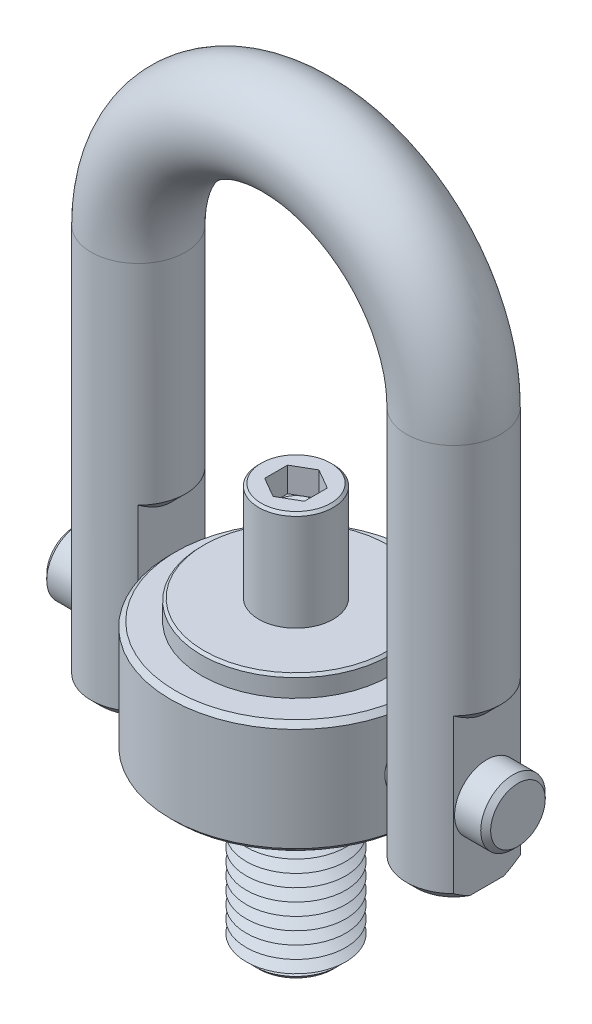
ISO-10303-21;
HEADER;
FILE_DESCRIPTION(('STEP AP214'),'2;1');
FILE_NAME('part.step','',(''),(''),'','','');
FILE_SCHEMA(('AUTOMOTIVE_DESIGN { 1 0 10303 214 1 1 1 1 }'));
ENDSEC;
DATA;
#1=APPLICATION_CONTEXT('core data for automotive mechanical design processes');
#2=APPLICATION_PROTOCOL_DEFINITION('international standard','automotive_design',2000,#1);
#3=PRODUCT_CONTEXT('',#1,'mechanical');
#4=PRODUCT('Part','Part','',(#3));
#5=PRODUCT_RELATED_PRODUCT_CATEGORY('part','',(#4));
#6=PRODUCT_DEFINITION_FORMATION('','',#4);
#7=PRODUCT_DEFINITION_CONTEXT('part definition',#1,'design');
#8=PRODUCT_DEFINITION('design','',#6,#7);
#9=PRODUCT_DEFINITION_SHAPE('','',#8);
#10=(LENGTH_UNIT() NAMED_UNIT(*) SI_UNIT(.MILLI.,.METRE.));
#11=(NAMED_UNIT(*) PLANE_ANGLE_UNIT() SI_UNIT($,.RADIAN.));
#12=(NAMED_UNIT(*) SI_UNIT($,.STERADIAN.) SOLID_ANGLE_UNIT());
#13=UNCERTAINTY_MEASURE_WITH_UNIT(LENGTH_MEASURE(1.E-05),#10,'distance_accuracy_value','');
#14=(GEOMETRIC_REPRESENTATION_CONTEXT(3) GLOBAL_UNCERTAINTY_ASSIGNED_CONTEXT((#13)) GLOBAL_UNIT_ASSIGNED_CONTEXT((#10,
#11,#12)) REPRESENTATION_CONTEXT('',''));
#15=CARTESIAN_POINT('',(0.,0.,0.));
#16=DIRECTION('',(0.,0.,1.));
#17=DIRECTION('',(1.,0.,0.));
#18=AXIS2_PLACEMENT_3D('',#15,#16,#17);
#19=CARTESIAN_POINT('',(44.7,0.,0.));
#20=DIRECTION('',(-1.,0.,0.));
#21=DIRECTION('',(0.,0.,1.));
#22=AXIS2_PLACEMENT_3D('',#19,#20,#21);
#23=CYLINDRICAL_SURFACE('',#22,6.5);
#24=CARTESIAN_POINT('',(-43.6999999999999,0.,0.));
#25=DIRECTION('',(1.,0.,0.));
#26=DIRECTION('',(0.,0.,-1.));
#27=AXIS2_PLACEMENT_3D('',#24,#25,#26);
#28=CIRCLE('',#27,6.5);
#29=CARTESIAN_POINT('',(-43.6999999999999,0.,6.5));
#30=VERTEX_POINT('',#29);
#31=EDGE_CURVE('P0_E25',#30,#30,#28,.T.);
#32=CARTESIAN_POINT('',(43.7000000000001,0.,0.));
#33=DIRECTION('',(1.,0.,0.));
#34=DIRECTION('',(0.,0.,-1.));
#35=AXIS2_PLACEMENT_3D('',#32,#33,#34);
#36=CIRCLE('',#35,6.5);
#37=CARTESIAN_POINT('',(43.7000000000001,0.,6.5));
#38=VERTEX_POINT('',#37);
#39=EDGE_CURVE('P0_E29',#38,#38,#36,.F.);
#40=CARTESIAN_POINT('',(-43.6999999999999,0.,6.5));
#41=CARTESIAN_POINT('',(-42.7895833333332,0.,6.5));
#42=CARTESIAN_POINT('',(-41.8791666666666,0.,6.5));
#43=CARTESIAN_POINT('',(-40.0583333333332,0.,6.5));
#44=CARTESIAN_POINT('',(-39.1479166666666,0.,6.5));
#45=CARTESIAN_POINT('',(-37.3270833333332,0.,6.5));
#46=CARTESIAN_POINT('',(-36.4166666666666,0.,6.5));
#47=CARTESIAN_POINT('',(-34.5958333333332,0.,6.5));
#48=CARTESIAN_POINT('',(-33.6854166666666,0.,6.5));
#49=CARTESIAN_POINT('',(-31.8645833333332,0.,6.5));
#50=CARTESIAN_POINT('',(-30.9541666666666,0.,6.5));
#51=CARTESIAN_POINT('',(-29.1333333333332,0.,6.5));
#52=CARTESIAN_POINT('',(-28.2229166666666,0.,6.5));
#53=CARTESIAN_POINT('',(-26.4020833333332,0.,6.5));
#54=CARTESIAN_POINT('',(-25.4916666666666,0.,6.5));
#55=CARTESIAN_POINT('',(-23.6708333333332,0.,6.5));
#56=CARTESIAN_POINT('',(-22.7604166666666,0.,6.5));
#57=CARTESIAN_POINT('',(-20.9395833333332,0.,6.5));
#58=CARTESIAN_POINT('',(-20.0291666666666,0.,6.5));
#59=CARTESIAN_POINT('',(-18.2083333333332,0.,6.5));
#60=CARTESIAN_POINT('',(-17.2979166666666,0.,6.5));
#61=CARTESIAN_POINT('',(-15.4770833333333,0.,6.5));
#62=CARTESIAN_POINT('',(-14.5666666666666,0.,6.5));
#63=CARTESIAN_POINT('',(-12.7458333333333,0.,6.5));
#64=CARTESIAN_POINT('',(-11.8354166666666,0.,6.5));
#65=CARTESIAN_POINT('',(-10.0145833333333,0.,6.5));
#66=CARTESIAN_POINT('',(-9.10416666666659,0.,6.5));
#67=CARTESIAN_POINT('',(-7.28333333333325,0.,6.5));
#68=CARTESIAN_POINT('',(-6.37291666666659,0.,6.5));
#69=CARTESIAN_POINT('',(-4.55208333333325,0.,6.5));
#70=CARTESIAN_POINT('',(-3.64166666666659,0.,6.5));
#71=CARTESIAN_POINT('',(-1.82083333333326,0.,6.5));
#72=CARTESIAN_POINT('',(-0.910416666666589,0.,6.5));
#73=CARTESIAN_POINT('',(0.910416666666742,0.,6.5));
#74=CARTESIAN_POINT('',(1.82083333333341,0.,6.5));
#75=CARTESIAN_POINT('',(3.64166666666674,0.,6.5));
#76=CARTESIAN_POINT('',(4.5520833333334,0.,6.5));
#77=CARTESIAN_POINT('',(6.37291666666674,0.,6.5));
#78=CARTESIAN_POINT('',(7.28333333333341,0.,6.5));
#79=CARTESIAN_POINT('',(9.10416666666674,0.,6.5));
#80=CARTESIAN_POINT('',(10.0145833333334,0.,6.5));
#81=CARTESIAN_POINT('',(11.8354166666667,0.,6.5));
#82=CARTESIAN_POINT('',(12.7458333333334,0.,6.5));
#83=CARTESIAN_POINT('',(14.5666666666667,0.,6.5));
#84=CARTESIAN_POINT('',(15.4770833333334,0.,6.5));
#85=CARTESIAN_POINT('',(17.2979166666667,0.,6.5));
#86=CARTESIAN_POINT('',(18.2083333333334,0.,6.5));
#87=CARTESIAN_POINT('',(20.0291666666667,0.,6.5));
#88=CARTESIAN_POINT('',(20.9395833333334,0.,6.5));
#89=CARTESIAN_POINT('',(22.7604166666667,0.,6.5));
#90=CARTESIAN_POINT('',(23.6708333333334,0.,6.5));
#91=CARTESIAN_POINT('',(25.4916666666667,0.,6.5));
#92=CARTESIAN_POINT('',(26.4020833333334,0.,6.5));
#93=CARTESIAN_POINT('',(28.2229166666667,0.,6.5));
#94=CARTESIAN_POINT('',(29.1333333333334,0.,6.5));
#95=CARTESIAN_POINT('',(30.9541666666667,0.,6.5));
#96=CARTESIAN_POINT('',(31.8645833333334,0.,6.5));
#97=CARTESIAN_POINT('',(33.6854166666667,0.,6.5));
#98=CARTESIAN_POINT('',(34.5958333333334,0.,6.5));
#99=CARTESIAN_POINT('',(36.4166666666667,0.,6.5));
#100=CARTESIAN_POINT('',(37.3270833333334,0.,6.5));
#101=CARTESIAN_POINT('',(39.1479166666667,0.,6.5));
#102=CARTESIAN_POINT('',(40.0583333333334,0.,6.5));
#103=CARTESIAN_POINT('',(41.8791666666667,0.,6.5));
#104=CARTESIAN_POINT('',(42.7895833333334,0.,6.5));
#105=CARTESIAN_POINT('',(43.7000000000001,0.,6.5));
#106=B_SPLINE_CURVE_WITH_KNOTS('',3,(#40,#41,#42,#43,#44,#45,#46,#47,#48,#49,#50,#51,#52,#53,
#54,#55,#56,#57,#58,#59,#60,#61,#62,#63,#64,#65,#66,#67,#68,#69,#70,#71,#72,#73,#74,#75,#76,#77,
#78,#79,#80,#81,#82,#83,#84,#85,#86,#87,#88,#89,#90,#91,#92,#93,#94,#95,#96,#97,#98,#99,#100,
#101,#102,#103,#104,#105),.UNSPECIFIED.,.F.,.F.,(4,2,2,2,2,2,2,2,2,2,2,2,2,2,2,2,2,2,2,2,2,2,2,
2,2,2,2,2,2,2,2,2,4),(0.,2.73125,5.4625,8.19375,10.925,13.65625,16.3875,19.11875,21.85,24.58125,
27.3125,30.04375,32.775,35.50625,38.2375,40.96875,43.7,46.43125,49.1625,51.89375,54.625,
57.35625,60.0875,62.81875,65.55,68.28125,71.0125,73.74375,76.475,79.20625,81.9375,84.66875,
87.4),.UNSPECIFIED.);
#107=EDGE_CURVE('P0_BSEAM14',#30,#38,#106,.T.);
#108=ORIENTED_EDGE('',*,*,#31,.T.);
#109=ORIENTED_EDGE('',*,*,#39,.T.);
#110=ORIENTED_EDGE('',*,*,#107,.T.);
#111=ORIENTED_EDGE('',*,*,#107,.F.);
#112=EDGE_LOOP('',(#108,#110,#109,#111));
#113=FACE_BOUND('',#112,.T.);
#114=ADVANCED_FACE('P0_F14',(#113),#23,.T.);
#115=CARTESIAN_POINT('',(44.7,0.,0.));
#116=DIRECTION('',(1.,0.,0.));
#117=DIRECTION('',(0.,0.,-1.));
#118=AXIS2_PLACEMENT_3D('',#115,#116,#117);
#119=PLANE('',#118);
#120=CARTESIAN_POINT('',(44.7,0.,0.));
#121=DIRECTION('',(1.,0.,0.));
#122=DIRECTION('',(0.,0.,-1.));
#123=AXIS2_PLACEMENT_3D('',#120,#121,#122);
#124=CIRCLE('',#123,5.50000000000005);
#125=CARTESIAN_POINT('',(44.7,0.,-5.50000000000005));
#126=VERTEX_POINT('',#125);
#127=EDGE_CURVE('P0_E10',#126,#126,#124,.T.);
#128=ORIENTED_EDGE('',*,*,#127,.T.);
#129=EDGE_LOOP('',(#128));
#130=FACE_BOUND('',#129,.T.);
#131=ADVANCED_FACE('P0_F46',(#130),#119,.T.);
#132=CARTESIAN_POINT('',(-44.7,0.,0.));
#133=DIRECTION('',(1.,0.,0.));
#134=DIRECTION('',(0.,0.,-1.));
#135=AXIS2_PLACEMENT_3D('',#132,#133,#134);
#136=PLANE('',#135);
#137=CARTESIAN_POINT('',(-44.7,0.,0.));
#138=DIRECTION('',(1.,0.,0.));
#139=DIRECTION('',(0.,0.,-1.));
#140=AXIS2_PLACEMENT_3D('',#137,#138,#139);
#141=CIRCLE('',#140,5.49999999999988);
#142=CARTESIAN_POINT('',(-44.7,0.,-5.49999999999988));
#143=VERTEX_POINT('',#142);
#144=EDGE_CURVE('P0_E21',#143,#143,#141,.F.);
#145=ORIENTED_EDGE('',*,*,#144,.T.);
#146=EDGE_LOOP('',(#145));
#147=FACE_BOUND('',#146,.T.);
#148=ADVANCED_FACE('P0_F43',(#147),#136,.F.);
#149=CARTESIAN_POINT('',(-43.6999999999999,0.,0.));
#150=DIRECTION('',(1.,0.,0.));
#151=DIRECTION('',(0.,0.,-1.));
#152=AXIS2_PLACEMENT_3D('',#149,#150,#151);
#153=CONICAL_SURFACE('',#152,6.5,0.785398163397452);
#154=ORIENTED_EDGE('',*,*,#144,.F.);
#155=EDGE_LOOP('',(#154));
#156=FACE_BOUND('',#155,.T.);
#157=ORIENTED_EDGE('',*,*,#31,.F.);
#158=EDGE_LOOP('',(#157));
#159=FACE_BOUND('',#158,.T.);
#160=ADVANCED_FACE('P0_F38',(#156,#159),#153,.T.);
#161=CARTESIAN_POINT('',(44.7,0.,0.));
#162=DIRECTION('',(-1.,0.,0.));
#163=DIRECTION('',(0.,0.,1.));
#164=AXIS2_PLACEMENT_3D('',#161,#162,#163);
#165=CONICAL_SURFACE('',#164,5.50000000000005,0.785398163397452);
#166=ORIENTED_EDGE('',*,*,#39,.F.);
#167=EDGE_LOOP('',(#166));
#168=FACE_BOUND('',#167,.T.);
#169=ORIENTED_EDGE('',*,*,#127,.F.);
#170=EDGE_LOOP('',(#169));
#171=FACE_BOUND('',#170,.T.);
#172=ADVANCED_FACE('P0_F16',(#168,#171),#165,.T.);
#173=CLOSED_SHELL('',(#114,#131,#148,#160,#172));
#174=MANIFOLD_SOLID_BREP('P0_B1',#173);
#175=CARTESIAN_POINT('',(31.7500000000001,-15.5,0.));
#176=DIRECTION('',(0.,-1.,0.));
#177=DIRECTION('',(0.,0.,1.));
#178=AXIS2_PLACEMENT_3D('',#175,#176,#177);
#179=PLANE('',#178);
#180=DIRECTION('',(0.,0.,-1.));
#181=VECTOR('',#180,1.);
#182=CARTESIAN_POINT('',(25.0651290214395,-15.5,6.75));
#183=LINE('',#182,#181);
#184=CARTESIAN_POINT('',(25.0651290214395,-15.5,3.40036762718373));
#185=VERTEX_POINT('',#184);
#186=CARTESIAN_POINT('',(25.0651290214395,-15.5,-3.40036762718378));
#187=VERTEX_POINT('',#186);
#188=EDGE_CURVE('P1_E132',#185,#187,#183,.T.);
#189=ORIENTED_EDGE('',*,*,#188,.T.);
#190=CARTESIAN_POINT('',(31.7500000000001,-15.5,0.));
#191=DIRECTION('',(0.,-1.,0.));
#192=DIRECTION('',(1.,0.,0.));
#193=AXIS2_PLACEMENT_3D('',#190,#191,#192);
#194=CIRCLE('',#193,7.50000000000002);
#195=CARTESIAN_POINT('',(38.4348709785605,-15.5,-3.40036762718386));
#196=VERTEX_POINT('',#195);
#197=EDGE_CURVE('P1_E192',#187,#196,#194,.T.);
#198=ORIENTED_EDGE('',*,*,#197,.T.);
#199=DIRECTION('',(0.,0.,1.));
#200=VECTOR('',#199,1.);
#201=CARTESIAN_POINT('',(38.4348709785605,-15.5,6.75));
#202=LINE('',#201,#200);
#203=CARTESIAN_POINT('',(38.4348709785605,-15.5,3.40036762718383));
#204=VERTEX_POINT('',#203);
#205=EDGE_CURVE('P1_E315',#196,#204,#202,.T.);
#206=ORIENTED_EDGE('',*,*,#205,.T.);
#207=CARTESIAN_POINT('',(31.7500000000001,-15.5,0.));
#208=DIRECTION('',(0.,-1.,0.));
#209=DIRECTION('',(1.,0.,0.));
#210=AXIS2_PLACEMENT_3D('',#207,#208,#209);
#211=CIRCLE('',#210,7.5);
#212=CARTESIAN_POINT('',(31.7500000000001,-15.5,7.49999999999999));
#213=VERTEX_POINT('',#212);
#214=EDGE_CURVE('P1_E370',#204,#213,#211,.T.);
#215=ORIENTED_EDGE('',*,*,#214,.T.);
#216=CARTESIAN_POINT('',(31.7500000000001,-15.5,0.));
#217=DIRECTION('',(0.,-1.,0.));
#218=DIRECTION('',(1.,0.,0.));
#219=AXIS2_PLACEMENT_3D('',#216,#217,#218);
#220=CIRCLE('',#219,7.49999999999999);
#221=EDGE_CURVE('P1_E369',#213,#185,#220,.T.);
#222=ORIENTED_EDGE('',*,*,#221,.T.);
#223=EDGE_LOOP('',(#189,#198,#206,#215,#222));
#224=FACE_BOUND('',#223,.T.);
#225=ADVANCED_FACE('P1_F16',(#224),#179,.T.);
#226=CARTESIAN_POINT('',(31.75,64.65,0.));
#227=DIRECTION('',(0.,-1.,0.));
#228=DIRECTION('',(1.,0.,0.));
#229=AXIS2_PLACEMENT_3D('',#226,#227,#228);
#230=CYLINDRICAL_SURFACE('',#229,9.5);
#231=CARTESIAN_POINT('',(31.75,64.65,0.));
#232=DIRECTION('',(0.,-1.,0.));
#233=DIRECTION('',(0.,0.,1.));
#234=AXIS2_PLACEMENT_3D('',#231,#232,#233);
#235=CIRCLE('',#234,9.5);
#236=CARTESIAN_POINT('',(41.25,64.65,0.));
#237=VERTEX_POINT('',#236);
#238=EDGE_CURVE('P1_E143',#237,#237,#235,.T.);
#239=ORIENTED_EDGE('',*,*,#238,.T.);
#240=EDGE_LOOP('',(#239));
#241=FACE_BOUND('',#240,.T.);
#242=DIRECTION('',(0.,-1.,0.));
#243=VECTOR('',#242,1.);
#244=CARTESIAN_POINT('',(38.4348709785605,14.5,-6.75));
#245=LINE('',#244,#243);
#246=CARTESIAN_POINT('',(38.4348709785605,17.5,-6.74999999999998));
#247=VERTEX_POINT('',#246);
#248=CARTESIAN_POINT('',(38.4348709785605,-13.5,-6.75));
#249=VERTEX_POINT('',#248);
#250=EDGE_CURVE('P1_E328',#247,#249,#245,.T.);
#251=ORIENTED_EDGE('',*,*,#250,.T.);
#252=CARTESIAN_POINT('',(31.7500000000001,-13.5,0.));
#253=DIRECTION('',(0.,-1.,0.));
#254=DIRECTION('',(0.,0.,-1.));
#255=AXIS2_PLACEMENT_3D('',#252,#253,#254);
#256=CIRCLE('',#255,9.5);
#257=CARTESIAN_POINT('',(25.0651290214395,-13.5,-6.75));
#258=VERTEX_POINT('',#257);
#259=EDGE_CURVE('P1_E128',#249,#258,#256,.F.);
#260=ORIENTED_EDGE('',*,*,#259,.T.);
#261=DIRECTION('',(0.,-1.,0.));
#262=VECTOR('',#261,1.);
#263=CARTESIAN_POINT('',(25.0651290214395,19.5,-6.75));
#264=LINE('',#263,#262);
#265=CARTESIAN_POINT('',(25.0651290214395,22.5,-6.75));
#266=VERTEX_POINT('',#265);
#267=EDGE_CURVE('P1_E120',#266,#258,#264,.T.);
#268=ORIENTED_EDGE('',*,*,#267,.F.);
#269=CARTESIAN_POINT('',(31.75,22.5000000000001,0.));
#270=DIRECTION('',(0.,-1.,0.));
#271=DIRECTION('',(1.,0.,0.));
#272=AXIS2_PLACEMENT_3D('',#269,#270,#271);
#273=CIRCLE('',#272,9.5);
#274=CARTESIAN_POINT('',(25.0651290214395,22.5,6.74999999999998));
#275=VERTEX_POINT('',#274);
#276=EDGE_CURVE('P1_E126',#266,#275,#273,.F.);
#277=ORIENTED_EDGE('',*,*,#276,.T.);
#278=DIRECTION('',(0.,-1.,0.));
#279=VECTOR('',#278,1.);
#280=CARTESIAN_POINT('',(25.0651290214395,19.5,6.75));
#281=LINE('',#280,#279);
#282=CARTESIAN_POINT('',(25.0651290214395,-13.5,6.75));
#283=VERTEX_POINT('',#282);
#284=EDGE_CURVE('P1_E131',#275,#283,#281,.T.);
#285=ORIENTED_EDGE('',*,*,#284,.T.);
#286=CARTESIAN_POINT('',(31.7500000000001,-13.5,0.));
#287=DIRECTION('',(0.,-1.,0.));
#288=DIRECTION('',(0.,0.,-1.));
#289=AXIS2_PLACEMENT_3D('',#286,#287,#288);
#290=CIRCLE('',#289,9.5);
#291=CARTESIAN_POINT('',(31.7500000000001,-13.5,9.5));
#292=VERTEX_POINT('',#291);
#293=EDGE_CURVE('P1_E530',#283,#292,#290,.F.);
#294=ORIENTED_EDGE('',*,*,#293,.T.);
#295=CARTESIAN_POINT('',(31.7500000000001,-13.5,0.));
#296=DIRECTION('',(0.,-1.,0.));
#297=DIRECTION('',(0.,0.,-1.));
#298=AXIS2_PLACEMENT_3D('',#295,#296,#297);
#299=CIRCLE('',#298,9.5);
#300=CARTESIAN_POINT('',(38.4348709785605,-13.5,6.75));
#301=VERTEX_POINT('',#300);
#302=EDGE_CURVE('P1_E528',#292,#301,#299,.F.);
#303=ORIENTED_EDGE('',*,*,#302,.T.);
#304=DIRECTION('',(0.,-1.,0.));
#305=VECTOR('',#304,1.);
#306=CARTESIAN_POINT('',(38.4348709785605,14.5,6.75));
#307=LINE('',#306,#305);
#308=CARTESIAN_POINT('',(38.4348709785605,17.5,6.75));
#309=VERTEX_POINT('',#308);
#310=EDGE_CURVE('P1_E327',#309,#301,#307,.T.);
#311=ORIENTED_EDGE('',*,*,#310,.F.);
#312=CARTESIAN_POINT('',(31.75,17.5,0.));
#313=DIRECTION('',(0.,-1.,0.));
#314=DIRECTION('',(0.,0.,-1.));
#315=AXIS2_PLACEMENT_3D('',#312,#313,#314);
#316=CIRCLE('',#315,9.5);
#317=EDGE_CURVE('P1_E142',#309,#247,#316,.F.);
#318=ORIENTED_EDGE('',*,*,#317,.T.);
#319=EDGE_LOOP('',(#251,#260,#268,#277,#285,#294,#303,#311,#318));
#320=FACE_BOUND('',#319,.T.);
#321=ADVANCED_FACE('P1_F123',(#241,#320),#230,.T.);
#322=CARTESIAN_POINT('',(-31.7500000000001,-15.5,0.));
#323=DIRECTION('',(0.,1.,0.));
#324=DIRECTION('',(0.,0.,1.));
#325=AXIS2_PLACEMENT_3D('',#322,#323,#324);
#326=PLANE('',#325);
#327=DIRECTION('',(0.,0.,1.));
#328=VECTOR('',#327,1.);
#329=CARTESIAN_POINT('',(-38.4348709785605,-15.5,6.75));
#330=LINE('',#329,#328);
#331=CARTESIAN_POINT('',(-38.4348709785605,-15.5,-3.40036762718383));
#332=VERTEX_POINT('',#331);
#333=CARTESIAN_POINT('',(-38.4348709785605,-15.5,3.40036762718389));
#334=VERTEX_POINT('',#333);
#335=EDGE_CURVE('P1_E334',#332,#334,#330,.T.);
#336=ORIENTED_EDGE('',*,*,#335,.F.);
#337=CARTESIAN_POINT('',(-31.7500000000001,-15.5,0.));
#338=DIRECTION('',(0.,1.,0.));
#339=DIRECTION('',(0.,0.,1.));
#340=AXIS2_PLACEMENT_3D('',#337,#338,#339);
#341=CIRCLE('',#340,7.50000000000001);
#342=CARTESIAN_POINT('',(-25.0651290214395,-15.5,-3.40036762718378));
#343=VERTEX_POINT('',#342);
#344=EDGE_CURVE('P1_E40',#332,#343,#341,.F.);
#345=ORIENTED_EDGE('',*,*,#344,.T.);
#346=DIRECTION('',(0.,0.,-1.));
#347=VECTOR('',#346,1.);
#348=CARTESIAN_POINT('',(-25.0651290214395,-15.5,6.75));
#349=LINE('',#348,#347);
#350=CARTESIAN_POINT('',(-25.0651290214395,-15.5,3.40036762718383));
#351=VERTEX_POINT('',#350);
#352=EDGE_CURVE('P1_E303',#351,#343,#349,.T.);
#353=ORIENTED_EDGE('',*,*,#352,.F.);
#354=CARTESIAN_POINT('',(-31.7500000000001,-15.5,0.));
#355=DIRECTION('',(0.,1.,0.));
#356=DIRECTION('',(0.,0.,1.));
#357=AXIS2_PLACEMENT_3D('',#354,#355,#356);
#358=CIRCLE('',#357,7.50000000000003);
#359=CARTESIAN_POINT('',(-31.7500000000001,-15.5,7.50000000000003));
#360=VERTEX_POINT('',#359);
#361=EDGE_CURVE('P1_E34',#351,#360,#358,.F.);
#362=ORIENTED_EDGE('',*,*,#361,.T.);
#363=CARTESIAN_POINT('',(-31.7500000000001,-15.5,0.));
#364=DIRECTION('',(0.,1.,0.));
#365=DIRECTION('',(0.,0.,1.));
#366=AXIS2_PLACEMENT_3D('',#363,#364,#365);
#367=CIRCLE('',#366,7.50000000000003);
#368=EDGE_CURVE('P1_E298',#360,#334,#367,.F.);
#369=ORIENTED_EDGE('',*,*,#368,.T.);
#370=EDGE_LOOP('',(#336,#345,#353,#362,#369));
#371=FACE_BOUND('',#370,.T.);
#372=ADVANCED_FACE('P1_F239',(#371),#326,.F.);
#373=CARTESIAN_POINT('',(-31.7500000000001,-15.5,0.));
#374=DIRECTION('',(0.,1.,0.));
#375=DIRECTION('',(-1.,0.,0.));
#376=AXIS2_PLACEMENT_3D('',#373,#374,#375);
#377=CYLINDRICAL_SURFACE('',#376,9.5);
#378=DIRECTION('',(0.,-1.,0.));
#379=VECTOR('',#378,1.);
#380=CARTESIAN_POINT('',(-25.0651290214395,19.5,-6.75));
#381=LINE('',#380,#379);
#382=CARTESIAN_POINT('',(-25.0651290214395,22.5,-6.74999999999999));
#383=VERTEX_POINT('',#382);
#384=CARTESIAN_POINT('',(-25.0651290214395,-13.5,-6.75));
#385=VERTEX_POINT('',#384);
#386=EDGE_CURVE('P1_E340',#383,#385,#381,.T.);
#387=ORIENTED_EDGE('',*,*,#386,.T.);
#388=CARTESIAN_POINT('',(-31.7500000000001,-13.5,0.));
#389=DIRECTION('',(0.,1.,0.));
#390=DIRECTION('',(0.,0.,1.));
#391=AXIS2_PLACEMENT_3D('',#388,#389,#390);
#392=CIRCLE('',#391,9.5);
#393=CARTESIAN_POINT('',(-38.4348709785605,-13.5,-6.75));
#394=VERTEX_POINT('',#393);
#395=EDGE_CURVE('P1_E287',#385,#394,#392,.T.);
#396=ORIENTED_EDGE('',*,*,#395,.T.);
#397=DIRECTION('',(0.,-1.,0.));
#398=VECTOR('',#397,1.);
#399=CARTESIAN_POINT('',(-38.4348709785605,14.5,-6.75));
#400=LINE('',#399,#398);
#401=CARTESIAN_POINT('',(-38.4348709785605,17.5,-6.74999999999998));
#402=VERTEX_POINT('',#401);
#403=EDGE_CURVE('P1_E337',#402,#394,#400,.T.);
#404=ORIENTED_EDGE('',*,*,#403,.F.);
#405=CARTESIAN_POINT('',(-31.75,17.5,0.));
#406=DIRECTION('',(0.,-1.,0.));
#407=DIRECTION('',(0.,0.,-1.));
#408=AXIS2_PLACEMENT_3D('',#405,#406,#407);
#409=CIRCLE('',#408,9.5);
#410=CARTESIAN_POINT('',(-38.4348709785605,17.5,6.74999999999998));
#411=VERTEX_POINT('',#410);
#412=EDGE_CURVE('P1_E146',#402,#411,#409,.F.);
#413=ORIENTED_EDGE('',*,*,#412,.T.);
#414=DIRECTION('',(0.,-1.,0.));
#415=VECTOR('',#414,1.);
#416=CARTESIAN_POINT('',(-38.4348709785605,14.5,6.75));
#417=LINE('',#416,#415);
#418=CARTESIAN_POINT('',(-38.4348709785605,-13.5,6.75));
#419=VERTEX_POINT('',#418);
#420=EDGE_CURVE('P1_E308',#411,#419,#417,.T.);
#421=ORIENTED_EDGE('',*,*,#420,.T.);
#422=CARTESIAN_POINT('',(-31.7500000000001,-13.5,0.));
#423=DIRECTION('',(0.,1.,0.));
#424=DIRECTION('',(0.,0.,1.));
#425=AXIS2_PLACEMENT_3D('',#422,#423,#424);
#426=CIRCLE('',#425,9.5);
#427=CARTESIAN_POINT('',(-31.7500000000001,-13.5,9.5));
#428=VERTEX_POINT('',#427);
#429=EDGE_CURVE('P1_E284',#419,#428,#426,.T.);
#430=ORIENTED_EDGE('',*,*,#429,.T.);
#431=CARTESIAN_POINT('',(-31.7500000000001,-13.5,0.));
#432=DIRECTION('',(0.,1.,0.));
#433=DIRECTION('',(0.,0.,1.));
#434=AXIS2_PLACEMENT_3D('',#431,#432,#433);
#435=CIRCLE('',#434,9.5);
#436=CARTESIAN_POINT('',(-25.0651290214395,-13.5,6.75));
#437=VERTEX_POINT('',#436);
#438=EDGE_CURVE('P1_E277',#428,#437,#435,.T.);
#439=ORIENTED_EDGE('',*,*,#438,.T.);
#440=DIRECTION('',(0.,-1.,0.));
#441=VECTOR('',#440,1.);
#442=CARTESIAN_POINT('',(-25.0651290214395,19.5,6.75));
#443=LINE('',#442,#441);
#444=CARTESIAN_POINT('',(-25.0651290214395,22.5,6.74999999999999));
#445=VERTEX_POINT('',#444);
#446=EDGE_CURVE('P1_E305',#445,#437,#443,.T.);
#447=ORIENTED_EDGE('',*,*,#446,.F.);
#448=CARTESIAN_POINT('',(-31.75,22.5,0.));
#449=DIRECTION('',(0.,-1.,0.));
#450=DIRECTION('',(1.,0.,0.));
#451=AXIS2_PLACEMENT_3D('',#448,#449,#450);
#452=CIRCLE('',#451,9.5);
#453=EDGE_CURVE('P1_E155',#445,#383,#452,.F.);
#454=ORIENTED_EDGE('',*,*,#453,.T.);
#455=EDGE_LOOP('',(#387,#396,#404,#413,#421,#430,#439,#447,#454));
#456=FACE_BOUND('',#455,.T.);
#457=CARTESIAN_POINT('',(-31.75,64.65,0.));
#458=DIRECTION('',(0.,1.,0.));
#459=DIRECTION('',(0.,0.,1.));
#460=AXIS2_PLACEMENT_3D('',#457,#458,#459);
#461=CIRCLE('',#460,9.5);
#462=CARTESIAN_POINT('',(-41.2500000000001,64.65,0.));
#463=VERTEX_POINT('',#462);
#464=EDGE_CURVE('P1_E149',#463,#463,#461,.T.);
#465=ORIENTED_EDGE('',*,*,#464,.F.);
#466=EDGE_LOOP('',(#465));
#467=FACE_BOUND('',#466,.T.);
#468=ADVANCED_FACE('P1_F241',(#456,#467),#377,.T.);
#469=CARTESIAN_POINT('',(0.,64.65,0.));
#470=DIRECTION('',(0.,0.,-1.));
#471=DIRECTION('',(-1.,0.,0.));
#472=AXIS2_PLACEMENT_3D('',#469,#470,#471);
#473=TOROIDAL_SURFACE('',#472,31.75,9.5);
#474=CARTESIAN_POINT('',(0.,64.65,0.));
#475=DIRECTION('',(0.,0.,-1.));
#476=DIRECTION('',(-1.,0.,0.));
#477=AXIS2_PLACEMENT_3D('',#474,#475,#476);
#478=CIRCLE('',#477,41.25);
#479=EDGE_CURVE('',#463,#237,#478,.T.);
#480=ORIENTED_EDGE('',*,*,#464,.T.);
#481=ORIENTED_EDGE('',*,*,#238,.F.);
#482=ORIENTED_EDGE('',*,*,#479,.T.);
#483=ORIENTED_EDGE('',*,*,#479,.F.);
#484=EDGE_LOOP('',(#480,#482,#481,#483));
#485=FACE_BOUND('',#484,.T.);
#486=ADVANCED_FACE('P1_F237',(#485),#473,.T.);
#487=CARTESIAN_POINT('',(-25.0651290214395,19.5,6.75));
#488=DIRECTION('',(-1.,0.,0.));
#489=DIRECTION('',(0.,0.,1.));
#490=AXIS2_PLACEMENT_3D('',#487,#488,#489);
#491=PLANE('',#490);
#492=CARTESIAN_POINT('',(-25.0651290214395,0.,0.));
#493=DIRECTION('',(-1.,0.,0.));
#494=DIRECTION('',(0.,0.,1.));
#495=AXIS2_PLACEMENT_3D('',#492,#493,#494);
#496=CIRCLE('',#495,6.5);
#497=CARTESIAN_POINT('',(-25.0651290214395,0.,-6.5));
#498=VERTEX_POINT('',#497);
#499=EDGE_CURVE('P1_E313',#498,#498,#496,.T.);
#500=ORIENTED_EDGE('',*,*,#499,.T.);
#501=EDGE_LOOP('',(#500));
#502=FACE_BOUND('',#501,.T.);
#503=ORIENTED_EDGE('',*,*,#352,.T.);
#504=CARTESIAN_POINT('',(-25.0651290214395,-15.5,-3.40036762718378));
#505=CARTESIAN_POINT('',(-25.0651290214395,-15.4326360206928,-3.54890812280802));
#506=CARTESIAN_POINT('',(-25.0651290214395,-15.3624060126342,-3.69611737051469));
#507=CARTESIAN_POINT('',(-25.0651290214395,-15.2169677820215,-3.98800343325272));
#508=CARTESIAN_POINT('',(-25.0651290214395,-15.1417611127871,-4.1326810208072));
#509=CARTESIAN_POINT('',(-25.0651290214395,-14.9872482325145,-4.41941489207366));
#510=CARTESIAN_POINT('',(-25.0651290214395,-14.9079512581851,-4.56147617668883));
#511=CARTESIAN_POINT('',(-25.0651290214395,-14.7456881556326,-4.84349614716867));
#512=CARTESIAN_POINT('',(-25.0651290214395,-14.6627217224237,-4.98345465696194));
#513=CARTESIAN_POINT('',(-25.0651290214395,-14.4092517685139,-5.40020250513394));
#514=CARTESIAN_POINT('',(-25.0651290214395,-14.2340315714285,-5.67413071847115));
#515=CARTESIAN_POINT('',(-25.0651290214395,-13.9639304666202,-6.08056483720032));
#516=CARTESIAN_POINT('',(-25.0651290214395,-13.8725771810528,-6.21545032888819));
#517=CARTESIAN_POINT('',(-25.0651290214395,-13.6877855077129,-6.48377107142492));
#518=CARTESIAN_POINT('',(-25.0651290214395,-13.5943472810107,-6.6172064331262));
#519=CARTESIAN_POINT('',(-25.0651290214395,-13.5,-6.74999999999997));
#520=B_SPLINE_CURVE_WITH_KNOTS('',3,(#504,#505,#506,#507,#508,#509,#510,#511,#512,#513,#514,
#515,#516,#517,#518,#519),.UNSPECIFIED.,.F.,.F.,(4,2,2,2,2,2,2,4),(0.,0.489232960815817,
0.978313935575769,1.46633508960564,1.9543968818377,2.92960959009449,3.41832609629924,
3.90700497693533),.UNSPECIFIED.);
#521=EDGE_CURVE('P1_E11',#343,#385,#520,.T.);
#522=ORIENTED_EDGE('',*,*,#521,.T.);
#523=ORIENTED_EDGE('',*,*,#386,.F.);
#524=CARTESIAN_POINT('',(-25.0651290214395,22.5,-6.74999999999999));
#525=CARTESIAN_POINT('',(-25.0651290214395,22.3669041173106,-6.56261989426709));
#526=CARTESIAN_POINT('',(-25.0651290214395,22.2355640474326,-6.37396361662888));
#527=CARTESIAN_POINT('',(-25.0651290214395,21.9772356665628,-5.99357751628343));
#528=CARTESIAN_POINT('',(-25.0651290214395,21.8502493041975,-5.80184637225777));
#529=CARTESIAN_POINT('',(-25.0651290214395,21.6000412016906,-5.41254799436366));
#530=CARTESIAN_POINT('',(-25.0651290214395,21.4768859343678,-5.21493783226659));
#531=CARTESIAN_POINT('',(-25.0651290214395,21.237291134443,-4.81570098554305));
#532=CARTESIAN_POINT('',(-25.0651290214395,21.1208508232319,-4.6140747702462));
#533=CARTESIAN_POINT('',(-25.0651290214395,20.8927401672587,-4.19984179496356));
#534=CARTESIAN_POINT('',(-25.0651290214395,20.7813333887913,-3.98708890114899));
#535=CARTESIAN_POINT('',(-25.0651290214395,20.5695366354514,-3.55606763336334));
#536=CARTESIAN_POINT('',(-25.0651290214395,20.4691488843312,-3.3377981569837));
#537=CARTESIAN_POINT('',(-25.0651290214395,20.2826704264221,-2.89647598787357));
#538=CARTESIAN_POINT('',(-25.0651290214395,20.1965099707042,-2.67345307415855));
#539=CARTESIAN_POINT('',(-25.0651290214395,20.0411819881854,-2.22163348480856));
#540=CARTESIAN_POINT('',(-25.0651290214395,19.9720031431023,-1.99284076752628));
#541=CARTESIAN_POINT('',(-25.0651290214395,19.8640140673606,-1.56901241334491));
#542=CARTESIAN_POINT('',(-25.0651290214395,19.822050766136,-1.3747852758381));
#543=CARTESIAN_POINT('',(-25.0651290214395,19.7540735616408,-0.983424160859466));
#544=CARTESIAN_POINT('',(-25.0651290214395,19.7280666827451,-0.786288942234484));
#545=CARTESIAN_POINT('',(-25.0651290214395,19.6935223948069,-0.392293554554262));
#546=CARTESIAN_POINT('',(-25.0651290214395,19.6848277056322,-0.195447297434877));
#547=CARTESIAN_POINT('',(-25.0651290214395,19.6849145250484,0.198159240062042));
#548=CARTESIAN_POINT('',(-25.0651290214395,19.6936863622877,0.39491950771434));
#549=CARTESIAN_POINT('',(-25.0651290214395,19.7189963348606,0.682475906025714));
#550=CARTESIAN_POINT('',(-25.0651290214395,19.7289112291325,0.773903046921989));
#551=CARTESIAN_POINT('',(-25.0651290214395,19.7523224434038,0.95631697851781));
#552=CARTESIAN_POINT('',(-25.0651290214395,19.7658195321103,1.04730367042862));
#553=CARTESIAN_POINT('',(-25.0651290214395,19.8217601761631,1.38057959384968));
#554=CARTESIAN_POINT('',(-25.0651290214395,19.8748342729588,1.62114853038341));
#555=CARTESIAN_POINT('',(-25.0651290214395,20.0022082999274,2.09668833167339));
#556=CARTESIAN_POINT('',(-25.0651290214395,20.0765297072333,2.33165327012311));
#557=CARTESIAN_POINT('',(-25.0651290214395,20.243139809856,2.79698571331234));
#558=CARTESIAN_POINT('',(-25.0651290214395,20.3355556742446,3.02730715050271));
#559=CARTESIAN_POINT('',(-25.0651290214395,20.5344333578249,3.48165388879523));
#560=CARTESIAN_POINT('',(-25.0651290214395,20.6408915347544,3.70568080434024));
#561=CARTESIAN_POINT('',(-25.0651290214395,20.8792671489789,4.17631933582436));
#562=CARTESIAN_POINT('',(-25.0651290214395,21.0126995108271,4.42215819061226));
#563=CARTESIAN_POINT('',(-25.0651290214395,21.2905109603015,4.90761521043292));
#564=CARTESIAN_POINT('',(-25.0651290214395,21.4348935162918,5.14723137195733));
#565=CARTESIAN_POINT('',(-25.0651290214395,21.7292865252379,5.61655464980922));
#566=CARTESIAN_POINT('',(-25.0651290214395,21.879135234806,5.84636371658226));
#567=CARTESIAN_POINT('',(-25.0651290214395,22.1086748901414,6.18769077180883));
#568=CARTESIAN_POINT('',(-25.0651290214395,22.1859449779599,6.30084946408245));
#569=CARTESIAN_POINT('',(-25.0651290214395,22.3419289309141,6.52615765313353));
#570=CARTESIAN_POINT('',(-25.0651290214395,22.4206427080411,6.63830721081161));
#571=CARTESIAN_POINT('',(-25.0651290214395,22.5,6.74999999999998));
#572=B_SPLINE_CURVE_WITH_KNOTS('',3,(#524,#525,#526,#527,#528,#529,#530,#531,#532,#533,#534,
#535,#536,#537,#538,#539,#540,#541,#542,#543,#544,#545,#546,#547,#548,#549,#550,#551,#552,#553,
#554,#555,#556,#557,#558,#559,#560,#561,#562,#563,#564,#565,#566,#567,#568,#569,#570,#571),
.UNSPECIFIED.,.F.,.F.,(4,2,2,2,2,2,2,2,2,2,2,2,2,2,2,2,2,2,2,2,2,2,2,4),(0.,0.689541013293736,
1.37938672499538,2.07781305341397,2.77615823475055,3.4963726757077,4.21673219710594,
4.93344799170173,5.64968478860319,6.24522531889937,6.84102783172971,7.43139236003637,
8.02143008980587,8.29725969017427,8.57314852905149,9.31093092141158,10.0494617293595,
10.7933824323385,11.5371105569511,12.3758890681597,13.2149343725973,14.0378352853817,
14.4488982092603,14.8599361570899),.UNSPECIFIED.);
#573=EDGE_CURVE('P1_E138',#383,#445,#572,.T.);
#574=ORIENTED_EDGE('',*,*,#573,.T.);
#575=ORIENTED_EDGE('',*,*,#446,.T.);
#576=CARTESIAN_POINT('',(-25.0651290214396,-13.5,6.74999999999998));
#577=CARTESIAN_POINT('',(-25.0651290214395,-13.5943472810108,6.61720643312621));
#578=CARTESIAN_POINT('',(-25.0651290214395,-13.6877855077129,6.48377107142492));
#579=CARTESIAN_POINT('',(-25.0651290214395,-13.8725771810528,6.21545032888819));
#580=CARTESIAN_POINT('',(-25.0651290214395,-13.9639304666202,6.08056483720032));
#581=CARTESIAN_POINT('',(-25.0651290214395,-14.2340315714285,5.67413071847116));
#582=CARTESIAN_POINT('',(-25.0651290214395,-14.4092517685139,5.40020250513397));
#583=CARTESIAN_POINT('',(-25.0651290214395,-14.6627217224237,4.98345465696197));
#584=CARTESIAN_POINT('',(-25.0651290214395,-14.7456881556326,4.8434961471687));
#585=CARTESIAN_POINT('',(-25.0651290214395,-14.9079512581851,4.56147617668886));
#586=CARTESIAN_POINT('',(-25.0651290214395,-14.9872482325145,4.4194148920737));
#587=CARTESIAN_POINT('',(-25.0651290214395,-15.1417611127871,4.13268102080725));
#588=CARTESIAN_POINT('',(-25.0651290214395,-15.2169677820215,3.98800343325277));
#589=CARTESIAN_POINT('',(-25.0651290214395,-15.3624060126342,3.69611737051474));
#590=CARTESIAN_POINT('',(-25.0651290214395,-15.4326360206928,3.54890812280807));
#591=CARTESIAN_POINT('',(-25.0651290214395,-15.5,3.40036762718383));
#592=B_SPLINE_CURVE_WITH_KNOTS('',3,(#576,#577,#578,#579,#580,#581,#582,#583,#584,#585,#586,
#587,#588,#589,#590,#591),.UNSPECIFIED.,.F.,.F.,(4,2,2,2,2,2,2,4),(0.,0.488678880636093,
0.977395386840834,1.95260809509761,2.44066988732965,2.92869104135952,3.41777201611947,
3.90700497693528),.UNSPECIFIED.);
#593=EDGE_CURVE('P1_E26',#437,#351,#592,.T.);
#594=ORIENTED_EDGE('',*,*,#593,.T.);
#595=EDGE_LOOP('',(#503,#522,#523,#574,#575,#594));
#596=FACE_BOUND('',#595,.T.);
#597=ADVANCED_FACE('P1_F232',(#502,#596),#491,.F.);
#598=CARTESIAN_POINT('',(-38.4348709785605,14.5,6.75));
#599=DIRECTION('',(1.,0.,0.));
#600=DIRECTION('',(0.,0.,-1.));
#601=AXIS2_PLACEMENT_3D('',#598,#599,#600);
#602=PLANE('',#601);
#603=CARTESIAN_POINT('',(-38.4348709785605,0.,0.));
#604=DIRECTION('',(1.,0.,0.));
#605=DIRECTION('',(0.,0.,-1.));
#606=AXIS2_PLACEMENT_3D('',#603,#604,#605);
#607=CIRCLE('',#606,6.5);
#608=CARTESIAN_POINT('',(-38.4348709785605,0.,-6.5));
#609=VERTEX_POINT('',#608);
#610=EDGE_CURVE('P1_E321',#609,#609,#607,.F.);
#611=ORIENTED_EDGE('',*,*,#610,.F.);
#612=EDGE_LOOP('',(#611));
#613=FACE_BOUND('',#612,.T.);
#614=ORIENTED_EDGE('',*,*,#403,.T.);
#615=CARTESIAN_POINT('',(-38.4348709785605,-13.5,-6.74999999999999));
#616=CARTESIAN_POINT('',(-38.4348709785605,-13.5943472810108,-6.61720643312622));
#617=CARTESIAN_POINT('',(-38.4348709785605,-13.6877855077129,-6.48377107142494));
#618=CARTESIAN_POINT('',(-38.4348709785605,-13.8725771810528,-6.21545032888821));
#619=CARTESIAN_POINT('',(-38.4348709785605,-13.9639304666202,-6.08056483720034));
#620=CARTESIAN_POINT('',(-38.4348709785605,-14.2340315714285,-5.67413071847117));
#621=CARTESIAN_POINT('',(-38.4348709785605,-14.4092517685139,-5.40020250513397));
#622=CARTESIAN_POINT('',(-38.4348709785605,-14.6627217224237,-4.98345465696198));
#623=CARTESIAN_POINT('',(-38.4348709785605,-14.7456881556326,-4.8434961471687));
#624=CARTESIAN_POINT('',(-38.4348709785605,-14.9079512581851,-4.56147617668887));
#625=CARTESIAN_POINT('',(-38.4348709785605,-14.9872482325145,-4.4194148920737));
#626=CARTESIAN_POINT('',(-38.4348709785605,-15.1417611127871,-4.13268102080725));
#627=CARTESIAN_POINT('',(-38.4348709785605,-15.2169677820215,-3.98800343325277));
#628=CARTESIAN_POINT('',(-38.4348709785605,-15.3624060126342,-3.69611737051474));
#629=CARTESIAN_POINT('',(-38.4348709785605,-15.4326360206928,-3.54890812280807));
#630=CARTESIAN_POINT('',(-38.4348709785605,-15.5,-3.40036762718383));
#631=B_SPLINE_CURVE_WITH_KNOTS('',3,(#615,#616,#617,#618,#619,#620,#621,#622,#623,#624,#625,
#626,#627,#628,#629,#630),.UNSPECIFIED.,.F.,.F.,(4,2,2,2,2,2,2,4),(0.,0.488678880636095,
0.977395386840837,1.95260809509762,2.44066988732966,2.92869104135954,3.41777201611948,
3.9070049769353),.UNSPECIFIED.);
#632=EDGE_CURVE('P1_E216',#394,#332,#631,.T.);
#633=ORIENTED_EDGE('',*,*,#632,.T.);
#634=ORIENTED_EDGE('',*,*,#335,.T.);
#635=CARTESIAN_POINT('',(-38.4348709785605,-15.5,3.40036762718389));
#636=CARTESIAN_POINT('',(-38.4348709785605,-15.4326360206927,3.54890812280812));
#637=CARTESIAN_POINT('',(-38.4348709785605,-15.3624060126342,3.69611737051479));
#638=CARTESIAN_POINT('',(-38.4348709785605,-15.2169677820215,3.98800343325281));
#639=CARTESIAN_POINT('',(-38.4348709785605,-15.1417611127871,4.13268102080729));
#640=CARTESIAN_POINT('',(-38.4348709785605,-14.9872482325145,4.41941489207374));
#641=CARTESIAN_POINT('',(-38.4348709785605,-14.9079512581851,4.5614761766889));
#642=CARTESIAN_POINT('',(-38.4348709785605,-14.7456881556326,4.84349614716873));
#643=CARTESIAN_POINT('',(-38.4348709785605,-14.6627217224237,4.98345465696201));
#644=CARTESIAN_POINT('',(-38.4348709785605,-14.409251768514,5.40020250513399));
#645=CARTESIAN_POINT('',(-38.4348709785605,-14.2340315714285,5.67413071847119));
#646=CARTESIAN_POINT('',(-38.4348709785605,-13.9639304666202,6.08056483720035));
#647=CARTESIAN_POINT('',(-38.4348709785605,-13.8725771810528,6.21545032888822));
#648=CARTESIAN_POINT('',(-38.4348709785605,-13.6877855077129,6.48377107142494));
#649=CARTESIAN_POINT('',(-38.4348709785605,-13.5943472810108,6.61720643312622));
#650=CARTESIAN_POINT('',(-38.4348709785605,-13.5,6.74999999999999));
#651=B_SPLINE_CURVE_WITH_KNOTS('',3,(#635,#636,#637,#638,#639,#640,#641,#642,#643,#644,#645,
#646,#647,#648,#649,#650),.UNSPECIFIED.,.F.,.F.,(4,2,2,2,2,2,2,4),(0.,0.489232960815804,
0.978313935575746,1.46633508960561,1.95439688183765,2.92960959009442,3.41832609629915,
3.90700497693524),.UNSPECIFIED.);
#652=EDGE_CURVE('P1_E289',#334,#419,#651,.T.);
#653=ORIENTED_EDGE('',*,*,#652,.T.);
#654=ORIENTED_EDGE('',*,*,#420,.F.);
#655=CARTESIAN_POINT('',(-38.4348709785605,17.5,6.74999999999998));
#656=CARTESIAN_POINT('',(-38.4348709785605,17.3669041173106,6.56261989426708));
#657=CARTESIAN_POINT('',(-38.4348709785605,17.2355640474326,6.37396361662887));
#658=CARTESIAN_POINT('',(-38.4348709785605,16.9772356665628,5.99357751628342));
#659=CARTESIAN_POINT('',(-38.4348709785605,16.8502493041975,5.80184637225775));
#660=CARTESIAN_POINT('',(-38.4348709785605,16.6000412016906,5.41254799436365));
#661=CARTESIAN_POINT('',(-38.4348709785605,16.4768859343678,5.21493783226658));
#662=CARTESIAN_POINT('',(-38.4348709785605,16.237291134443,4.81570098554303));
#663=CARTESIAN_POINT('',(-38.4348709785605,16.1208508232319,4.61407477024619));
#664=CARTESIAN_POINT('',(-38.4348709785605,15.8927401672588,4.19984179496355));
#665=CARTESIAN_POINT('',(-38.4348709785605,15.7813333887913,3.98708890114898));
#666=CARTESIAN_POINT('',(-38.4348709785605,15.5695366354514,3.55606763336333));
#667=CARTESIAN_POINT('',(-38.4348709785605,15.4691488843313,3.33779815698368));
#668=CARTESIAN_POINT('',(-38.4348709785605,15.2826704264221,2.89647598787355));
#669=CARTESIAN_POINT('',(-38.4348709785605,15.1965099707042,2.67345307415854));
#670=CARTESIAN_POINT('',(-38.4348709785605,15.0411819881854,2.22163348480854));
#671=CARTESIAN_POINT('',(-38.4348709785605,14.9720031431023,1.99284076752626));
#672=CARTESIAN_POINT('',(-38.4348709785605,14.8640140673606,1.56901241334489));
#673=CARTESIAN_POINT('',(-38.4348709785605,14.822050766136,1.37478527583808));
#674=CARTESIAN_POINT('',(-38.4348709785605,14.7540735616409,0.983424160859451));
#675=CARTESIAN_POINT('',(-38.4348709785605,14.7280666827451,0.786288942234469));
#676=CARTESIAN_POINT('',(-38.4348709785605,14.693522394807,0.392293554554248));
#677=CARTESIAN_POINT('',(-38.4348709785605,14.6848277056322,0.195447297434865));
#678=CARTESIAN_POINT('',(-38.4348709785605,14.6849145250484,-0.198159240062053));
#679=CARTESIAN_POINT('',(-38.4348709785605,14.6936863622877,-0.39491950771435));
#680=CARTESIAN_POINT('',(-38.4348709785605,14.7189963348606,-0.682475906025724));
#681=CARTESIAN_POINT('',(-38.4348709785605,14.7289112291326,-0.773903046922));
#682=CARTESIAN_POINT('',(-38.4348709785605,14.7523224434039,-0.956316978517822));
#683=CARTESIAN_POINT('',(-38.4348709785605,14.7658195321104,-1.04730367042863));
#684=CARTESIAN_POINT('',(-38.4348709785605,14.8217601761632,-1.38057959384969));
#685=CARTESIAN_POINT('',(-38.4348709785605,14.8748342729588,-1.62114853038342));
#686=CARTESIAN_POINT('',(-38.4348709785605,15.0022082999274,-2.0966883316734));
#687=CARTESIAN_POINT('',(-38.4348709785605,15.0765297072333,-2.33165327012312));
#688=CARTESIAN_POINT('',(-38.4348709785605,15.243139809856,-2.79698571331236));
#689=CARTESIAN_POINT('',(-38.4348709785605,15.3355556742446,-3.02730715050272));
#690=CARTESIAN_POINT('',(-38.4348709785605,15.5344333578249,-3.48165388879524));
#691=CARTESIAN_POINT('',(-38.4348709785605,15.6408915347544,-3.70568080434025));
#692=CARTESIAN_POINT('',(-38.4348709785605,15.879267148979,-4.17631933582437));
#693=CARTESIAN_POINT('',(-38.4348709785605,16.0126995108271,-4.42215819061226));
#694=CARTESIAN_POINT('',(-38.4348709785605,16.2905109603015,-4.90761521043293));
#695=CARTESIAN_POINT('',(-38.4348709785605,16.4348935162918,-5.14723137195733));
#696=CARTESIAN_POINT('',(-38.4348709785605,16.7292865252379,-5.61655464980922));
#697=CARTESIAN_POINT('',(-38.4348709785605,16.879135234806,-5.84636371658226));
#698=CARTESIAN_POINT('',(-38.4348709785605,17.1086748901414,-6.18769077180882));
#699=CARTESIAN_POINT('',(-38.4348709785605,17.18594497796,-6.30084946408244));
#700=CARTESIAN_POINT('',(-38.4348709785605,17.3419289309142,-6.52615765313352));
#701=CARTESIAN_POINT('',(-38.4348709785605,17.4206427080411,-6.63830721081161));
#702=CARTESIAN_POINT('',(-38.4348709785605,17.5,-6.74999999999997));
#703=B_SPLINE_CURVE_WITH_KNOTS('',3,(#655,#656,#657,#658,#659,#660,#661,#662,#663,#664,#665,
#666,#667,#668,#669,#670,#671,#672,#673,#674,#675,#676,#677,#678,#679,#680,#681,#682,#683,#684,
#685,#686,#687,#688,#689,#690,#691,#692,#693,#694,#695,#696,#697,#698,#699,#700,#701,#702),
.UNSPECIFIED.,.F.,.F.,(4,2,2,2,2,2,2,2,2,2,2,2,2,2,2,2,2,2,2,2,2,2,2,4),(0.,0.689541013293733,
1.37938672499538,2.07781305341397,2.77615823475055,3.4963726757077,4.21673219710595,
4.93344799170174,5.64968478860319,6.24522531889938,6.84102783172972,7.43139236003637,
8.02143008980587,8.29725969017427,8.57314852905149,9.31093092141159,10.0494617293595,
10.7933824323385,11.5371105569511,12.3758890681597,13.2149343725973,14.0378352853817,
14.4488982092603,14.8599361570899),.UNSPECIFIED.);
#704=EDGE_CURVE('P1_E251',#411,#402,#703,.T.);
#705=ORIENTED_EDGE('',*,*,#704,.T.);
#706=EDGE_LOOP('',(#614,#633,#634,#653,#654,#705));
#707=FACE_BOUND('',#706,.T.);
#708=ADVANCED_FACE('P1_F236',(#613,#707),#602,.F.);
#709=CARTESIAN_POINT('',(25.0651290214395,19.5,6.75));
#710=DIRECTION('',(-1.,0.,0.));
#711=DIRECTION('',(0.,0.,1.));
#712=AXIS2_PLACEMENT_3D('',#709,#710,#711);
#713=PLANE('',#712);
#714=CARTESIAN_POINT('',(25.0651290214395,0.,0.));
#715=DIRECTION('',(-1.,0.,0.));
#716=DIRECTION('',(0.,0.,1.));
#717=AXIS2_PLACEMENT_3D('',#714,#715,#716);
#718=CIRCLE('',#717,6.5);
#719=CARTESIAN_POINT('',(25.0651290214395,0.,-6.5));
#720=VERTEX_POINT('',#719);
#721=EDGE_CURVE('P1_E317',#720,#720,#718,.T.);
#722=ORIENTED_EDGE('',*,*,#721,.F.);
#723=EDGE_LOOP('',(#722));
#724=FACE_BOUND('',#723,.T.);
#725=ORIENTED_EDGE('',*,*,#267,.T.);
#726=CARTESIAN_POINT('',(25.0651290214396,-13.5,-6.74999999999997));
#727=CARTESIAN_POINT('',(25.0651290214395,-13.5943472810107,-6.6172064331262));
#728=CARTESIAN_POINT('',(25.0651290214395,-13.6877855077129,-6.48377107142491));
#729=CARTESIAN_POINT('',(25.0651290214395,-13.8725771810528,-6.21545032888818));
#730=CARTESIAN_POINT('',(25.0651290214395,-13.9639304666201,-6.08056483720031));
#731=CARTESIAN_POINT('',(25.0651290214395,-14.2340315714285,-5.67413071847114));
#732=CARTESIAN_POINT('',(25.0651290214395,-14.4092517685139,-5.40020250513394));
#733=CARTESIAN_POINT('',(25.0651290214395,-14.6627217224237,-4.98345465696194));
#734=CARTESIAN_POINT('',(25.0651290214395,-14.7456881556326,-4.84349614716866));
#735=CARTESIAN_POINT('',(25.0651290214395,-14.9079512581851,-4.56147617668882));
#736=CARTESIAN_POINT('',(25.0651290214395,-14.9872482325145,-4.41941489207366));
#737=CARTESIAN_POINT('',(25.0651290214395,-15.1417611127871,-4.1326810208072));
#738=CARTESIAN_POINT('',(25.0651290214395,-15.2169677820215,-3.98800343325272));
#739=CARTESIAN_POINT('',(25.0651290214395,-15.3624060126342,-3.69611737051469));
#740=CARTESIAN_POINT('',(25.0651290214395,-15.4326360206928,-3.54890812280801));
#741=CARTESIAN_POINT('',(25.0651290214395,-15.5,-3.40036762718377));
#742=B_SPLINE_CURVE_WITH_KNOTS('',3,(#726,#727,#728,#729,#730,#731,#732,#733,#734,#735,#736,
#737,#738,#739,#740,#741),.UNSPECIFIED.,.F.,.F.,(4,2,2,2,2,2,2,4),(0.,0.4886788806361,
0.977395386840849,1.95260809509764,2.44066988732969,2.92869104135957,3.41777201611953,
3.90700497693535),.UNSPECIFIED.);
#743=EDGE_CURVE('P1_E271',#258,#187,#742,.T.);
#744=ORIENTED_EDGE('',*,*,#743,.T.);
#745=ORIENTED_EDGE('',*,*,#188,.F.);
#746=CARTESIAN_POINT('',(25.0651290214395,-15.5,3.40036762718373));
#747=CARTESIAN_POINT('',(25.0651290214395,-15.4326360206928,3.54890812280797));
#748=CARTESIAN_POINT('',(25.0651290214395,-15.3624060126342,3.69611737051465));
#749=CARTESIAN_POINT('',(25.0651290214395,-15.2169677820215,3.98800343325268));
#750=CARTESIAN_POINT('',(25.0651290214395,-15.1417611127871,4.13268102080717));
#751=CARTESIAN_POINT('',(25.0651290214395,-14.9872482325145,4.41941489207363));
#752=CARTESIAN_POINT('',(25.0651290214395,-14.9079512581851,4.5614761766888));
#753=CARTESIAN_POINT('',(25.0651290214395,-14.7456881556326,4.84349614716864));
#754=CARTESIAN_POINT('',(25.0651290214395,-14.6627217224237,4.98345465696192));
#755=CARTESIAN_POINT('',(25.0651290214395,-14.409251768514,5.40020250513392));
#756=CARTESIAN_POINT('',(25.0651290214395,-14.2340315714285,5.67413071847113));
#757=CARTESIAN_POINT('',(25.0651290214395,-13.9639304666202,6.0805648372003));
#758=CARTESIAN_POINT('',(25.0651290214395,-13.8725771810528,6.21545032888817));
#759=CARTESIAN_POINT('',(25.0651290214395,-13.6877855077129,6.48377107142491));
#760=CARTESIAN_POINT('',(25.0651290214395,-13.5943472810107,6.6172064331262));
#761=CARTESIAN_POINT('',(25.0651290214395,-13.5,6.74999999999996));
#762=B_SPLINE_CURVE_WITH_KNOTS('',3,(#746,#747,#748,#749,#750,#751,#752,#753,#754,#755,#756,
#757,#758,#759,#760,#761),.UNSPECIFIED.,.F.,.F.,(4,2,2,2,2,2,2,4),(0.,0.489232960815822,
0.978313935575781,1.46633508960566,1.95439688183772,2.92960959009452,3.41832609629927,
3.90700497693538),.UNSPECIFIED.);
#763=EDGE_CURVE('P1_E278',#185,#283,#762,.T.);
#764=ORIENTED_EDGE('',*,*,#763,.T.);
#765=ORIENTED_EDGE('',*,*,#284,.F.);
#766=CARTESIAN_POINT('',(25.0651290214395,22.5,6.74999999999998));
#767=CARTESIAN_POINT('',(25.0651290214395,22.3877945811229,6.59205195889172));
#768=CARTESIAN_POINT('',(25.0651290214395,22.2768519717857,6.43319297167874));
#769=CARTESIAN_POINT('',(25.0651290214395,22.0579785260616,6.11336071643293));
#770=CARTESIAN_POINT('',(25.0651290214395,21.9500484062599,5.95238695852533));
#771=CARTESIAN_POINT('',(25.0651290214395,21.7371620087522,5.62722497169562));
#772=CARTESIAN_POINT('',(25.0651290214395,21.6322251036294,5.46302401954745));
#773=CARTESIAN_POINT('',(25.0651290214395,21.42661792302,5.13198071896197));
#774=CARTESIAN_POINT('',(25.0651290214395,21.3259473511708,4.96513855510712));
#775=CARTESIAN_POINT('',(25.0651290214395,21.1281337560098,4.62583583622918));
#776=CARTESIAN_POINT('',(25.0651290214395,21.0310712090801,4.45332818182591));
#777=CARTESIAN_POINT('',(25.0651290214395,20.8432179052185,4.10488745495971));
#778=CARTESIAN_POINT('',(25.0651290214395,20.7524279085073,3.9289539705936));
#779=CARTESIAN_POINT('',(25.0651290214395,20.5786117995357,3.57376411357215));
#780=CARTESIAN_POINT('',(25.0651290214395,20.4955687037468,3.39451609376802));
#781=CARTESIAN_POINT('',(25.0651290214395,20.3385586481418,3.0320953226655));
#782=CARTESIAN_POINT('',(25.0651290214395,20.2645896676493,2.84892345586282));
#783=CARTESIAN_POINT('',(25.0651290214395,20.150188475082,2.53986844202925));
#784=CARTESIAN_POINT('',(25.0651290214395,20.1067600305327,2.41509255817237));
#785=CARTESIAN_POINT('',(25.0651290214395,20.0253270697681,2.16375946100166));
#786=CARTESIAN_POINT('',(25.0651290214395,19.9873230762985,2.03720207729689));
#787=CARTESIAN_POINT('',(25.0651290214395,19.917413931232,1.78270778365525));
#788=CARTESIAN_POINT('',(25.0651290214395,19.88549539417,1.65477457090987));
#789=CARTESIAN_POINT('',(25.0651290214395,19.8282194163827,1.3974334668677));
#790=CARTESIAN_POINT('',(25.0651290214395,19.8028624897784,1.26802546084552));
#791=CARTESIAN_POINT('',(25.0651290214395,19.7532494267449,0.972374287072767));
#792=CARTESIAN_POINT('',(25.0651290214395,19.7311983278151,0.805753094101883));
#793=CARTESIAN_POINT('',(25.0651290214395,19.6993989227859,0.471330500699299));
#794=CARTESIAN_POINT('',(25.0651290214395,19.6896508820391,0.30352907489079));
#795=CARTESIAN_POINT('',(25.0651290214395,19.6828433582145,-0.0322317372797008));
#796=CARTESIAN_POINT('',(25.0651290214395,19.6857758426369,-0.200190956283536));
#797=CARTESIAN_POINT('',(25.0651290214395,19.7041875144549,-0.535416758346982));
#798=CARTESIAN_POINT('',(25.0651290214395,19.7196678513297,-0.702683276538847));
#799=CARTESIAN_POINT('',(25.0651290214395,19.7718358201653,-1.10719029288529));
#800=CARTESIAN_POINT('',(25.0651290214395,19.8147753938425,-1.34363758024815));
#801=CARTESIAN_POINT('',(25.0651290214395,19.9222332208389,-1.81158124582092));
#802=CARTESIAN_POINT('',(25.0651290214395,19.9867630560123,-2.04307489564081));
#803=CARTESIAN_POINT('',(25.0651290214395,20.1344552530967,-2.5021215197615));
#804=CARTESIAN_POINT('',(25.0651290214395,20.2177706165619,-2.72962459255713));
#805=CARTESIAN_POINT('',(25.0651290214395,20.3992168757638,-3.1785327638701));
#806=CARTESIAN_POINT('',(25.0651290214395,20.497346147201,-3.39993852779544));
#807=CARTESIAN_POINT('',(25.0651290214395,20.7343275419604,-3.89778508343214));
#808=CARTESIAN_POINT('',(25.0651290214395,20.8769206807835,-4.17243362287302));
#809=CARTESIAN_POINT('',(25.0651290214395,21.1765829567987,-4.71379049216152));
#810=CARTESIAN_POINT('',(25.0651290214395,21.3336595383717,-4.98049464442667));
#811=CARTESIAN_POINT('',(25.0651290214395,21.6547812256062,-5.50078130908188));
#812=CARTESIAN_POINT('',(25.0651290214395,21.8185664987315,-5.75452516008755));
#813=CARTESIAN_POINT('',(25.0651290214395,22.070113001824,-6.13091417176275));
#814=CARTESIAN_POINT('',(25.0651290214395,22.1548752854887,-6.25558235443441));
#815=CARTESIAN_POINT('',(25.0651290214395,22.3261659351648,-6.50368426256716));
#816=CARTESIAN_POINT('',(25.0651290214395,22.4126941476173,-6.62711809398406));
#817=CARTESIAN_POINT('',(25.0651290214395,22.5,-6.74999999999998));
#818=B_SPLINE_CURVE_WITH_KNOTS('',3,(#766,#767,#768,#769,#770,#771,#772,#773,#774,#775,#776,
#777,#778,#779,#780,#781,#782,#783,#784,#785,#786,#787,#788,#789,#790,#791,#792,#793,#794,#795,
#796,#797,#798,#799,#800,#801,#802,#803,#804,#805,#806,#807,#808,#809,#810,#811,#812,#813,#814,
#815,#816,#817),.UNSPECIFIED.,.F.,.F.,(4,2,2,2,2,2,2,2,2,2,2,2,2,2,2,2,2,2,2,2,2,2,2,2,2,4),(0.,
0.581249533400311,1.16263617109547,1.74718567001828,2.33169449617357,2.9254045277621,
3.519186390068,4.11163430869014,4.70395005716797,5.10019691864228,5.49648194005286,
5.89188498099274,6.2873189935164,6.79109465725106,7.29488118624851,7.79834863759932,
8.30186221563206,9.02157569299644,9.74167587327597,10.4678676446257,11.1939798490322,
12.1217469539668,13.049993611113,13.9558274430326,14.4080779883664,14.8602893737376),.UNSPECIFIED.);
#819=EDGE_CURVE('P1_E135',#275,#266,#818,.T.);
#820=ORIENTED_EDGE('',*,*,#819,.T.);
#821=EDGE_LOOP('',(#725,#744,#745,#764,#765,#820));
#822=FACE_BOUND('',#821,.T.);
#823=ADVANCED_FACE('P1_F136',(#724,#822),#713,.T.);
#824=CARTESIAN_POINT('',(38.4348709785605,14.5,6.75));
#825=DIRECTION('',(1.,0.,0.));
#826=DIRECTION('',(0.,0.,-1.));
#827=AXIS2_PLACEMENT_3D('',#824,#825,#826);
#828=PLANE('',#827);
#829=CARTESIAN_POINT('',(38.4348709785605,0.,0.));
#830=DIRECTION('',(1.,0.,0.));
#831=DIRECTION('',(0.,0.,-1.));
#832=AXIS2_PLACEMENT_3D('',#829,#830,#831);
#833=CIRCLE('',#832,6.5);
#834=CARTESIAN_POINT('',(38.4348709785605,0.,-6.5));
#835=VERTEX_POINT('',#834);
#836=EDGE_CURVE('P1_E520',#835,#835,#833,.T.);
#837=ORIENTED_EDGE('',*,*,#836,.F.);
#838=EDGE_LOOP('',(#837));
#839=FACE_BOUND('',#838,.T.);
#840=ORIENTED_EDGE('',*,*,#205,.F.);
#841=CARTESIAN_POINT('',(38.4348709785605,-15.5,-3.40036762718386));
#842=CARTESIAN_POINT('',(38.4348709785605,-15.4326360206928,-3.5489081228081));
#843=CARTESIAN_POINT('',(38.4348709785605,-15.3624060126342,-3.69611737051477));
#844=CARTESIAN_POINT('',(38.4348709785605,-15.2169677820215,-3.98800343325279));
#845=CARTESIAN_POINT('',(38.4348709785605,-15.1417611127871,-4.13268102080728));
#846=CARTESIAN_POINT('',(38.4348709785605,-14.9872482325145,-4.41941489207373));
#847=CARTESIAN_POINT('',(38.4348709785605,-14.9079512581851,-4.56147617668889));
#848=CARTESIAN_POINT('',(38.4348709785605,-14.7456881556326,-4.84349614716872));
#849=CARTESIAN_POINT('',(38.4348709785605,-14.6627217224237,-4.983454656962));
#850=CARTESIAN_POINT('',(38.4348709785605,-14.4092517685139,-5.40020250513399));
#851=CARTESIAN_POINT('',(38.4348709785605,-14.2340315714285,-5.67413071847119));
#852=CARTESIAN_POINT('',(38.4348709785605,-13.9639304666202,-6.08056483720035));
#853=CARTESIAN_POINT('',(38.4348709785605,-13.8725771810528,-6.21545032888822));
#854=CARTESIAN_POINT('',(38.4348709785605,-13.6877855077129,-6.48377107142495));
#855=CARTESIAN_POINT('',(38.4348709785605,-13.5943472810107,-6.61720643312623));
#856=CARTESIAN_POINT('',(38.4348709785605,-13.5,-6.74999999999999));
#857=B_SPLINE_CURVE_WITH_KNOTS('',3,(#841,#842,#843,#844,#845,#846,#847,#848,#849,#850,#851,
#852,#853,#854,#855,#856),.UNSPECIFIED.,.F.,.F.,(4,2,2,2,2,2,2,4),(0.,0.48923296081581,
0.978313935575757,1.46633508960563,1.95439688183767,2.92960959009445,3.41832609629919,
3.90700497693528),.UNSPECIFIED.);
#858=EDGE_CURVE('P1_E191',#196,#249,#857,.T.);
#859=ORIENTED_EDGE('',*,*,#858,.T.);
#860=ORIENTED_EDGE('',*,*,#250,.F.);
#861=CARTESIAN_POINT('',(38.4348709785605,17.5,-6.74999999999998));
#862=CARTESIAN_POINT('',(38.4348709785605,17.3877945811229,-6.59205195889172));
#863=CARTESIAN_POINT('',(38.4348709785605,17.2768519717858,-6.43319297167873));
#864=CARTESIAN_POINT('',(38.4348709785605,17.0579785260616,-6.11336071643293));
#865=CARTESIAN_POINT('',(38.4348709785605,16.9500484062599,-5.95238695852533));
#866=CARTESIAN_POINT('',(38.4348709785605,16.7371620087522,-5.62722497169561));
#867=CARTESIAN_POINT('',(38.4348709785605,16.6322251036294,-5.46302401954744));
#868=CARTESIAN_POINT('',(38.4348709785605,16.42661792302,-5.13198071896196));
#869=CARTESIAN_POINT('',(38.4348709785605,16.3259473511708,-4.96513855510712));
#870=CARTESIAN_POINT('',(38.4348709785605,16.1281337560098,-4.62583583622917));
#871=CARTESIAN_POINT('',(38.4348709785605,16.0310712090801,-4.4533281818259));
#872=CARTESIAN_POINT('',(38.4348709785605,15.8432179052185,-4.10488745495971));
#873=CARTESIAN_POINT('',(38.4348709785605,15.7524279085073,-3.92895397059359));
#874=CARTESIAN_POINT('',(38.4348709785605,15.5786117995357,-3.57376411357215));
#875=CARTESIAN_POINT('',(38.4348709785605,15.4955687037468,-3.39451609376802));
#876=CARTESIAN_POINT('',(38.4348709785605,15.3385586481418,-3.03209532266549));
#877=CARTESIAN_POINT('',(38.4348709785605,15.2645896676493,-2.84892345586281));
#878=CARTESIAN_POINT('',(38.4348709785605,15.150188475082,-2.53986844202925));
#879=CARTESIAN_POINT('',(38.4348709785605,15.1067600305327,-2.41509255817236));
#880=CARTESIAN_POINT('',(38.4348709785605,15.0253270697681,-2.16375946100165));
#881=CARTESIAN_POINT('',(38.4348709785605,14.9873230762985,-2.03720207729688));
#882=CARTESIAN_POINT('',(38.4348709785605,14.917413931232,-1.78270778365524));
#883=CARTESIAN_POINT('',(38.4348709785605,14.88549539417,-1.65477457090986));
#884=CARTESIAN_POINT('',(38.4348709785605,14.8282194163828,-1.39743346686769));
#885=CARTESIAN_POINT('',(38.4348709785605,14.8028624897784,-1.2680254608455));
#886=CARTESIAN_POINT('',(38.4348709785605,14.7532494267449,-0.972374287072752));
#887=CARTESIAN_POINT('',(38.4348709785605,14.7311983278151,-0.805753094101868));
#888=CARTESIAN_POINT('',(38.4348709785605,14.6993989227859,-0.471330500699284));
#889=CARTESIAN_POINT('',(38.4348709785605,14.6896508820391,-0.303529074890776));
#890=CARTESIAN_POINT('',(38.4348709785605,14.6828433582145,0.0322317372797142));
#891=CARTESIAN_POINT('',(38.4348709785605,14.685775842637,0.200190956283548));
#892=CARTESIAN_POINT('',(38.4348709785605,14.7041875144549,0.535416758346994));
#893=CARTESIAN_POINT('',(38.4348709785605,14.7196678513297,0.702683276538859));
#894=CARTESIAN_POINT('',(38.4348709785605,14.7718358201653,1.1071902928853));
#895=CARTESIAN_POINT('',(38.4348709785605,14.8147753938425,1.34363758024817));
#896=CARTESIAN_POINT('',(38.4348709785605,14.9222332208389,1.81158124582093));
#897=CARTESIAN_POINT('',(38.4348709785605,14.9867630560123,2.04307489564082));
#898=CARTESIAN_POINT('',(38.4348709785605,15.1344552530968,2.50212151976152));
#899=CARTESIAN_POINT('',(38.4348709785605,15.2177706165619,2.72962459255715));
#900=CARTESIAN_POINT('',(38.4348709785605,15.3992168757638,3.17853276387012));
#901=CARTESIAN_POINT('',(38.4348709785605,15.497346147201,3.39993852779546));
#902=CARTESIAN_POINT('',(38.4348709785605,15.7343275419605,3.89778508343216));
#903=CARTESIAN_POINT('',(38.4348709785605,15.8769206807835,4.17243362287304));
#904=CARTESIAN_POINT('',(38.4348709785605,16.1765829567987,4.71379049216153));
#905=CARTESIAN_POINT('',(38.4348709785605,16.3336595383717,4.98049464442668));
#906=CARTESIAN_POINT('',(38.4348709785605,16.6547812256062,5.50078130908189));
#907=CARTESIAN_POINT('',(38.4348709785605,16.8185664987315,5.75452516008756));
#908=CARTESIAN_POINT('',(38.4348709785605,17.070113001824,6.13091417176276));
#909=CARTESIAN_POINT('',(38.4348709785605,17.1548752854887,6.25558235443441));
#910=CARTESIAN_POINT('',(38.4348709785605,17.3261659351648,6.50368426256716));
#911=CARTESIAN_POINT('',(38.4348709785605,17.4126941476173,6.62711809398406));
#912=CARTESIAN_POINT('',(38.4348709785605,17.5000000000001,6.74999999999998));
#913=B_SPLINE_CURVE_WITH_KNOTS('',3,(#861,#862,#863,#864,#865,#866,#867,#868,#869,#870,#871,
#872,#873,#874,#875,#876,#877,#878,#879,#880,#881,#882,#883,#884,#885,#886,#887,#888,#889,#890,
#891,#892,#893,#894,#895,#896,#897,#898,#899,#900,#901,#902,#903,#904,#905,#906,#907,#908,#909,
#910,#911,#912),.UNSPECIFIED.,.F.,.F.,(4,2,2,2,2,2,2,2,2,2,2,2,2,2,2,2,2,2,2,2,2,2,2,2,2,4),(0.,
0.581249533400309,1.16263617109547,1.74718567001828,2.33169449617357,2.9254045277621,
3.519186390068,4.11163430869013,4.70395005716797,5.10019691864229,5.49648194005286,
5.89188498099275,6.28731899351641,6.79109465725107,7.29488118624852,7.79834863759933,
8.30186221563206,9.02157569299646,9.74167587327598,10.4678676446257,11.1939798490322,
12.1217469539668,13.049993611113,13.9558274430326,14.4080779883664,14.8602893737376),.UNSPECIFIED.);
#914=EDGE_CURVE('P1_E139',#247,#309,#913,.T.);
#915=ORIENTED_EDGE('',*,*,#914,.T.);
#916=ORIENTED_EDGE('',*,*,#310,.T.);
#917=CARTESIAN_POINT('',(38.4348709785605,-13.5,6.74999999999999));
#918=CARTESIAN_POINT('',(38.4348709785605,-13.5943472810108,6.61720643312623));
#919=CARTESIAN_POINT('',(38.4348709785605,-13.6877855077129,6.48377107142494));
#920=CARTESIAN_POINT('',(38.4348709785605,-13.8725771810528,6.21545032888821));
#921=CARTESIAN_POINT('',(38.4348709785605,-13.9639304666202,6.08056483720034));
#922=CARTESIAN_POINT('',(38.4348709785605,-14.2340315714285,5.67413071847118));
#923=CARTESIAN_POINT('',(38.4348709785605,-14.409251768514,5.40020250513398));
#924=CARTESIAN_POINT('',(38.4348709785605,-14.6627217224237,4.98345465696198));
#925=CARTESIAN_POINT('',(38.4348709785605,-14.7456881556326,4.84349614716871));
#926=CARTESIAN_POINT('',(38.4348709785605,-14.9079512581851,4.56147617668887));
#927=CARTESIAN_POINT('',(38.4348709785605,-14.9872482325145,4.41941489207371));
#928=CARTESIAN_POINT('',(38.4348709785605,-15.1417611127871,4.13268102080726));
#929=CARTESIAN_POINT('',(38.4348709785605,-15.2169677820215,3.98800343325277));
#930=CARTESIAN_POINT('',(38.4348709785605,-15.3624060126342,3.69611737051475));
#931=CARTESIAN_POINT('',(38.4348709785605,-15.4326360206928,3.54890812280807));
#932=CARTESIAN_POINT('',(38.4348709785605,-15.5,3.40036762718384));
#933=B_SPLINE_CURVE_WITH_KNOTS('',3,(#917,#918,#919,#920,#921,#922,#923,#924,#925,#926,#927,
#928,#929,#930,#931,#932),.UNSPECIFIED.,.F.,.F.,(4,2,2,2,2,2,2,4),(0.,0.488678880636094,
0.977395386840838,1.95260809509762,2.44066988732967,2.92869104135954,3.41777201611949,
3.9070049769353),.UNSPECIFIED.);
#934=EDGE_CURVE('P1_E185',#301,#204,#933,.T.);
#935=ORIENTED_EDGE('',*,*,#934,.T.);
#936=EDGE_LOOP('',(#840,#859,#860,#915,#916,#935));
#937=FACE_BOUND('',#936,.T.);
#938=ADVANCED_FACE('P1_F173',(#839,#937),#828,.T.);
#939=CARTESIAN_POINT('',(31.75,17.5,0.));
#940=DIRECTION('',(0.,1.,0.));
#941=DIRECTION('',(0.,0.,1.));
#942=AXIS2_PLACEMENT_3D('',#939,#940,#941);
#943=CONICAL_SURFACE('',#942,9.5,0.785398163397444);
#944=ORIENTED_EDGE('',*,*,#317,.F.);
#945=ORIENTED_EDGE('',*,*,#914,.F.);
#946=EDGE_LOOP('',(#944,#945));
#947=FACE_BOUND('',#946,.T.);
#948=ADVANCED_FACE('P1_F170',(#947),#943,.T.);
#949=CARTESIAN_POINT('',(31.75,22.5000000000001,0.));
#950=DIRECTION('',(0.,1.,0.));
#951=DIRECTION('',(-1.,0.,0.));
#952=AXIS2_PLACEMENT_3D('',#949,#950,#951);
#953=CONICAL_SURFACE('',#952,9.5,0.785398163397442);
#954=ORIENTED_EDGE('',*,*,#276,.F.);
#955=ORIENTED_EDGE('',*,*,#819,.F.);
#956=EDGE_LOOP('',(#954,#955));
#957=FACE_BOUND('',#956,.T.);
#958=ADVANCED_FACE('P1_F141',(#957),#953,.T.);
#959=CARTESIAN_POINT('',(-31.75,19.5,0.));
#960=DIRECTION('',(0.,1.,0.));
#961=DIRECTION('',(-1.,0.,0.));
#962=AXIS2_PLACEMENT_3D('',#959,#960,#961);
#963=CONICAL_SURFACE('',#962,6.49999999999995,0.785398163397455);
#964=ORIENTED_EDGE('',*,*,#573,.F.);
#965=ORIENTED_EDGE('',*,*,#453,.F.);
#966=EDGE_LOOP('',(#964,#965));
#967=FACE_BOUND('',#966,.T.);
#968=ADVANCED_FACE('P1_F257',(#967),#963,.T.);
#969=CARTESIAN_POINT('',(-31.75,14.5,0.));
#970=DIRECTION('',(0.,1.,0.));
#971=DIRECTION('',(0.,0.,1.));
#972=AXIS2_PLACEMENT_3D('',#969,#970,#971);
#973=CONICAL_SURFACE('',#972,6.49999999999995,0.785398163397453);
#974=ORIENTED_EDGE('',*,*,#704,.F.);
#975=ORIENTED_EDGE('',*,*,#412,.F.);
#976=EDGE_LOOP('',(#974,#975));
#977=FACE_BOUND('',#976,.T.);
#978=ADVANCED_FACE('P1_F260',(#977),#973,.T.);
#979=CARTESIAN_POINT('',(31.7500000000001,-15.5,0.));
#980=DIRECTION('',(0.,1.,0.));
#981=DIRECTION('',(0.,0.,1.));
#982=AXIS2_PLACEMENT_3D('',#979,#980,#981);
#983=CONICAL_SURFACE('',#982,7.50000000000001,0.785398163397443);
#984=ORIENTED_EDGE('',*,*,#743,.F.);
#985=ORIENTED_EDGE('',*,*,#259,.F.);
#986=ORIENTED_EDGE('',*,*,#858,.F.);
#987=ORIENTED_EDGE('',*,*,#197,.F.);
#988=EDGE_LOOP('',(#984,#985,#986,#987));
#989=FACE_BOUND('',#988,.T.);
#990=ADVANCED_FACE('P1_F205',(#989),#983,.T.);
#991=CARTESIAN_POINT('',(31.7500000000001,-15.5,0.));
#992=DIRECTION('',(0.,1.,0.));
#993=DIRECTION('',(0.,0.,1.));
#994=AXIS2_PLACEMENT_3D('',#991,#992,#993);
#995=CONICAL_SURFACE('',#994,7.5,0.785398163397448);
#996=ORIENTED_EDGE('',*,*,#934,.F.);
#997=ORIENTED_EDGE('',*,*,#302,.F.);
#998=DIRECTION('',(0.,0.707106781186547,0.707106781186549));
#999=VECTOR('',#998,1.);
#1000=CARTESIAN_POINT('',(31.7500000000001,-15.5,7.49999999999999));
#1001=LINE('',#1000,#999);
#1002=EDGE_CURVE('P1_E231',#213,#292,#1001,.T.);
#1003=ORIENTED_EDGE('',*,*,#1002,.F.);
#1004=ORIENTED_EDGE('',*,*,#214,.F.);
#1005=EDGE_LOOP('',(#996,#997,#1003,#1004));
#1006=FACE_BOUND('',#1005,.T.);
#1007=ADVANCED_FACE('P1_F199',(#1006),#995,.T.);
#1008=CARTESIAN_POINT('',(31.7500000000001,-15.5,0.));
#1009=DIRECTION('',(0.,1.,0.));
#1010=DIRECTION('',(0.,0.,1.));
#1011=AXIS2_PLACEMENT_3D('',#1008,#1009,#1010);
#1012=CONICAL_SURFACE('',#1011,7.5,0.785398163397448);
#1013=ORIENTED_EDGE('',*,*,#1002,.T.);
#1014=ORIENTED_EDGE('',*,*,#293,.F.);
#1015=ORIENTED_EDGE('',*,*,#763,.F.);
#1016=ORIENTED_EDGE('',*,*,#221,.F.);
#1017=EDGE_LOOP('',(#1013,#1014,#1015,#1016));
#1018=FACE_BOUND('',#1017,.T.);
#1019=ADVANCED_FACE('P1_F204',(#1018),#1012,.T.);
#1020=CARTESIAN_POINT('',(-31.7500000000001,-13.5,0.));
#1021=DIRECTION('',(0.,1.,0.));
#1022=DIRECTION('',(0.,0.,1.));
#1023=AXIS2_PLACEMENT_3D('',#1020,#1021,#1022);
#1024=CONICAL_SURFACE('',#1023,9.5,0.78539816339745);
#1025=ORIENTED_EDGE('',*,*,#521,.F.);
#1026=ORIENTED_EDGE('',*,*,#344,.F.);
#1027=ORIENTED_EDGE('',*,*,#632,.F.);
#1028=ORIENTED_EDGE('',*,*,#395,.F.);
#1029=EDGE_LOOP('',(#1025,#1026,#1027,#1028));
#1030=FACE_BOUND('',#1029,.T.);
#1031=ADVANCED_FACE('P1_F208',(#1030),#1024,.T.);
#1032=CARTESIAN_POINT('',(-31.7500000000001,-13.5,0.));
#1033=DIRECTION('',(0.,1.,0.));
#1034=DIRECTION('',(0.,0.,1.));
#1035=AXIS2_PLACEMENT_3D('',#1032,#1033,#1034);
#1036=CONICAL_SURFACE('',#1035,9.5,0.785398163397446);
#1037=ORIENTED_EDGE('',*,*,#593,.F.);
#1038=ORIENTED_EDGE('',*,*,#438,.F.);
#1039=DIRECTION('',(0.,0.707106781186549,0.707106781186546));
#1040=VECTOR('',#1039,1.);
#1041=CARTESIAN_POINT('',(-31.7500000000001,-15.5,7.50000000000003));
#1042=LINE('',#1041,#1040);
#1043=EDGE_CURVE('P1_E21',#360,#428,#1042,.T.);
#1044=ORIENTED_EDGE('',*,*,#1043,.F.);
#1045=ORIENTED_EDGE('',*,*,#361,.F.);
#1046=EDGE_LOOP('',(#1037,#1038,#1044,#1045));
#1047=FACE_BOUND('',#1046,.T.);
#1048=ADVANCED_FACE('P1_F18',(#1047),#1036,.T.);
#1049=CARTESIAN_POINT('',(-31.7500000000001,-13.5,0.));
#1050=DIRECTION('',(0.,1.,0.));
#1051=DIRECTION('',(0.,0.,1.));
#1052=AXIS2_PLACEMENT_3D('',#1049,#1050,#1051);
#1053=CONICAL_SURFACE('',#1052,9.5,0.785398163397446);
#1054=ORIENTED_EDGE('',*,*,#652,.F.);
#1055=ORIENTED_EDGE('',*,*,#368,.F.);
#1056=ORIENTED_EDGE('',*,*,#1043,.T.);
#1057=ORIENTED_EDGE('',*,*,#429,.F.);
#1058=EDGE_LOOP('',(#1054,#1055,#1056,#1057));
#1059=FACE_BOUND('',#1058,.T.);
#1060=ADVANCED_FACE('P1_F212',(#1059),#1053,.T.);
#1061=CARTESIAN_POINT('',(-56.8196472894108,0.,0.));
#1062=DIRECTION('',(1.,0.,0.));
#1063=DIRECTION('',(0.,0.,-1.));
#1064=AXIS2_PLACEMENT_3D('',#1061,#1062,#1063);
#1065=CYLINDRICAL_SURFACE('',#1064,6.5);
#1066=CARTESIAN_POINT('',(25.0651290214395,0.,-6.5));
#1067=CARTESIAN_POINT('',(25.2043971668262,0.,-6.5));
#1068=CARTESIAN_POINT('',(25.3436653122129,0.,-6.5));
#1069=CARTESIAN_POINT('',(25.6222016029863,0.,-6.5));
#1070=CARTESIAN_POINT('',(25.7614697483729,0.,-6.5));
#1071=CARTESIAN_POINT('',(26.0400060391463,0.,-6.5));
#1072=CARTESIAN_POINT('',(26.179274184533,0.,-6.5));
#1073=CARTESIAN_POINT('',(26.4578104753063,0.,-6.5));
#1074=CARTESIAN_POINT('',(26.597078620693,0.,-6.5));
#1075=CARTESIAN_POINT('',(26.8756149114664,0.,-6.5));
#1076=CARTESIAN_POINT('',(27.014883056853,0.,-6.5));
#1077=CARTESIAN_POINT('',(27.2934193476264,0.,-6.5));
#1078=CARTESIAN_POINT('',(27.4326874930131,0.,-6.5));
#1079=CARTESIAN_POINT('',(27.7112237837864,0.,-6.5));
#1080=CARTESIAN_POINT('',(27.8504919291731,0.,-6.5));
#1081=CARTESIAN_POINT('',(28.1290282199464,0.,-6.5));
#1082=CARTESIAN_POINT('',(28.2682963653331,0.,-6.5));
#1083=CARTESIAN_POINT('',(28.5468326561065,0.,-6.5));
#1084=CARTESIAN_POINT('',(28.6861008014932,0.,-6.5));
#1085=CARTESIAN_POINT('',(28.9646370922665,0.,-6.5));
#1086=CARTESIAN_POINT('',(29.1039052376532,0.,-6.5));
#1087=CARTESIAN_POINT('',(29.3824415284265,0.,-6.5));
#1088=CARTESIAN_POINT('',(29.5217096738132,0.,-6.5));
#1089=CARTESIAN_POINT('',(29.8002459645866,0.,-6.5));
#1090=CARTESIAN_POINT('',(29.9395141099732,0.,-6.5));
#1091=CARTESIAN_POINT('',(30.2180504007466,0.,-6.5));
#1092=CARTESIAN_POINT('',(30.3573185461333,0.,-6.5));
#1093=CARTESIAN_POINT('',(30.6358548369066,0.,-6.5));
#1094=CARTESIAN_POINT('',(30.7751229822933,0.,-6.5));
#1095=CARTESIAN_POINT('',(31.0536592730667,0.,-6.5));
#1096=CARTESIAN_POINT('',(31.1929274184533,0.,-6.5));
#1097=CARTESIAN_POINT('',(31.4714637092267,0.,-6.5));
#1098=CARTESIAN_POINT('',(31.6107318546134,0.,-6.5));
#1099=CARTESIAN_POINT('',(31.8892681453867,0.,-6.5));
#1100=CARTESIAN_POINT('',(32.0285362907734,0.,-6.5));
#1101=CARTESIAN_POINT('',(32.3070725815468,0.,-6.5));
#1102=CARTESIAN_POINT('',(32.4463407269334,0.,-6.5));
#1103=CARTESIAN_POINT('',(32.7248770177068,0.,-6.5));
#1104=CARTESIAN_POINT('',(32.8641451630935,0.,-6.5));
#1105=CARTESIAN_POINT('',(33.1426814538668,0.,-6.5));
#1106=CARTESIAN_POINT('',(33.2819495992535,0.,-6.5));
#1107=CARTESIAN_POINT('',(33.5604858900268,0.,-6.5));
#1108=CARTESIAN_POINT('',(33.6997540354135,0.,-6.5));
#1109=CARTESIAN_POINT('',(33.9782903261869,0.,-6.5));
#1110=CARTESIAN_POINT('',(34.1175584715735,0.,-6.5));
#1111=CARTESIAN_POINT('',(34.3960947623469,0.,-6.5));
#1112=CARTESIAN_POINT('',(34.5353629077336,0.,-6.5));
#1113=CARTESIAN_POINT('',(34.8138991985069,0.,-6.5));
#1114=CARTESIAN_POINT('',(34.9531673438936,0.,-6.5));
#1115=CARTESIAN_POINT('',(35.231703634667,0.,-6.5));
#1116=CARTESIAN_POINT('',(35.3709717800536,0.,-6.5));
#1117=CARTESIAN_POINT('',(35.649508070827,0.,-6.5));
#1118=CARTESIAN_POINT('',(35.7887762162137,0.,-6.5));
#1119=CARTESIAN_POINT('',(36.067312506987,0.,-6.5));
#1120=CARTESIAN_POINT('',(36.2065806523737,0.,-6.5));
#1121=CARTESIAN_POINT('',(36.4851169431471,0.,-6.5));
#1122=CARTESIAN_POINT('',(36.6243850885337,0.,-6.5));
#1123=CARTESIAN_POINT('',(36.9029213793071,0.,-6.5));
#1124=CARTESIAN_POINT('',(37.0421895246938,0.,-6.5));
#1125=CARTESIAN_POINT('',(37.3207258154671,0.,-6.5));
#1126=CARTESIAN_POINT('',(37.4599939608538,0.,-6.5));
#1127=CARTESIAN_POINT('',(37.7385302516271,0.,-6.5));
#1128=CARTESIAN_POINT('',(37.8777983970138,0.,-6.5));
#1129=CARTESIAN_POINT('',(38.1563346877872,0.,-6.5));
#1130=CARTESIAN_POINT('',(38.2956028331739,0.,-6.5));
#1131=CARTESIAN_POINT('',(38.4348709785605,0.,-6.5));
#1132=B_SPLINE_CURVE_WITH_KNOTS('',3,(#1066,#1067,#1068,#1069,#1070,#1071,#1072,#1073,#1074,
#1075,#1076,#1077,#1078,#1079,#1080,#1081,#1082,#1083,#1084,#1085,#1086,#1087,#1088,#1089,#1090,
#1091,#1092,#1093,#1094,#1095,#1096,#1097,#1098,#1099,#1100,#1101,#1102,#1103,#1104,#1105,#1106,
#1107,#1108,#1109,#1110,#1111,#1112,#1113,#1114,#1115,#1116,#1117,#1118,#1119,#1120,#1121,#1122,
#1123,#1124,#1125,#1126,#1127,#1128,#1129,#1130,#1131),.UNSPECIFIED.,.F.,.F.,(4,2,2,2,2,2,2,2,2,
2,2,2,2,2,2,2,2,2,2,2,2,2,2,2,2,2,2,2,2,2,2,2,4),(0.,0.417804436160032,0.835608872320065,
1.2534133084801,1.67121774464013,2.08902218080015,2.50682661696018,2.92463105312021,
3.34243548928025,3.76023992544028,4.17804436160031,4.59584879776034,5.01365323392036,
5.43145767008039,5.84926210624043,6.26706654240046,6.68487097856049,7.10267541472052,
7.52047985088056,7.93828428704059,8.35608872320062,8.77389315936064,9.19169759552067,
9.60950203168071,10.0273064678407,10.4451109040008,10.8629153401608,11.2807197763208,
11.6985242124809,12.1163286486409,12.5341330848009,12.951937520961,13.369741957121),.UNSPECIFIED.);
#1133=EDGE_CURVE('P1_BSEAM178',#720,#835,#1132,.T.);
#1134=ORIENTED_EDGE('',*,*,#721,.T.);
#1135=ORIENTED_EDGE('',*,*,#836,.T.);
#1136=ORIENTED_EDGE('',*,*,#1133,.T.);
#1137=ORIENTED_EDGE('',*,*,#1133,.F.);
#1138=EDGE_LOOP('',(#1134,#1136,#1135,#1137));
#1139=FACE_BOUND('',#1138,.T.);
#1140=ADVANCED_FACE('P1_F178',(#1139),#1065,.F.);
#1141=CARTESIAN_POINT('',(-38.4348709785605,0.,-6.5));
#1142=CARTESIAN_POINT('',(-38.2956028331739,0.,-6.5));
#1143=CARTESIAN_POINT('',(-38.1563346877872,0.,-6.5));
#1144=CARTESIAN_POINT('',(-37.8777983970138,0.,-6.5));
#1145=CARTESIAN_POINT('',(-37.7385302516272,0.,-6.5));
#1146=CARTESIAN_POINT('',(-37.4599939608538,0.,-6.5));
#1147=CARTESIAN_POINT('',(-37.3207258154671,0.,-6.5));
#1148=CARTESIAN_POINT('',(-37.0421895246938,0.,-6.5));
#1149=CARTESIAN_POINT('',(-36.9029213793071,0.,-6.5));
#1150=CARTESIAN_POINT('',(-36.6243850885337,0.,-6.5));
#1151=CARTESIAN_POINT('',(-36.4851169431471,0.,-6.5));
#1152=CARTESIAN_POINT('',(-36.2065806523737,0.,-6.5));
#1153=CARTESIAN_POINT('',(-36.067312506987,0.,-6.5));
#1154=CARTESIAN_POINT('',(-35.7887762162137,0.,-6.5));
#1155=CARTESIAN_POINT('',(-35.649508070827,0.,-6.5));
#1156=CARTESIAN_POINT('',(-35.3709717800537,0.,-6.5));
#1157=CARTESIAN_POINT('',(-35.231703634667,0.,-6.5));
#1158=CARTESIAN_POINT('',(-34.9531673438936,0.,-6.5));
#1159=CARTESIAN_POINT('',(-34.8138991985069,0.,-6.5));
#1160=CARTESIAN_POINT('',(-34.5353629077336,0.,-6.5));
#1161=CARTESIAN_POINT('',(-34.3960947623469,0.,-6.5));
#1162=CARTESIAN_POINT('',(-34.1175584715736,0.,-6.5));
#1163=CARTESIAN_POINT('',(-33.9782903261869,0.,-6.5));
#1164=CARTESIAN_POINT('',(-33.6997540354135,0.,-6.5));
#1165=CARTESIAN_POINT('',(-33.5604858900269,0.,-6.5));
#1166=CARTESIAN_POINT('',(-33.2819495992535,0.,-6.5));
#1167=CARTESIAN_POINT('',(-33.1426814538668,0.,-6.5));
#1168=CARTESIAN_POINT('',(-32.8641451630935,0.,-6.5));
#1169=CARTESIAN_POINT('',(-32.7248770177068,0.,-6.5));
#1170=CARTESIAN_POINT('',(-32.4463407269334,0.,-6.5));
#1171=CARTESIAN_POINT('',(-32.3070725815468,0.,-6.5));
#1172=CARTESIAN_POINT('',(-32.0285362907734,0.,-6.5));
#1173=CARTESIAN_POINT('',(-31.8892681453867,0.,-6.5));
#1174=CARTESIAN_POINT('',(-31.6107318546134,0.,-6.5));
#1175=CARTESIAN_POINT('',(-31.4714637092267,0.,-6.5));
#1176=CARTESIAN_POINT('',(-31.1929274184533,0.,-6.5));
#1177=CARTESIAN_POINT('',(-31.0536592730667,0.,-6.5));
#1178=CARTESIAN_POINT('',(-30.7751229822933,0.,-6.5));
#1179=CARTESIAN_POINT('',(-30.6358548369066,0.,-6.5));
#1180=CARTESIAN_POINT('',(-30.3573185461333,0.,-6.5));
#1181=CARTESIAN_POINT('',(-30.2180504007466,0.,-6.5));
#1182=CARTESIAN_POINT('',(-29.9395141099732,0.,-6.5));
#1183=CARTESIAN_POINT('',(-29.8002459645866,0.,-6.5));
#1184=CARTESIAN_POINT('',(-29.5217096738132,0.,-6.5));
#1185=CARTESIAN_POINT('',(-29.3824415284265,0.,-6.5));
#1186=CARTESIAN_POINT('',(-29.1039052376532,0.,-6.5));
#1187=CARTESIAN_POINT('',(-28.9646370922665,0.,-6.5));
#1188=CARTESIAN_POINT('',(-28.6861008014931,0.,-6.5));
#1189=CARTESIAN_POINT('',(-28.5468326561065,0.,-6.5));
#1190=CARTESIAN_POINT('',(-28.2682963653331,0.,-6.5));
#1191=CARTESIAN_POINT('',(-28.1290282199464,0.,-6.5));
#1192=CARTESIAN_POINT('',(-27.8504919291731,0.,-6.5));
#1193=CARTESIAN_POINT('',(-27.7112237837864,0.,-6.5));
#1194=CARTESIAN_POINT('',(-27.432687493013,0.,-6.5));
#1195=CARTESIAN_POINT('',(-27.2934193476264,0.,-6.5));
#1196=CARTESIAN_POINT('',(-27.014883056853,0.,-6.5));
#1197=CARTESIAN_POINT('',(-26.8756149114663,0.,-6.5));
#1198=CARTESIAN_POINT('',(-26.597078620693,0.,-6.5));
#1199=CARTESIAN_POINT('',(-26.4578104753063,0.,-6.5));
#1200=CARTESIAN_POINT('',(-26.1792741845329,0.,-6.5));
#1201=CARTESIAN_POINT('',(-26.0400060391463,0.,-6.5));
#1202=CARTESIAN_POINT('',(-25.7614697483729,0.,-6.5));
#1203=CARTESIAN_POINT('',(-25.6222016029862,0.,-6.5));
#1204=CARTESIAN_POINT('',(-25.3436653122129,0.,-6.5));
#1205=CARTESIAN_POINT('',(-25.2043971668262,0.,-6.5));
#1206=CARTESIAN_POINT('',(-25.0651290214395,0.,-6.5));
#1207=B_SPLINE_CURVE_WITH_KNOTS('',3,(#1141,#1142,#1143,#1144,#1145,#1146,#1147,#1148,#1149,
#1150,#1151,#1152,#1153,#1154,#1155,#1156,#1157,#1158,#1159,#1160,#1161,#1162,#1163,#1164,#1165,
#1166,#1167,#1168,#1169,#1170,#1171,#1172,#1173,#1174,#1175,#1176,#1177,#1178,#1179,#1180,#1181,
#1182,#1183,#1184,#1185,#1186,#1187,#1188,#1189,#1190,#1191,#1192,#1193,#1194,#1195,#1196,#1197,
#1198,#1199,#1200,#1201,#1202,#1203,#1204,#1205,#1206),.UNSPECIFIED.,.F.,.F.,(4,2,2,2,2,2,2,2,2,
2,2,2,2,2,2,2,2,2,2,2,2,2,2,2,2,2,2,2,2,2,2,2,4),(0.,0.417804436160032,0.835608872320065,
1.2534133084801,1.67121774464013,2.08902218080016,2.50682661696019,2.92463105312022,
3.34243548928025,3.76023992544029,4.17804436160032,4.59584879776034,5.01365323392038,
5.43145767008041,5.84926210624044,6.26706654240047,6.68487097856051,7.10267541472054,
7.52047985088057,7.93828428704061,8.35608872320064,8.77389315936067,9.1916975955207,
9.60950203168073,10.0273064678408,10.4451109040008,10.8629153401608,11.2807197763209,
11.6985242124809,12.1163286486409,12.534133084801,12.951937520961,13.369741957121),.UNSPECIFIED.);
#1208=EDGE_CURVE('P1_BSEAM384',#609,#498,#1207,.T.);
#1209=ORIENTED_EDGE('',*,*,#610,.T.);
#1210=ORIENTED_EDGE('',*,*,#499,.F.);
#1211=ORIENTED_EDGE('',*,*,#1208,.T.);
#1212=ORIENTED_EDGE('',*,*,#1208,.F.);
#1213=EDGE_LOOP('',(#1209,#1211,#1210,#1212));
#1214=FACE_BOUND('',#1213,.T.);
#1215=ADVANCED_FACE('P1_F384',(#1214),#1065,.F.);
#1216=CLOSED_SHELL('',(#225,#321,#372,#468,#486,#597,#708,#823,#938,#948,#958,#968,#978,#990,
#1007,#1019,#1031,#1048,#1060,#1140,#1215));
#1217=MANIFOLD_SOLID_BREP('P1_B1',#1216);
#1218=CARTESIAN_POINT('',(0.,30.5,0.));
#1219=DIRECTION('',(0.,1.,0.));
#1220=DIRECTION('',(0.,0.,1.));
#1221=AXIS2_PLACEMENT_3D('',#1218,#1219,#1220);
#1222=PLANE('',#1221);
#1223=CARTESIAN_POINT('',(0.,30.5,0.));
#1224=DIRECTION('',(0.,1.,0.));
#1225=DIRECTION('',(0.,0.,1.));
#1226=AXIS2_PLACEMENT_3D('',#1223,#1224,#1225);
#1227=CIRCLE('',#1226,4.);
#1228=CARTESIAN_POINT('',(2.,30.5,3.46410161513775));
#1229=VERTEX_POINT('',#1228);
#1230=CARTESIAN_POINT('',(4.,30.5,0.));
#1231=VERTEX_POINT('',#1230);
#1232=EDGE_CURVE('P2_E98',#1229,#1231,#1227,.T.);
#1233=ORIENTED_EDGE('',*,*,#1232,.F.);
#1234=DIRECTION('',(0.866025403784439,0.,-0.5));
#1235=VECTOR('',#1234,1.);
#1236=CARTESIAN_POINT('',(0.,30.5,4.61880215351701));
#1237=LINE('',#1236,#1235);
#1238=CARTESIAN_POINT('',(4.,30.5,2.30940107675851));
#1239=VERTEX_POINT('',#1238);
#1240=EDGE_CURVE('P2_E127',#1229,#1239,#1237,.T.);
#1241=ORIENTED_EDGE('',*,*,#1240,.T.);
#1242=DIRECTION('',(0.,0.,-1.));
#1243=VECTOR('',#1242,1.);
#1244=CARTESIAN_POINT('',(4.,30.5,2.30940107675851));
#1245=LINE('',#1244,#1243);
#1246=EDGE_CURVE('P2_E123',#1239,#1231,#1245,.T.);
#1247=ORIENTED_EDGE('',*,*,#1246,.T.);
#1248=EDGE_LOOP('',(#1233,#1241,#1247));
#1249=FACE_BOUND('',#1248,.T.);
#1250=ADVANCED_FACE('P2_F15',(#1249),#1222,.T.);
#1251=CARTESIAN_POINT('',(0.,30.5,0.));
#1252=DIRECTION('',(0.,1.,0.));
#1253=DIRECTION('',(0.,0.,1.));
#1254=AXIS2_PLACEMENT_3D('',#1251,#1252,#1253);
#1255=CIRCLE('',#1254,4.);
#1256=CARTESIAN_POINT('',(2.,30.5,-3.46410161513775));
#1257=VERTEX_POINT('',#1256);
#1258=EDGE_CURVE('P2_E100',#1231,#1257,#1255,.T.);
#1259=ORIENTED_EDGE('',*,*,#1258,.F.);
#1260=CARTESIAN_POINT('',(4.,30.5,-2.3094010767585));
#1261=VERTEX_POINT('',#1260);
#1262=EDGE_CURVE('P2_E112',#1231,#1261,#1245,.T.);
#1263=ORIENTED_EDGE('',*,*,#1262,.T.);
#1264=DIRECTION('',(-0.866025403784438,0.,-0.5));
#1265=VECTOR('',#1264,1.);
#1266=CARTESIAN_POINT('',(4.,30.5,-2.3094010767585));
#1267=LINE('',#1266,#1265);
#1268=EDGE_CURVE('P2_E115',#1261,#1257,#1267,.T.);
#1269=ORIENTED_EDGE('',*,*,#1268,.T.);
#1270=EDGE_LOOP('',(#1259,#1263,#1269));
#1271=FACE_BOUND('',#1270,.T.);
#1272=ADVANCED_FACE('P2_F111',(#1271),#1222,.T.);
#1273=CARTESIAN_POINT('',(-2.,30.5,-3.46410161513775));
#1274=VERTEX_POINT('',#1273);
#1275=EDGE_CURVE('P2_E117',#1257,#1274,#1255,.T.);
#1276=ORIENTED_EDGE('',*,*,#1275,.F.);
#1277=CARTESIAN_POINT('',(0.,30.5,-4.618802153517));
#1278=VERTEX_POINT('',#1277);
#1279=EDGE_CURVE('P2_E150',#1257,#1278,#1267,.T.);
#1280=ORIENTED_EDGE('',*,*,#1279,.T.);
#1281=DIRECTION('',(-0.866025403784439,0.,0.5));
#1282=VECTOR('',#1281,1.);
#1283=CARTESIAN_POINT('',(0.,30.5,-4.618802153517));
#1284=LINE('',#1283,#1282);
#1285=EDGE_CURVE('P2_E383',#1278,#1274,#1284,.T.);
#1286=ORIENTED_EDGE('',*,*,#1285,.T.);
#1287=EDGE_LOOP('',(#1276,#1280,#1286));
#1288=FACE_BOUND('',#1287,.T.);
#1289=ADVANCED_FACE('P2_F370',(#1288),#1222,.T.);
#1290=CARTESIAN_POINT('',(-4.,30.5,0.));
#1291=VERTEX_POINT('',#1290);
#1292=EDGE_CURVE('P2_E385',#1274,#1291,#1255,.T.);
#1293=ORIENTED_EDGE('',*,*,#1292,.F.);
#1294=CARTESIAN_POINT('',(-4.,30.5,-2.3094010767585));
#1295=VERTEX_POINT('',#1294);
#1296=EDGE_CURVE('P2_E387',#1274,#1295,#1284,.T.);
#1297=ORIENTED_EDGE('',*,*,#1296,.T.);
#1298=DIRECTION('',(0.,0.,1.));
#1299=VECTOR('',#1298,1.);
#1300=CARTESIAN_POINT('',(-4.,30.5,-2.3094010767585));
#1301=LINE('',#1300,#1299);
#1302=EDGE_CURVE('P2_E392',#1295,#1291,#1301,.T.);
#1303=ORIENTED_EDGE('',*,*,#1302,.T.);
#1304=EDGE_LOOP('',(#1293,#1297,#1303));
#1305=FACE_BOUND('',#1304,.T.);
#1306=ADVANCED_FACE('P2_F374',(#1305),#1222,.T.);
#1307=CARTESIAN_POINT('',(-2.,30.5,3.46410161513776));
#1308=VERTEX_POINT('',#1307);
#1309=EDGE_CURVE('P2_E34',#1291,#1308,#1255,.T.);
#1310=ORIENTED_EDGE('',*,*,#1309,.F.);
#1311=CARTESIAN_POINT('',(-4.,30.5,2.30940107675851));
#1312=VERTEX_POINT('',#1311);
#1313=EDGE_CURVE('P2_E391',#1291,#1312,#1301,.T.);
#1314=ORIENTED_EDGE('',*,*,#1313,.T.);
#1315=DIRECTION('',(0.866025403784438,0.,0.5));
#1316=VECTOR('',#1315,1.);
#1317=CARTESIAN_POINT('',(-4.,30.5,2.30940107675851));
#1318=LINE('',#1317,#1316);
#1319=EDGE_CURVE('P2_E395',#1312,#1308,#1318,.T.);
#1320=ORIENTED_EDGE('',*,*,#1319,.T.);
#1321=EDGE_LOOP('',(#1310,#1314,#1320));
#1322=FACE_BOUND('',#1321,.T.);
#1323=ADVANCED_FACE('P2_F322',(#1322),#1222,.T.);
#1324=CARTESIAN_POINT('',(0.,15.5,19.));
#1325=DIRECTION('',(0.,1.,0.));
#1326=DIRECTION('',(0.,0.,1.));
#1327=AXIS2_PLACEMENT_3D('',#1324,#1325,#1326);
#1328=PLANE('',#1327);
#1329=CARTESIAN_POINT('',(0.,15.5,0.));
#1330=DIRECTION('',(0.,1.,0.));
#1331=DIRECTION('',(0.,0.,1.));
#1332=AXIS2_PLACEMENT_3D('',#1329,#1330,#1331);
#1333=CIRCLE('',#1332,18.5);
#1334=CARTESIAN_POINT('',(0.,15.5,18.5));
#1335=VERTEX_POINT('',#1334);
#1336=EDGE_CURVE('P2_E186',#1335,#1335,#1333,.T.);
#1337=ORIENTED_EDGE('',*,*,#1336,.T.);
#1338=EDGE_LOOP('',(#1337));
#1339=FACE_BOUND('',#1338,.T.);
#1340=CARTESIAN_POINT('',(0.,15.5,0.));
#1341=DIRECTION('',(0.,1.,0.));
#1342=DIRECTION('',(0.,0.,1.));
#1343=AXIS2_PLACEMENT_3D('',#1340,#1341,#1342);
#1344=CIRCLE('',#1343,7.5);
#1345=CARTESIAN_POINT('',(0.,15.5,7.5));
#1346=VERTEX_POINT('',#1345);
#1347=EDGE_CURVE('P2_E160',#1346,#1346,#1344,.T.);
#1348=ORIENTED_EDGE('',*,*,#1347,.F.);
#1349=EDGE_LOOP('',(#1348));
#1350=FACE_BOUND('',#1349,.T.);
#1351=ADVANCED_FACE('P2_F415',(#1339,#1350),#1328,.T.);
#1352=CARTESIAN_POINT('',(0.,-15.5,0.));
#1353=DIRECTION('',(0.,-1.,0.));
#1354=DIRECTION('',(0.,0.,-1.));
#1355=AXIS2_PLACEMENT_3D('',#1352,#1353,#1354);
#1356=PLANE('',#1355);
#1357=CARTESIAN_POINT('',(0.,-15.5,0.));
#1358=DIRECTION('',(0.,1.,0.));
#1359=DIRECTION('',(0.,0.,1.));
#1360=AXIS2_PLACEMENT_3D('',#1357,#1358,#1359);
#1361=CIRCLE('',#1360,10.);
#1362=CARTESIAN_POINT('',(0.,-15.5,10.));
#1363=VERTEX_POINT('',#1362);
#1364=EDGE_CURVE('P2_E106',#1363,#1363,#1361,.T.);
#1365=ORIENTED_EDGE('',*,*,#1364,.T.);
#1366=EDGE_LOOP('',(#1365));
#1367=FACE_BOUND('',#1366,.T.);
#1368=CARTESIAN_POINT('',(0.,-15.5,0.));
#1369=DIRECTION('',(0.,-1.,0.));
#1370=DIRECTION('',(0.,0.,-1.));
#1371=AXIS2_PLACEMENT_3D('',#1368,#1369,#1370);
#1372=CIRCLE('',#1371,18.5);
#1373=CARTESIAN_POINT('',(0.,-15.5,-18.5));
#1374=VERTEX_POINT('',#1373);
#1375=EDGE_CURVE('P2_E183',#1374,#1374,#1372,.T.);
#1376=ORIENTED_EDGE('',*,*,#1375,.T.);
#1377=EDGE_LOOP('',(#1376));
#1378=FACE_BOUND('',#1377,.T.);
#1379=ADVANCED_FACE('P2_F419',(#1367,#1378),#1356,.T.);
#1380=CARTESIAN_POINT('',(0.,59.0086077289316,0.));
#1381=DIRECTION('',(0.,1.,0.));
#1382=DIRECTION('',(0.,0.,1.));
#1383=AXIS2_PLACEMENT_3D('',#1380,#1381,#1382);
#1384=CYLINDRICAL_SURFACE('',#1383,19.);
#1385=CARTESIAN_POINT('',(0.,-15.,0.));
#1386=DIRECTION('',(0.,-1.,0.));
#1387=DIRECTION('',(0.,0.,-1.));
#1388=AXIS2_PLACEMENT_3D('',#1385,#1386,#1387);
#1389=CIRCLE('',#1388,19.);
#1390=CARTESIAN_POINT('',(0.,-15.,-19.));
#1391=VERTEX_POINT('',#1390);
#1392=EDGE_CURVE('P2_E163',#1391,#1391,#1389,.F.);
#1393=ORIENTED_EDGE('',*,*,#1392,.T.);
#1394=EDGE_LOOP('',(#1393));
#1395=FACE_BOUND('',#1394,.T.);
#1396=CARTESIAN_POINT('',(0.,-11.4,0.));
#1397=DIRECTION('',(0.,1.,0.));
#1398=DIRECTION('',(0.,0.,1.));
#1399=AXIS2_PLACEMENT_3D('',#1396,#1397,#1398);
#1400=CIRCLE('',#1399,19.);
#1401=CARTESIAN_POINT('',(0.,-11.4,19.));
#1402=VERTEX_POINT('',#1401);
#1403=EDGE_CURVE('P2_E167',#1402,#1402,#1400,.T.);
#1404=ORIENTED_EDGE('',*,*,#1403,.F.);
#1405=EDGE_LOOP('',(#1404));
#1406=FACE_BOUND('',#1405,.T.);
#1407=ADVANCED_FACE('P2_F425',(#1395,#1406),#1384,.T.);
#1408=CARTESIAN_POINT('',(0.,-11.4,19.));
#1409=DIRECTION('',(0.,-1.,0.));
#1410=DIRECTION('',(0.,0.,-1.));
#1411=AXIS2_PLACEMENT_3D('',#1408,#1409,#1410);
#1412=PLANE('',#1411);
#1413=CARTESIAN_POINT('',(0.,-11.4,0.));
#1414=DIRECTION('',(0.,-1.,0.));
#1415=DIRECTION('',(0.,0.,-1.));
#1416=AXIS2_PLACEMENT_3D('',#1413,#1414,#1415);
#1417=CIRCLE('',#1416,24.25);
#1418=CARTESIAN_POINT('',(0.,-11.4,-24.25));
#1419=VERTEX_POINT('',#1418);
#1420=EDGE_CURVE('P2_E176',#1419,#1419,#1417,.T.);
#1421=ORIENTED_EDGE('',*,*,#1420,.T.);
#1422=EDGE_LOOP('',(#1421));
#1423=FACE_BOUND('',#1422,.T.);
#1424=ORIENTED_EDGE('',*,*,#1403,.T.);
#1425=EDGE_LOOP('',(#1424));
#1426=FACE_BOUND('',#1425,.T.);
#1427=ADVANCED_FACE('P2_F363',(#1423,#1426),#1412,.T.);
#1428=CARTESIAN_POINT('',(0.,59.0086077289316,0.));
#1429=DIRECTION('',(0.,1.,0.));
#1430=DIRECTION('',(0.,0.,1.));
#1431=AXIS2_PLACEMENT_3D('',#1428,#1429,#1430);
#1432=CYLINDRICAL_SURFACE('',#1431,25.25);
#1433=CARTESIAN_POINT('',(-25.25,6.5,0.));
#1434=CARTESIAN_POINT('',(-25.2500035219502,6.50000569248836,-0.179446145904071));
#1435=CARTESIAN_POINT('',(-25.2480843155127,6.492568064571,-0.358831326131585));
#1436=CARTESIAN_POINT('',(-25.2404688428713,6.46289410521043,-0.71634306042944));
#1437=CARTESIAN_POINT('',(-25.2347721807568,6.44065622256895,-0.894469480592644));
#1438=CARTESIAN_POINT('',(-25.2197530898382,6.38155576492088,-1.24816435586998));
#1439=CARTESIAN_POINT('',(-25.2104296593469,6.34468914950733,-1.42373209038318));
#1440=CARTESIAN_POINT('',(-25.1884108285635,6.25662516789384,-1.77108832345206));
#1441=CARTESIAN_POINT('',(-25.1757141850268,6.20542251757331,-1.94287540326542));
#1442=CARTESIAN_POINT('',(-25.1473196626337,6.08919970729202,-2.28113506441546));
#1443=CARTESIAN_POINT('',(-25.1316267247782,6.02420227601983,-2.44761587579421));
#1444=CARTESIAN_POINT('',(-25.0976426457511,5.88081773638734,-2.77450041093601));
#1445=CARTESIAN_POINT('',(-25.0793505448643,5.80242568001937,-2.93490186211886));
#1446=CARTESIAN_POINT('',(-25.0406641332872,5.63286493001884,-3.24847332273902));
#1447=CARTESIAN_POINT('',(-25.0202705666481,5.54170075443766,-3.4016458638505));
#1448=CARTESIAN_POINT('',(-24.9779143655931,5.34721546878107,-3.69986830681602));
#1449=CARTESIAN_POINT('',(-24.9559511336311,5.24388971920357,-3.84491507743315));
#1450=CARTESIAN_POINT('',(-24.887705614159,4.91250812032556,-4.27182428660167));
#1451=CARTESIAN_POINT('',(-24.8398218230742,4.66621531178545,-4.539595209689));
#1452=CARTESIAN_POINT('',(-24.7450951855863,4.13230698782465,-5.03046254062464));
#1453=CARTESIAN_POINT('',(-24.6982524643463,3.84468653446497,-5.25355360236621));
#1454=CARTESIAN_POINT('',(-24.6323403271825,3.38574048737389,-5.55165572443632));
#1455=CARTESIAN_POINT('',(-24.6109363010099,3.22673770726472,-5.64555523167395));
#1456=CARTESIAN_POINT('',(-24.5703675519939,2.90112070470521,-5.8195811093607));
#1457=CARTESIAN_POINT('',(-24.5512019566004,2.73450948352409,-5.89971285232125));
#1458=CARTESIAN_POINT('',(-24.5156864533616,2.39477294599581,-6.0455984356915));
#1459=CARTESIAN_POINT('',(-24.4993372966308,2.22164590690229,-6.11134844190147));
#1460=CARTESIAN_POINT('',(-24.4699734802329,1.87022383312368,-6.22788176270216));
#1461=CARTESIAN_POINT('',(-24.4569574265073,1.69193099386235,-6.27867133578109));
#1462=CARTESIAN_POINT('',(-24.4348968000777,1.3351837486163,-6.36397834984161));
#1463=CARTESIAN_POINT('',(-24.4257753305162,1.1568096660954,-6.39881195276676));
#1464=CARTESIAN_POINT('',(-24.4114036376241,0.797685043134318,-6.45342327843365));
#1465=CARTESIAN_POINT('',(-24.4061519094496,0.61693545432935,-6.47320685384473));
#1466=CARTESIAN_POINT('',(-24.3996788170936,0.254335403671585,-6.49756363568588));
#1467=CARTESIAN_POINT('',(-24.3984576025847,0.0724849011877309,-6.5021362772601));
#1468=CARTESIAN_POINT('',(-24.4000846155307,-0.290939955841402,-6.49602810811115));
#1469=CARTESIAN_POINT('',(-24.4029327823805,-0.472514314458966,-6.48534752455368));
#1470=CARTESIAN_POINT('',(-24.4124821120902,-0.829312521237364,-6.44930628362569));
#1471=CARTESIAN_POINT('',(-24.4190810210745,-1.00457862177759,-6.42433510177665));
#1472=CARTESIAN_POINT('',(-24.4358601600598,-1.35238506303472,-6.36021503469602));
#1473=CARTESIAN_POINT('',(-24.4460416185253,-1.5249244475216,-6.32106128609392));
#1474=CARTESIAN_POINT('',(-24.4696838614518,-1.86597502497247,-6.22891085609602));
#1475=CARTESIAN_POINT('',(-24.4831436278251,-2.03448745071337,-6.17591847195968));
#1476=CARTESIAN_POINT('',(-24.5129633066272,-2.36647775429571,-6.05647725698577));
#1477=CARTESIAN_POINT('',(-24.5293243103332,-2.5299537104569,-5.99002336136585));
#1478=CARTESIAN_POINT('',(-24.5646633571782,-2.85239037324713,-5.84341973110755));
#1479=CARTESIAN_POINT('',(-24.5836664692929,-3.01128775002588,-5.76313679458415));
#1480=CARTESIAN_POINT('',(-24.6236343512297,-3.32183581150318,-5.58990447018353));
#1481=CARTESIAN_POINT('',(-24.6445998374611,-3.47348381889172,-5.49695045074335));
#1482=CARTESIAN_POINT('',(-24.6879067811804,-3.76849168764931,-5.29905764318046));
#1483=CARTESIAN_POINT('',(-24.7102479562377,-3.9118532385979,-5.19412131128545));
#1484=CARTESIAN_POINT('',(-24.7557171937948,-4.18948666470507,-4.97289849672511));
#1485=CARTESIAN_POINT('',(-24.778845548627,-4.32375510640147,-4.85660776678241));
#1486=CARTESIAN_POINT('',(-24.8259639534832,-4.58619104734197,-4.60980061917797));
#1487=CARTESIAN_POINT('',(-24.8499590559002,-4.71405513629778,-4.47896232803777));
#1488=CARTESIAN_POINT('',(-24.8974650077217,-4.95839031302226,-4.20687666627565));
#1489=CARTESIAN_POINT('',(-24.9209756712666,-5.07485709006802,-4.06562539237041));
#1490=CARTESIAN_POINT('',(-24.9668435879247,-5.29550984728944,-3.77372978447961));
#1491=CARTESIAN_POINT('',(-24.9892012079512,-5.39969974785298,-3.62308847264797));
#1492=CARTESIAN_POINT('',(-25.0321578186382,-5.5951335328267,-3.31331125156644));
#1493=CARTESIAN_POINT('',(-25.0527561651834,-5.68637268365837,-3.15417226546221));
#1494=CARTESIAN_POINT('',(-25.091680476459,-5.85548705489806,-2.82792387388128));
#1495=CARTESIAN_POINT('',(-25.1099978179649,-5.9333119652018,-2.66078734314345));
#1496=CARTESIAN_POINT('',(-25.1437504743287,-6.0745695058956,-2.32025497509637));
#1497=CARTESIAN_POINT('',(-25.1591857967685,-6.13800217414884,-2.14685915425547));
#1498=CARTESIAN_POINT('',(-25.1867282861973,-6.24993812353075,-1.79508645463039));
#1499=CARTESIAN_POINT('',(-25.198836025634,-6.29844397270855,-1.61671043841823));
#1500=CARTESIAN_POINT('',(-25.2193748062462,-6.38011996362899,-1.2562699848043));
#1501=CARTESIAN_POINT('',(-25.2278058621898,-6.41329016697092,-1.07420556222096));
#1502=CARTESIAN_POINT('',(-25.240569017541,-6.46331122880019,-0.712736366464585));
#1503=CARTESIAN_POINT('',(-25.2450058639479,-6.48057941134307,-0.533392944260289));
#1504=CARTESIAN_POINT('',(-25.2500416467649,-6.50016876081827,-0.173838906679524));
#1505=CARTESIAN_POINT('',(-25.2506406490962,-6.50249018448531,0.00637169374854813));
#1506=CARTESIAN_POINT('',(-25.2479840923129,-6.49216643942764,0.366320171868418));
#1507=CARTESIAN_POINT('',(-25.2447288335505,-6.47952243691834,0.546058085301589));
#1508=CARTESIAN_POINT('',(-25.2344554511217,-6.43938022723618,0.903753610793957));
#1509=CARTESIAN_POINT('',(-25.2274374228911,-6.41188239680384,1.08171126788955));
#1510=CARTESIAN_POINT('',(-25.209974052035,-6.34282170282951,1.43175872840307));
#1511=CARTESIAN_POINT('',(-25.1995848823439,-6.30148903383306,1.60389683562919));
#1512=CARTESIAN_POINT('',(-25.1756298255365,-6.2049995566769,1.94402412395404));
#1513=CARTESIAN_POINT('',(-25.1620639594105,-6.14984283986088,2.11201333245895));
#1514=CARTESIAN_POINT('',(-25.1321108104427,-6.02611772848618,2.44276264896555));
#1515=CARTESIAN_POINT('',(-25.1157228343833,-5.95754603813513,2.60552146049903));
#1516=CARTESIAN_POINT('',(-25.080562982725,-5.8075340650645,2.92465847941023));
#1517=CARTESIAN_POINT('',(-25.0617918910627,-5.72609801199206,3.08103876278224));
#1518=CARTESIAN_POINT('',(-25.0219745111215,-5.54925828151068,3.38938251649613));
#1519=CARTESIAN_POINT('',(-25.0008919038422,-5.45361954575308,3.54120649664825));
#1520=CARTESIAN_POINT('',(-24.9573225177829,-5.25026704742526,3.83624643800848));
#1521=CARTESIAN_POINT('',(-24.934836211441,-5.14255733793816,3.97946526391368));
#1522=CARTESIAN_POINT('',(-24.889038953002,-4.91569978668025,4.25652062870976));
#1523=CARTESIAN_POINT('',(-24.8657275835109,-4.79654610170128,4.3903523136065));
#1524=CARTESIAN_POINT('',(-24.8189205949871,-4.54766411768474,4.64766380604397));
#1525=CARTESIAN_POINT('',(-24.795425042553,-4.41793949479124,4.77114718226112));
#1526=CARTESIAN_POINT('',(-24.7482526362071,-4.14512129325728,5.01016215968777));
#1527=CARTESIAN_POINT('',(-24.7245875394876,-4.00176415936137,5.12539547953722));
#1528=CARTESIAN_POINT('',(-24.6784038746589,-3.7057361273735,5.34334080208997));
#1529=CARTESIAN_POINT('',(-24.655884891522,-3.55306864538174,5.44605735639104));
#1530=CARTESIAN_POINT('',(-24.6126312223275,-3.23933004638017,5.63831542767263));
#1531=CARTESIAN_POINT('',(-24.5918971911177,-3.07825587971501,5.7278521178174));
#1532=CARTESIAN_POINT('',(-24.5528474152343,-2.74891516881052,5.89299456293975));
#1533=CARTESIAN_POINT('',(-24.534530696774,-2.58065155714,5.96860593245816));
#1534=CARTESIAN_POINT('',(-24.5009571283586,-2.23900270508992,6.1049574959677));
#1535=CARTESIAN_POINT('',(-24.4856837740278,-2.06565128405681,6.16577831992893));
#1536=CARTESIAN_POINT('',(-24.4585456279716,-1.71424180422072,6.27256595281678));
#1537=CARTESIAN_POINT('',(-24.4466795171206,-1.53618559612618,6.3185385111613));
#1538=CARTESIAN_POINT('',(-24.4267210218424,-1.17661374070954,6.39526185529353));
#1539=CARTESIAN_POINT('',(-24.4186286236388,-0.995098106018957,6.42601269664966));
#1540=CARTESIAN_POINT('',(-24.4064764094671,-0.629980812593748,6.47201500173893));
#1541=CARTESIAN_POINT('',(-24.4024164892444,-0.446379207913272,6.48726686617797));
#1542=CARTESIAN_POINT('',(-24.3985203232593,-0.08415389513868,6.50190425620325));
#1543=CARTESIAN_POINT('',(-24.3985581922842,0.0944495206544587,6.50176267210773));
#1544=CARTESIAN_POINT('',(-24.4025440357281,0.451058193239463,6.48678695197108));
#1545=CARTESIAN_POINT('',(-24.4064933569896,0.629063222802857,6.47194775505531));
#1546=CARTESIAN_POINT('',(-24.4181819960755,0.983054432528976,6.42770637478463));
#1547=CARTESIAN_POINT('',(-24.4259198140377,1.15904138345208,6.39830995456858));
#1548=CARTESIAN_POINT('',(-24.4449558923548,1.50788424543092,6.32519222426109));
#1549=CARTESIAN_POINT('',(-24.4562554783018,1.6807389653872,6.2814655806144));
#1550=CARTESIAN_POINT('',(-24.4819881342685,2.02084032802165,6.18040876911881));
#1551=CARTESIAN_POINT('',(-24.4963984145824,2.18811804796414,6.1231772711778));
#1552=CARTESIAN_POINT('',(-24.5279918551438,2.51728749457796,5.99536879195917));
#1553=CARTESIAN_POINT('',(-24.5451759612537,2.67917736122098,5.92478725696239));
#1554=CARTESIAN_POINT('',(-24.5818315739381,2.99646086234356,5.77081579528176));
#1555=CARTESIAN_POINT('',(-24.601302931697,3.15185491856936,5.68742670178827));
#1556=CARTESIAN_POINT('',(-24.6420017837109,3.45519126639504,5.5084180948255));
#1557=CARTESIAN_POINT('',(-24.663229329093,3.6031333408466,5.41279822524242));
#1558=CARTESIAN_POINT('',(-24.7074776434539,3.89464784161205,5.20715003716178));
#1559=CARTESIAN_POINT('',(-24.7305318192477,4.03798526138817,5.0967956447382));
#1560=CARTESIAN_POINT('',(-24.7772466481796,4.3148662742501,4.86462349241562));
#1561=CARTESIAN_POINT('',(-24.8009071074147,4.44841294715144,4.74280936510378));
#1562=CARTESIAN_POINT('',(-24.8482077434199,4.70498016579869,4.48840910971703));
#1563=CARTESIAN_POINT('',(-24.8718479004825,4.82799456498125,4.35581677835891));
#1564=CARTESIAN_POINT('',(-24.9184430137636,5.06255998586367,4.08082536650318));
#1565=CARTESIAN_POINT('',(-24.941398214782,5.17411513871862,3.93842985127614));
#1566=CARTESIAN_POINT('',(-24.986455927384,5.38716431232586,3.64176732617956));
#1567=CARTESIAN_POINT('',(-25.0085322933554,5.48841322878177,3.48732015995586));
#1568=CARTESIAN_POINT('',(-25.0507028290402,5.67747325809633,3.17023036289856));
#1569=CARTESIAN_POINT('',(-25.0707977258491,5.76528930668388,3.00759077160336));
#1570=CARTESIAN_POINT('',(-25.1084355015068,5.92682115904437,2.67523888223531));
#1571=CARTESIAN_POINT('',(-25.1259794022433,6.00054261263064,2.50552945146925));
#1572=CARTESIAN_POINT('',(-25.1580193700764,6.13331631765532,2.16024673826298));
#1573=CARTESIAN_POINT('',(-25.1725158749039,6.19237067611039,1.98467430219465));
#1574=CARTESIAN_POINT('',(-25.2062616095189,6.32850658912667,1.51415136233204));
#1575=CARTESIAN_POINT('',(-25.2225581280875,6.39270050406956,1.21514713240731));
#1576=CARTESIAN_POINT('',(-25.2444238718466,6.47844055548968,0.610702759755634));
#1577=CARTESIAN_POINT('',(-25.2499940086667,6.49999031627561,0.30526316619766));
#1578=CARTESIAN_POINT('',(-25.25,6.5,0.));
#1579=B_SPLINE_CURVE_WITH_KNOTS('',3,(#1433,#1434,#1435,#1436,#1437,#1438,#1439,#1440,#1441,
#1442,#1443,#1444,#1445,#1446,#1447,#1448,#1449,#1450,#1451,#1452,#1453,#1454,#1455,#1456,#1457,
#1458,#1459,#1460,#1461,#1462,#1463,#1464,#1465,#1466,#1467,#1468,#1469,#1470,#1471,#1472,#1473,
#1474,#1475,#1476,#1477,#1478,#1479,#1480,#1481,#1482,#1483,#1484,#1485,#1486,#1487,#1488,#1489,
#1490,#1491,#1492,#1493,#1494,#1495,#1496,#1497,#1498,#1499,#1500,#1501,#1502,#1503,#1504,#1505,
#1506,#1507,#1508,#1509,#1510,#1511,#1512,#1513,#1514,#1515,#1516,#1517,#1518,#1519,#1520,#1521,
#1522,#1523,#1524,#1525,#1526,#1527,#1528,#1529,#1530,#1531,#1532,#1533,#1534,#1535,#1536,#1537,
#1538,#1539,#1540,#1541,#1542,#1543,#1544,#1545,#1546,#1547,#1548,#1549,#1550,#1551,#1552,#1553,
#1554,#1555,#1556,#1557,#1558,#1559,#1560,#1561,#1562,#1563,#1564,#1565,#1566,#1567,#1568,#1569,
#1570,#1571,#1572,#1573,#1574,#1575,#1576,#1577,#1578),.UNSPECIFIED.,.T.,.F.,(4,2,2,2,2,2,2,2,2,
2,2,2,2,2,2,2,2,2,2,2,2,2,2,2,2,2,2,2,2,2,2,2,2,2,2,2,2,2,2,2,2,2,2,2,2,2,2,2,2,2,2,2,2,2,2,2,2,
2,2,2,2,2,2,2,2,2,2,2,2,2,2,2,4),(0.,0.538069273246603,1.07619494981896,1.61446935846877,
2.15294243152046,2.69053509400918,3.22832677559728,3.76592869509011,4.30373637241,
5.3992196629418,6.49483395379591,7.05194975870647,7.60884766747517,8.1658938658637,
8.7227066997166,9.26795059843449,9.81298235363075,10.3580343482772,10.903078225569,
11.433930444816,11.9649648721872,12.4958345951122,13.0269044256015,13.5634091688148,
14.1001105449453,14.6367021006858,15.173495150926,15.7263745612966,16.2794622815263,
16.8323729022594,17.3854850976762,17.9406286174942,18.4957706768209,19.0508171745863,
19.6058614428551,20.1458857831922,20.6859008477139,21.2258738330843,21.7658331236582,
22.2972212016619,22.8286057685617,23.360121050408,23.8914619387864,24.4328529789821,
24.9740627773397,25.515550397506,26.0568505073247,26.6125265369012,27.1679998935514,
27.7236761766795,28.2791279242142,28.8314801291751,29.3836181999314,29.9357542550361,
30.4878760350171,31.0230414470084,31.558391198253,32.0935291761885,32.6288665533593,
33.1604075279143,33.6921301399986,34.2238181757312,34.7555216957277,35.3019725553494,
35.8482507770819,36.3948456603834,36.9412427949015,37.4985400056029,38.0556319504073,
38.6125001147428,39.169288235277,40.0846976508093,41.0000292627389),.UNSPECIFIED.);
#1580=CARTESIAN_POINT('',(-25.25,6.5,0.));
#1581=VERTEX_POINT('',#1580);
#1582=EDGE_CURVE('P2_E10',#1581,#1581,#1579,.T.);
#1583=ORIENTED_EDGE('',*,*,#1582,.F.);
#1584=EDGE_LOOP('',(#1583));
#1585=FACE_BOUND('',#1584,.T.);
#1586=CARTESIAN_POINT('',(24.3990266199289,0.,-6.5));
#1587=CARTESIAN_POINT('',(24.3990226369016,0.179335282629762,-6.50000575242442));
#1588=CARTESIAN_POINT('',(24.4010070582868,0.358609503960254,-6.49257719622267));
#1589=CARTESIAN_POINT('',(24.4088747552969,0.715896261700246,-6.46294044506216));
#1590=CARTESIAN_POINT('',(24.4147584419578,0.893908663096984,-6.44073069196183));
#1591=CARTESIAN_POINT('',(24.4302524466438,1.24737336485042,-6.38170711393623));
#1592=CARTESIAN_POINT('',(24.4398638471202,1.42282490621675,-6.34488904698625));
#1593=CARTESIAN_POINT('',(24.462526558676,1.76994620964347,-6.25694465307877));
#1594=CARTESIAN_POINT('',(24.4755791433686,1.94161454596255,-6.20581302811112));
#1595=CARTESIAN_POINT('',(24.5047110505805,2.27962076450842,-6.0897622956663));
#1596=CARTESIAN_POINT('',(24.5207850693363,2.44596739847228,-6.02486732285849));
#1597=CARTESIAN_POINT('',(24.5555168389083,2.77259648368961,-5.88171031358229));
#1598=CARTESIAN_POINT('',(24.574175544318,2.93287666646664,-5.80344333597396));
#1599=CARTESIAN_POINT('',(24.6135385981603,3.24621894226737,-5.63416032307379));
#1600=CARTESIAN_POINT('',(24.6342422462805,3.39928348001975,-5.54314864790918));
#1601=CARTESIAN_POINT('',(24.6771371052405,3.69734484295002,-5.34895245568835));
#1602=CARTESIAN_POINT('',(24.6993288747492,3.84233860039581,-5.24576335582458));
#1603=CARTESIAN_POINT('',(24.7450609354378,4.12620531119,-5.02566894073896));
#1604=CARTESIAN_POINT('',(24.7686196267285,4.26488958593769,-4.90852403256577));
#1605=CARTESIAN_POINT('',(24.8160084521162,4.53200428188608,-4.66303061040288));
#1606=CARTESIAN_POINT('',(24.8398386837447,4.66043087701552,-4.53467795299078));
#1607=CARTESIAN_POINT('',(24.8871010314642,4.9061010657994,-4.26767778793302));
#1608=CARTESIAN_POINT('',(24.910533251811,5.02334762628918,-4.12903302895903));
#1609=CARTESIAN_POINT('',(24.9563741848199,5.24594919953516,-3.84226189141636));
#1610=CARTESIAN_POINT('',(24.9787825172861,5.3512998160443,-3.69413203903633));
#1611=CARTESIAN_POINT('',(25.0222714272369,5.55078244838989,-3.38715381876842));
#1612=CARTESIAN_POINT('',(25.0433276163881,5.64472658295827,-3.22817980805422));
#1613=CARTESIAN_POINT('',(25.0831492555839,5.81885416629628,-2.90258820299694));
#1614=CARTESIAN_POINT('',(25.1019146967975,5.89903756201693,-2.73597057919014));
#1615=CARTESIAN_POINT('',(25.1366165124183,6.04499936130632,-2.39627863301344));
#1616=CARTESIAN_POINT('',(25.1525532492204,6.11077961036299,-2.22320514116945));
#1617=CARTESIAN_POINT('',(25.1811402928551,6.22740119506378,-1.8718277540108));
#1618=CARTESIAN_POINT('',(25.1937906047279,6.27824255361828,-1.69352386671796));
#1619=CARTESIAN_POINT('',(25.2152034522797,6.36361975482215,-1.33687760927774));
#1620=CARTESIAN_POINT('',(25.22404347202,6.39848158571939,-1.15861789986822));
#1621=CARTESIAN_POINT('',(25.2379732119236,6.45317697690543,-0.79966506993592));
#1622=CARTESIAN_POINT('',(25.243063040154,6.47301097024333,-0.618972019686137));
#1623=CARTESIAN_POINT('',(25.2493474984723,6.49747560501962,-0.25651527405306));
#1624=CARTESIAN_POINT('',(25.2505426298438,6.50210820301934,-0.0747517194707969));
#1625=CARTESIAN_POINT('',(25.2490049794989,6.49613432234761,0.288506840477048));
#1626=CARTESIAN_POINT('',(25.2462722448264,6.4855280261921,0.470001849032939));
#1627=CARTESIAN_POINT('',(25.2370676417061,6.44960268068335,0.827076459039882));
#1628=CARTESIAN_POINT('',(25.2306860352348,6.42463871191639,1.00269423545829));
#1629=CARTESIAN_POINT('',(25.2144244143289,6.36047639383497,1.3512029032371));
#1630=CARTESIAN_POINT('',(25.204543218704,6.32127323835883,1.52409285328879));
#1631=CARTESIAN_POINT('',(25.1815491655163,6.22895806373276,1.86584730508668));
#1632=CARTESIAN_POINT('',(25.1684373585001,6.17585056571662,2.03471309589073));
#1633=CARTESIAN_POINT('',(25.1393330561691,6.05614698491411,2.36735868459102));
#1634=CARTESIAN_POINT('',(25.1233394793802,5.98954583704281,2.53113654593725));
#1635=CARTESIAN_POINT('',(25.071329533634,5.76886338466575,3.01609890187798));
#1636=CARTESIAN_POINT('',(25.031489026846,5.59468832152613,3.32801358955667));
#1637=CARTESIAN_POINT('',(24.9458857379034,5.19827180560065,3.9185036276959));
#1638=CARTESIAN_POINT('',(24.9001218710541,4.97602154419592,4.19707285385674));
#1639=CARTESIAN_POINT('',(24.8060864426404,4.48215934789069,4.72161048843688));
#1640=CARTESIAN_POINT('',(24.7577806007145,4.20931528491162,4.96641577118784));
#1641=CARTESIAN_POINT('',(24.6653023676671,3.62593391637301,5.40705375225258));
#1642=CARTESIAN_POINT('',(24.621130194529,3.31539462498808,5.60288386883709));
#1643=CARTESIAN_POINT('',(24.5417885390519,2.66311528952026,5.94083405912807));
#1644=CARTESIAN_POINT('',(24.5066690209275,2.32121563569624,6.08265802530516));
#1645=CARTESIAN_POINT('',(24.4500486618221,1.61708431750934,6.30644176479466));
#1646=CARTESIAN_POINT('',(24.4285447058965,1.2548573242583,6.38841523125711));
#1647=CARTESIAN_POINT('',(24.408700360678,0.710111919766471,6.46361322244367));
#1648=CARTESIAN_POINT('',(24.4041357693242,0.530812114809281,6.4807950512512));
#1649=CARTESIAN_POINT('',(24.3989691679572,0.171364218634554,6.50022757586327));
#1650=CARTESIAN_POINT('',(24.3983656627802,-0.00878352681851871,6.50248390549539));
#1651=CARTESIAN_POINT('',(24.4011469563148,-0.368617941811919,6.49203679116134));
#1652=CARTESIAN_POINT('',(24.404532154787,-0.548304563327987,6.4793318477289));
#1653=CARTESIAN_POINT('',(24.4151839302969,-0.90588889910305,6.43907832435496));
#1654=CARTESIAN_POINT('',(24.422450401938,-1.0837866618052,6.41153014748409));
#1655=CARTESIAN_POINT('',(24.440482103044,-1.43339078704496,6.34244286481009));
#1656=CARTESIAN_POINT('',(24.4511833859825,-1.60515101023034,6.30115900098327));
#1657=CARTESIAN_POINT('',(24.4758054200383,-1.94452976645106,6.20483021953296));
#1658=CARTESIAN_POINT('',(24.4897261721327,-2.1121482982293,6.14978529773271));
#1659=CARTESIAN_POINT('',(24.5203937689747,-2.44217453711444,6.0263447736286));
#1660=CARTESIAN_POINT('',(24.5371413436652,-2.60458088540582,5.95794572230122));
#1661=CARTESIAN_POINT('',(24.5729860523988,-2.9230418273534,5.80833606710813));
#1662=CARTESIAN_POINT('',(24.5920824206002,-3.0790984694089,5.72712963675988));
#1663=CARTESIAN_POINT('',(24.632528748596,-3.38714889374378,5.55062096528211));
#1664=CARTESIAN_POINT('',(24.6539176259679,-3.53898843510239,5.45505842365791));
#1665=CARTESIAN_POINT('',(24.6980029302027,-3.83407487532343,5.25185230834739));
#1666=CARTESIAN_POINT('',(24.720698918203,-3.97732462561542,5.14421277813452));
#1667=CARTESIAN_POINT('',(24.7667969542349,-4.25445815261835,4.91748450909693));
#1668=CARTESIAN_POINT('',(24.7901993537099,-4.3883371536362,4.79839000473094));
#1669=CARTESIAN_POINT('',(24.8370602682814,-4.64575923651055,4.54960991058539));
#1670=CARTESIAN_POINT('',(24.8605187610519,-4.76930589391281,4.41992801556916));
#1671=CARTESIAN_POINT('',(24.9075035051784,-5.00852875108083,4.14710024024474));
#1672=CARTESIAN_POINT('',(24.9310143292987,-5.12390049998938,4.00368453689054));
#1673=CARTESIAN_POINT('',(24.976775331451,-5.34211444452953,3.70751064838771));
#1674=CARTESIAN_POINT('',(24.9990259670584,-5.44496120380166,3.55475589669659));
#1675=CARTESIAN_POINT('',(25.0416587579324,-5.63746306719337,3.24082150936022));
#1676=CARTESIAN_POINT('',(25.0620402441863,-5.72711345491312,3.079638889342));
#1677=CARTESIAN_POINT('',(25.1003413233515,-5.89246160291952,2.75006740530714));
#1678=CARTESIAN_POINT('',(25.1182619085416,-5.96816499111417,2.58168148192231));
#1679=CARTESIAN_POINT('',(25.151022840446,-6.1045724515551,2.24004148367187));
#1680=CARTESIAN_POINT('',(25.1658841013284,-6.16537894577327,2.066830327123));
#1681=CARTESIAN_POINT('',(25.1922566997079,-6.27215879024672,1.71571578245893));
#1682=CARTESIAN_POINT('',(25.2037693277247,-6.3181378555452,1.53781423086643));
#1683=CARTESIAN_POINT('',(25.2231214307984,-6.39489921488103,1.17855990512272));
#1684=CARTESIAN_POINT('',(25.2309608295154,-6.42568119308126,0.997207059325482));
#1685=CARTESIAN_POINT('',(25.2427383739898,-6.47177248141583,0.632421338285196));
#1686=CARTESIAN_POINT('',(25.2466766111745,-6.4870821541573,0.448988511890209));
#1687=CARTESIAN_POINT('',(25.250481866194,-6.50187525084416,0.086747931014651));
#1688=CARTESIAN_POINT('',(25.2504630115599,-6.5018023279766,-0.0920406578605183));
#1689=CARTESIAN_POINT('',(25.2466383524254,-6.48693302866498,-0.449026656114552));
#1690=CARTESIAN_POINT('',(25.2428312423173,-6.47213157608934,-0.627223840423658));
#1691=CARTESIAN_POINT('',(25.2315352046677,-6.42793308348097,-0.981605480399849));
#1692=CARTESIAN_POINT('',(25.2240477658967,-6.39854194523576,-1.15779072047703));
#1693=CARTESIAN_POINT('',(25.205593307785,-6.32540000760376,-1.50703595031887));
#1694=CARTESIAN_POINT('',(25.1946249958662,-6.28164387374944,-1.68009475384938));
#1695=CARTESIAN_POINT('',(25.1695881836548,-6.18045744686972,-2.02072028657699));
#1696=CARTESIAN_POINT('',(25.1555400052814,-6.12311659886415,-2.18831510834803));
#1697=CARTESIAN_POINT('',(25.1246710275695,-5.99503596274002,-2.5181037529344));
#1698=CARTESIAN_POINT('',(25.1078492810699,-5.92429159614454,-2.68029570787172));
#1699=CARTESIAN_POINT('',(25.0718796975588,-5.76994631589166,-2.99815475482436));
#1700=CARTESIAN_POINT('',(25.0527320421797,-5.68634640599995,-3.15382235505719));
#1701=CARTESIAN_POINT('',(25.0126071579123,-5.5068742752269,-3.45766845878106));
#1702=CARTESIAN_POINT('',(24.9916298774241,-5.41100170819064,-3.60584675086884));
#1703=CARTESIAN_POINT('',(24.9478394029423,-5.20505208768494,-3.89744730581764));
#1704=CARTESIAN_POINT('',(24.9249931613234,-5.0946767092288,-4.04065397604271));
#1705=CARTESIAN_POINT('',(24.8785726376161,-4.86248987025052,-4.31726644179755));
#1706=CARTESIAN_POINT('',(24.8549985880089,-4.7406820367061,-4.45067532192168));
#1707=CARTESIAN_POINT('',(24.807740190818,-4.4863230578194,-4.7069650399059));
#1708=CARTESIAN_POINT('',(24.7840557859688,-4.35376556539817,-4.82983956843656));
#1709=CARTESIAN_POINT('',(24.737246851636,-4.07887428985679,-5.06412753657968));
#1710=CARTESIAN_POINT('',(24.7141221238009,-3.93654404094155,-5.17554508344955));
#1711=CARTESIAN_POINT('',(24.668601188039,-3.63995714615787,-5.38838616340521));
#1712=CARTESIAN_POINT('',(24.6462296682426,-3.48551569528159,-5.48955768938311));
#1713=CARTESIAN_POINT('',(24.6033923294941,-3.16845055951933,-5.678465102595));
#1714=CARTESIAN_POINT('',(24.5829258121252,-3.00582990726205,-5.76620592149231));
#1715=CARTESIAN_POINT('',(24.5445110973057,-2.67352369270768,-5.92759340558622));
#1716=CARTESIAN_POINT('',(24.5265618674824,-2.50384106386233,-6.00124585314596));
#1717=CARTESIAN_POINT('',(24.4937244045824,-2.15861174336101,-6.13389047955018));
#1718=CARTESIAN_POINT('',(24.4788357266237,-1.9830659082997,-6.1928847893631));
#1719=CARTESIAN_POINT('',(24.4441497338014,-1.51283230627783,-6.3288076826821));
#1720=CARTESIAN_POINT('',(24.4273492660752,-1.21409599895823,-6.3928874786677));
#1721=CARTESIAN_POINT('',(24.4047916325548,-0.610180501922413,-6.47847667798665));
#1722=CARTESIAN_POINT('',(24.3990333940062,-0.305001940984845,-6.49999021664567));
#1723=CARTESIAN_POINT('',(24.3990266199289,0.,-6.5));
#1724=B_SPLINE_CURVE_WITH_KNOTS('',3,(#1586,#1587,#1588,#1589,#1590,#1591,#1592,#1593,#1594,
#1595,#1596,#1597,#1598,#1599,#1600,#1601,#1602,#1603,#1604,#1605,#1606,#1607,#1608,#1609,#1610,
#1611,#1612,#1613,#1614,#1615,#1616,#1617,#1618,#1619,#1620,#1621,#1622,#1623,#1624,#1625,#1626,
#1627,#1628,#1629,#1630,#1631,#1632,#1633,#1634,#1635,#1636,#1637,#1638,#1639,#1640,#1641,#1642,
#1643,#1644,#1645,#1646,#1647,#1648,#1649,#1650,#1651,#1652,#1653,#1654,#1655,#1656,#1657,#1658,
#1659,#1660,#1661,#1662,#1663,#1664,#1665,#1666,#1667,#1668,#1669,#1670,#1671,#1672,#1673,#1674,
#1675,#1676,#1677,#1678,#1679,#1680,#1681,#1682,#1683,#1684,#1685,#1686,#1687,#1688,#1689,#1690,
#1691,#1692,#1693,#1694,#1695,#1696,#1697,#1698,#1699,#1700,#1701,#1702,#1703,#1704,#1705,#1706,
#1707,#1708,#1709,#1710,#1711,#1712,#1713,#1714,#1715,#1716,#1717,#1718,#1719,#1720,#1721,#1722,
#1723),.UNSPECIFIED.,.T.,.F.,(4,2,2,2,2,2,2,2,2,2,2,2,2,2,2,2,2,2,2,2,2,2,2,2,2,2,2,2,2,2,2,2,2,
2,2,2,2,2,2,2,2,2,2,2,2,2,2,2,2,2,2,2,2,2,2,2,2,2,2,2,2,2,2,2,2,2,2,2,4),(0.,0.537736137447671,
1.0755289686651,1.61347808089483,2.15162657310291,2.6888390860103,3.22625053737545,
3.7634785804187,4.30090945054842,4.84945847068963,5.398211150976,5.9468178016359,
6.49562653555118,7.05251052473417,7.60939666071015,8.16621140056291,8.72302528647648,
9.26791021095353,9.81277943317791,10.3575785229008,10.9023710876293,11.4342366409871,
11.9662818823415,12.4981543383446,13.0302268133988,14.1032919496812,15.1765538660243,
16.280574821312,17.3846539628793,18.4947023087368,19.6044966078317,20.1444915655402,
20.6842826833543,21.2241279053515,21.7639584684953,22.2942711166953,22.8245839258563,
23.3550338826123,23.8853113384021,24.4267296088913,24.967967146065,25.5094785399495,
26.050801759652,26.6068107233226,27.1626164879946,27.7186204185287,28.2743994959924,
28.8262427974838,29.3778731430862,29.9295149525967,30.4811438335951,31.0168652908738,
31.5527714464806,32.088460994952,32.6243496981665,33.156803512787,33.6894395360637,
34.2220339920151,34.7546434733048,35.3007461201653,35.8466760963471,36.3929307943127,
36.9389889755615,37.4962528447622,38.0533115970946,38.6101412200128,39.166889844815,
40.0815258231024,40.9960729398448),.UNSPECIFIED.);
#1725=CARTESIAN_POINT('',(24.3990266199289,0.,-6.5));
#1726=VERTEX_POINT('',#1725);
#1727=EDGE_CURVE('P2_E27',#1726,#1726,#1724,.T.);
#1728=ORIENTED_EDGE('',*,*,#1727,.F.);
#1729=EDGE_LOOP('',(#1728));
#1730=FACE_BOUND('',#1729,.T.);
#1731=CARTESIAN_POINT('',(0.,-10.4,0.));
#1732=DIRECTION('',(0.,-1.,0.));
#1733=DIRECTION('',(0.,0.,-1.));
#1734=AXIS2_PLACEMENT_3D('',#1731,#1732,#1733);
#1735=CIRCLE('',#1734,25.25);
#1736=CARTESIAN_POINT('',(0.,-10.4,-25.25));
#1737=VERTEX_POINT('',#1736);
#1738=EDGE_CURVE('P2_E173',#1737,#1737,#1735,.F.);
#1739=ORIENTED_EDGE('',*,*,#1738,.T.);
#1740=EDGE_LOOP('',(#1739));
#1741=FACE_BOUND('',#1740,.T.);
#1742=CARTESIAN_POINT('',(0.,10.4,0.));
#1743=DIRECTION('',(0.,1.,0.));
#1744=DIRECTION('',(0.,0.,1.));
#1745=AXIS2_PLACEMENT_3D('',#1742,#1743,#1744);
#1746=CIRCLE('',#1745,25.25);
#1747=CARTESIAN_POINT('',(0.,10.4,25.25));
#1748=VERTEX_POINT('',#1747);
#1749=EDGE_CURVE('P2_E170',#1748,#1748,#1746,.F.);
#1750=ORIENTED_EDGE('',*,*,#1749,.T.);
#1751=EDGE_LOOP('',(#1750));
#1752=FACE_BOUND('',#1751,.T.);
#1753=ADVANCED_FACE('P2_F207',(#1585,#1730,#1741,#1752),#1432,.T.);
#1754=CARTESIAN_POINT('',(0.,11.4,25.25));
#1755=DIRECTION('',(0.,1.,0.));
#1756=DIRECTION('',(0.,0.,1.));
#1757=AXIS2_PLACEMENT_3D('',#1754,#1755,#1756);
#1758=PLANE('',#1757);
#1759=CARTESIAN_POINT('',(0.,11.4,0.));
#1760=DIRECTION('',(0.,1.,0.));
#1761=DIRECTION('',(0.,0.,1.));
#1762=AXIS2_PLACEMENT_3D('',#1759,#1760,#1761);
#1763=CIRCLE('',#1762,24.25);
#1764=CARTESIAN_POINT('',(0.,11.4,24.25));
#1765=VERTEX_POINT('',#1764);
#1766=EDGE_CURVE('P2_E164',#1765,#1765,#1763,.T.);
#1767=ORIENTED_EDGE('',*,*,#1766,.T.);
#1768=EDGE_LOOP('',(#1767));
#1769=FACE_BOUND('',#1768,.T.);
#1770=CARTESIAN_POINT('',(0.,11.4,0.));
#1771=DIRECTION('',(0.,1.,0.));
#1772=DIRECTION('',(0.,0.,1.));
#1773=AXIS2_PLACEMENT_3D('',#1770,#1771,#1772);
#1774=CIRCLE('',#1773,19.);
#1775=CARTESIAN_POINT('',(0.,11.4,19.));
#1776=VERTEX_POINT('',#1775);
#1777=EDGE_CURVE('P2_E152',#1776,#1776,#1774,.T.);
#1778=ORIENTED_EDGE('',*,*,#1777,.F.);
#1779=EDGE_LOOP('',(#1778));
#1780=FACE_BOUND('',#1779,.T.);
#1781=ADVANCED_FACE('P2_F355',(#1769,#1780),#1758,.T.);
#1782=CARTESIAN_POINT('',(0.,59.0086077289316,0.));
#1783=DIRECTION('',(0.,1.,0.));
#1784=DIRECTION('',(0.,0.,1.));
#1785=AXIS2_PLACEMENT_3D('',#1782,#1783,#1784);
#1786=CYLINDRICAL_SURFACE('',#1785,19.);
#1787=CARTESIAN_POINT('',(0.,15.,0.));
#1788=DIRECTION('',(0.,1.,0.));
#1789=DIRECTION('',(0.,0.,1.));
#1790=AXIS2_PLACEMENT_3D('',#1787,#1788,#1789);
#1791=CIRCLE('',#1790,19.);
#1792=CARTESIAN_POINT('',(0.,15.,19.));
#1793=VERTEX_POINT('',#1792);
#1794=EDGE_CURVE('P2_E189',#1793,#1793,#1791,.F.);
#1795=ORIENTED_EDGE('',*,*,#1794,.T.);
#1796=EDGE_LOOP('',(#1795));
#1797=FACE_BOUND('',#1796,.T.);
#1798=ORIENTED_EDGE('',*,*,#1777,.T.);
#1799=EDGE_LOOP('',(#1798));
#1800=FACE_BOUND('',#1799,.T.);
#1801=ADVANCED_FACE('P2_F352',(#1797,#1800),#1786,.T.);
#1802=CARTESIAN_POINT('',(0.,-10.4,0.));
#1803=DIRECTION('',(0.,1.,0.));
#1804=DIRECTION('',(0.,0.,1.));
#1805=AXIS2_PLACEMENT_3D('',#1802,#1803,#1804);
#1806=CONICAL_SURFACE('',#1805,25.25,0.785398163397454);
#1807=ORIENTED_EDGE('',*,*,#1420,.F.);
#1808=EDGE_LOOP('',(#1807));
#1809=FACE_BOUND('',#1808,.T.);
#1810=ORIENTED_EDGE('',*,*,#1738,.F.);
#1811=EDGE_LOOP('',(#1810));
#1812=FACE_BOUND('',#1811,.T.);
#1813=ADVANCED_FACE('P2_F354',(#1809,#1812),#1806,.T.);
#1814=CARTESIAN_POINT('',(0.,11.4,0.));
#1815=DIRECTION('',(0.,-1.,0.));
#1816=DIRECTION('',(0.,0.,-1.));
#1817=AXIS2_PLACEMENT_3D('',#1814,#1815,#1816);
#1818=CONICAL_SURFACE('',#1817,24.25,0.785398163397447);
#1819=ORIENTED_EDGE('',*,*,#1749,.F.);
#1820=EDGE_LOOP('',(#1819));
#1821=FACE_BOUND('',#1820,.T.);
#1822=ORIENTED_EDGE('',*,*,#1766,.F.);
#1823=EDGE_LOOP('',(#1822));
#1824=FACE_BOUND('',#1823,.T.);
#1825=ADVANCED_FACE('P2_F350',(#1821,#1824),#1818,.T.);
#1826=CARTESIAN_POINT('',(0.,35.5,0.));
#1827=DIRECTION('',(0.,-1.,0.));
#1828=DIRECTION('',(0.,0.,-1.));
#1829=AXIS2_PLACEMENT_3D('',#1826,#1827,#1828);
#1830=CYLINDRICAL_SURFACE('',#1829,7.5);
#1831=CARTESIAN_POINT('',(0.,35.,0.));
#1832=DIRECTION('',(0.,1.,0.));
#1833=DIRECTION('',(0.,0.,1.));
#1834=AXIS2_PLACEMENT_3D('',#1831,#1832,#1833);
#1835=CIRCLE('',#1834,7.5);
#1836=CARTESIAN_POINT('',(0.,35.,7.5));
#1837=VERTEX_POINT('',#1836);
#1838=EDGE_CURVE('P2_E195',#1837,#1837,#1835,.F.);
#1839=ORIENTED_EDGE('',*,*,#1838,.T.);
#1840=EDGE_LOOP('',(#1839));
#1841=FACE_BOUND('',#1840,.T.);
#1842=ORIENTED_EDGE('',*,*,#1347,.T.);
#1843=EDGE_LOOP('',(#1842));
#1844=FACE_BOUND('',#1843,.T.);
#1845=ADVANCED_FACE('P2_F346',(#1841,#1844),#1830,.T.);
#1846=CARTESIAN_POINT('',(0.,35.5,0.));
#1847=DIRECTION('',(0.,1.,0.));
#1848=DIRECTION('',(0.,0.,1.));
#1849=AXIS2_PLACEMENT_3D('',#1846,#1847,#1848);
#1850=PLANE('',#1849);
#1851=CARTESIAN_POINT('',(0.,35.5,0.));
#1852=DIRECTION('',(0.,1.,0.));
#1853=DIRECTION('',(0.,0.,1.));
#1854=AXIS2_PLACEMENT_3D('',#1851,#1852,#1853);
#1855=CIRCLE('',#1854,7.00000000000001);
#1856=CARTESIAN_POINT('',(0.,35.5,7.00000000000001));
#1857=VERTEX_POINT('',#1856);
#1858=EDGE_CURVE('P2_E192',#1857,#1857,#1855,.T.);
#1859=ORIENTED_EDGE('',*,*,#1858,.T.);
#1860=EDGE_LOOP('',(#1859));
#1861=FACE_BOUND('',#1860,.T.);
#1862=DIRECTION('',(-0.866025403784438,0.,-0.5));
#1863=VECTOR('',#1862,1.);
#1864=CARTESIAN_POINT('',(4.,35.5,-2.3094010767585));
#1865=LINE('',#1864,#1863);
#1866=CARTESIAN_POINT('',(4.,35.5,-2.3094010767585));
#1867=VERTEX_POINT('',#1866);
#1868=CARTESIAN_POINT('',(0.,35.5,-4.618802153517));
#1869=VERTEX_POINT('',#1868);
#1870=EDGE_CURVE('P2_E42',#1867,#1869,#1865,.T.);
#1871=ORIENTED_EDGE('',*,*,#1870,.F.);
#1872=DIRECTION('',(0.,0.,-1.));
#1873=VECTOR('',#1872,1.);
#1874=CARTESIAN_POINT('',(4.,35.5,2.30940107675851));
#1875=LINE('',#1874,#1873);
#1876=CARTESIAN_POINT('',(4.,35.5,2.30940107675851));
#1877=VERTEX_POINT('',#1876);
#1878=EDGE_CURVE('P2_E148',#1877,#1867,#1875,.T.);
#1879=ORIENTED_EDGE('',*,*,#1878,.F.);
#1880=DIRECTION('',(0.866025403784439,0.,-0.5));
#1881=VECTOR('',#1880,1.);
#1882=CARTESIAN_POINT('',(0.,35.5,4.61880215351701));
#1883=LINE('',#1882,#1881);
#1884=CARTESIAN_POINT('',(0.,35.5,4.61880215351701));
#1885=VERTEX_POINT('',#1884);
#1886=EDGE_CURVE('P2_E145',#1885,#1877,#1883,.T.);
#1887=ORIENTED_EDGE('',*,*,#1886,.F.);
#1888=DIRECTION('',(0.866025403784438,0.,0.5));
#1889=VECTOR('',#1888,1.);
#1890=CARTESIAN_POINT('',(-4.,35.5,2.30940107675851));
#1891=LINE('',#1890,#1889);
#1892=CARTESIAN_POINT('',(-4.,35.5,2.30940107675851));
#1893=VERTEX_POINT('',#1892);
#1894=EDGE_CURVE('P2_E142',#1893,#1885,#1891,.T.);
#1895=ORIENTED_EDGE('',*,*,#1894,.F.);
#1896=DIRECTION('',(0.,0.,1.));
#1897=VECTOR('',#1896,1.);
#1898=CARTESIAN_POINT('',(-4.,35.5,-2.3094010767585));
#1899=LINE('',#1898,#1897);
#1900=CARTESIAN_POINT('',(-4.,35.5,-2.3094010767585));
#1901=VERTEX_POINT('',#1900);
#1902=EDGE_CURVE('P2_E139',#1901,#1893,#1899,.T.);
#1903=ORIENTED_EDGE('',*,*,#1902,.F.);
#1904=DIRECTION('',(-0.866025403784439,0.,0.5));
#1905=VECTOR('',#1904,1.);
#1906=CARTESIAN_POINT('',(0.,35.5,-4.618802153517));
#1907=LINE('',#1906,#1905);
#1908=EDGE_CURVE('P2_E136',#1869,#1901,#1907,.T.);
#1909=ORIENTED_EDGE('',*,*,#1908,.F.);
#1910=EDGE_LOOP('',(#1871,#1879,#1887,#1895,#1903,#1909));
#1911=FACE_BOUND('',#1910,.T.);
#1912=ADVANCED_FACE('P2_F343',(#1861,#1911),#1850,.T.);
#1913=CARTESIAN_POINT('',(4.,30.5,-2.3094010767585));
#1914=DIRECTION('',(0.5,0.,-0.866025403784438));
#1915=DIRECTION('',(-0.866025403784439,0.,-0.5));
#1916=AXIS2_PLACEMENT_3D('',#1913,#1914,#1915);
#1917=PLANE('',#1916);
#1918=ORIENTED_EDGE('',*,*,#1870,.T.);
#1919=DIRECTION('',(0.,1.,0.));
#1920=VECTOR('',#1919,1.);
#1921=CARTESIAN_POINT('',(0.,30.5,-4.618802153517));
#1922=LINE('',#1921,#1920);
#1923=EDGE_CURVE('P2_E129',#1278,#1869,#1922,.T.);
#1924=ORIENTED_EDGE('',*,*,#1923,.F.);
#1925=ORIENTED_EDGE('',*,*,#1279,.F.);
#1926=ORIENTED_EDGE('',*,*,#1268,.F.);
#1927=DIRECTION('',(0.,1.,0.));
#1928=VECTOR('',#1927,1.);
#1929=CARTESIAN_POINT('',(4.,30.5,-2.3094010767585));
#1930=LINE('',#1929,#1928);
#1931=EDGE_CURVE('P2_E124',#1261,#1867,#1930,.T.);
#1932=ORIENTED_EDGE('',*,*,#1931,.T.);
#1933=EDGE_LOOP('',(#1918,#1924,#1925,#1926,#1932));
#1934=FACE_BOUND('',#1933,.T.);
#1935=ADVANCED_FACE('P2_F326',(#1934),#1917,.F.);
#1936=CARTESIAN_POINT('',(4.,30.5,2.30940107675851));
#1937=DIRECTION('',(1.,0.,0.));
#1938=DIRECTION('',(0.,0.,-1.));
#1939=AXIS2_PLACEMENT_3D('',#1936,#1937,#1938);
#1940=PLANE('',#1939);
#1941=ORIENTED_EDGE('',*,*,#1878,.T.);
#1942=ORIENTED_EDGE('',*,*,#1931,.F.);
#1943=ORIENTED_EDGE('',*,*,#1262,.F.);
#1944=ORIENTED_EDGE('',*,*,#1246,.F.);
#1945=DIRECTION('',(0.,1.,0.));
#1946=VECTOR('',#1945,1.);
#1947=CARTESIAN_POINT('',(4.,30.5,2.30940107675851));
#1948=LINE('',#1947,#1946);
#1949=EDGE_CURVE('P2_E153',#1239,#1877,#1948,.T.);
#1950=ORIENTED_EDGE('',*,*,#1949,.T.);
#1951=EDGE_LOOP('',(#1941,#1942,#1943,#1944,#1950));
#1952=FACE_BOUND('',#1951,.T.);
#1953=ADVANCED_FACE('P2_F122',(#1952),#1940,.F.);
#1954=CARTESIAN_POINT('',(0.,30.5,4.61880215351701));
#1955=DIRECTION('',(0.5,0.,0.866025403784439));
#1956=DIRECTION('',(0.866025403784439,0.,-0.5));
#1957=AXIS2_PLACEMENT_3D('',#1954,#1955,#1956);
#1958=PLANE('',#1957);
#1959=ORIENTED_EDGE('',*,*,#1886,.T.);
#1960=ORIENTED_EDGE('',*,*,#1949,.F.);
#1961=ORIENTED_EDGE('',*,*,#1240,.F.);
#1962=CARTESIAN_POINT('',(0.,30.5,4.61880215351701));
#1963=VERTEX_POINT('',#1962);
#1964=EDGE_CURVE('P2_E125',#1963,#1229,#1237,.T.);
#1965=ORIENTED_EDGE('',*,*,#1964,.F.);
#1966=DIRECTION('',(0.,1.,0.));
#1967=VECTOR('',#1966,1.);
#1968=CARTESIAN_POINT('',(0.,30.5,4.61880215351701));
#1969=LINE('',#1968,#1967);
#1970=EDGE_CURVE('P2_E155',#1963,#1885,#1969,.T.);
#1971=ORIENTED_EDGE('',*,*,#1970,.T.);
#1972=EDGE_LOOP('',(#1959,#1960,#1961,#1965,#1971));
#1973=FACE_BOUND('',#1972,.T.);
#1974=ADVANCED_FACE('P2_F325',(#1973),#1958,.F.);
#1975=CARTESIAN_POINT('',(-4.,30.5,2.30940107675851));
#1976=DIRECTION('',(-0.5,0.,0.866025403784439));
#1977=DIRECTION('',(0.866025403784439,0.,0.5));
#1978=AXIS2_PLACEMENT_3D('',#1975,#1976,#1977);
#1979=PLANE('',#1978);
#1980=ORIENTED_EDGE('',*,*,#1894,.T.);
#1981=ORIENTED_EDGE('',*,*,#1970,.F.);
#1982=EDGE_CURVE('P2_E394',#1308,#1963,#1318,.T.);
#1983=ORIENTED_EDGE('',*,*,#1982,.F.);
#1984=ORIENTED_EDGE('',*,*,#1319,.F.);
#1985=DIRECTION('',(0.,1.,0.));
#1986=VECTOR('',#1985,1.);
#1987=CARTESIAN_POINT('',(-4.,30.5,2.30940107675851));
#1988=LINE('',#1987,#1986);
#1989=EDGE_CURVE('P2_E157',#1312,#1893,#1988,.T.);
#1990=ORIENTED_EDGE('',*,*,#1989,.T.);
#1991=EDGE_LOOP('',(#1980,#1981,#1983,#1984,#1990));
#1992=FACE_BOUND('',#1991,.T.);
#1993=ADVANCED_FACE('P2_F329',(#1992),#1979,.F.);
#1994=CARTESIAN_POINT('',(-4.,30.5,-2.3094010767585));
#1995=DIRECTION('',(-1.,0.,0.));
#1996=DIRECTION('',(0.,0.,1.));
#1997=AXIS2_PLACEMENT_3D('',#1994,#1995,#1996);
#1998=PLANE('',#1997);
#1999=ORIENTED_EDGE('',*,*,#1902,.T.);
#2000=ORIENTED_EDGE('',*,*,#1989,.F.);
#2001=ORIENTED_EDGE('',*,*,#1313,.F.);
#2002=ORIENTED_EDGE('',*,*,#1302,.F.);
#2003=DIRECTION('',(0.,1.,0.));
#2004=VECTOR('',#2003,1.);
#2005=CARTESIAN_POINT('',(-4.,30.5,-2.3094010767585));
#2006=LINE('',#2005,#2004);
#2007=EDGE_CURVE('P2_E130',#1295,#1901,#2006,.T.);
#2008=ORIENTED_EDGE('',*,*,#2007,.T.);
#2009=EDGE_LOOP('',(#1999,#2000,#2001,#2002,#2008));
#2010=FACE_BOUND('',#2009,.T.);
#2011=ADVANCED_FACE('P2_F333',(#2010),#1998,.F.);
#2012=CARTESIAN_POINT('',(0.,30.5,-4.618802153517));
#2013=DIRECTION('',(-0.5,0.,-0.866025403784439));
#2014=DIRECTION('',(-0.866025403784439,0.,0.5));
#2015=AXIS2_PLACEMENT_3D('',#2012,#2013,#2014);
#2016=PLANE('',#2015);
#2017=ORIENTED_EDGE('',*,*,#1908,.T.);
#2018=ORIENTED_EDGE('',*,*,#2007,.F.);
#2019=ORIENTED_EDGE('',*,*,#1296,.F.);
#2020=ORIENTED_EDGE('',*,*,#1285,.F.);
#2021=ORIENTED_EDGE('',*,*,#1923,.T.);
#2022=EDGE_LOOP('',(#2017,#2018,#2019,#2020,#2021));
#2023=FACE_BOUND('',#2022,.T.);
#2024=ADVANCED_FACE('P2_F320',(#2023),#2016,.F.);
#2025=EDGE_CURVE('P2_E102',#1308,#1229,#1255,.T.);
#2026=ORIENTED_EDGE('',*,*,#2025,.F.);
#2027=ORIENTED_EDGE('',*,*,#1982,.T.);
#2028=ORIENTED_EDGE('',*,*,#1964,.T.);
#2029=EDGE_LOOP('',(#2026,#2027,#2028));
#2030=FACE_BOUND('',#2029,.T.);
#2031=ADVANCED_FACE('P2_F316',(#2030),#1222,.T.);
#2032=CARTESIAN_POINT('',(0.,-15.,0.));
#2033=DIRECTION('',(0.,1.,0.));
#2034=DIRECTION('',(0.,0.,1.));
#2035=AXIS2_PLACEMENT_3D('',#2032,#2033,#2034);
#2036=CONICAL_SURFACE('',#2035,19.,0.785398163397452);
#2037=ORIENTED_EDGE('',*,*,#1375,.F.);
#2038=EDGE_LOOP('',(#2037));
#2039=FACE_BOUND('',#2038,.T.);
#2040=ORIENTED_EDGE('',*,*,#1392,.F.);
#2041=EDGE_LOOP('',(#2040));
#2042=FACE_BOUND('',#2041,.T.);
#2043=ADVANCED_FACE('P2_F319',(#2039,#2042),#2036,.T.);
#2044=CARTESIAN_POINT('',(0.,15.5,0.));
#2045=DIRECTION('',(0.,-1.,0.));
#2046=DIRECTION('',(0.,0.,-1.));
#2047=AXIS2_PLACEMENT_3D('',#2044,#2045,#2046);
#2048=CONICAL_SURFACE('',#2047,18.5,0.785398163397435);
#2049=ORIENTED_EDGE('',*,*,#1794,.F.);
#2050=EDGE_LOOP('',(#2049));
#2051=FACE_BOUND('',#2050,.T.);
#2052=ORIENTED_EDGE('',*,*,#1336,.F.);
#2053=EDGE_LOOP('',(#2052));
#2054=FACE_BOUND('',#2053,.T.);
#2055=ADVANCED_FACE('P2_F439',(#2051,#2054),#2048,.T.);
#2056=CARTESIAN_POINT('',(0.,35.5,0.));
#2057=DIRECTION('',(0.,-1.,0.));
#2058=DIRECTION('',(0.,0.,-1.));
#2059=AXIS2_PLACEMENT_3D('',#2056,#2057,#2058);
#2060=CONICAL_SURFACE('',#2059,7.00000000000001,0.785398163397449);
#2061=ORIENTED_EDGE('',*,*,#1838,.F.);
#2062=EDGE_LOOP('',(#2061));
#2063=FACE_BOUND('',#2062,.T.);
#2064=ORIENTED_EDGE('',*,*,#1858,.F.);
#2065=EDGE_LOOP('',(#2064));
#2066=FACE_BOUND('',#2065,.T.);
#2067=ADVANCED_FACE('P2_F95',(#2063,#2066),#2060,.T.);
#2068=CARTESIAN_POINT('',(0.,30.5,0.));
#2069=DIRECTION('',(0.,1.,0.));
#2070=DIRECTION('',(0.,0.,1.));
#2071=AXIS2_PLACEMENT_3D('',#2068,#2069,#2070);
#2072=CONICAL_SURFACE('',#2071,4.,1.0471975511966);
#2073=CARTESIAN_POINT('',(0.,28.1905989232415,0.));
#2074=VERTEX_POINT('',#2073);
#2075=VERTEX_LOOP('',#2074);
#2076=FACE_BOUND('',#2075,.T.);
#2077=ORIENTED_EDGE('',*,*,#1232,.T.);
#2078=ORIENTED_EDGE('',*,*,#1258,.T.);
#2079=ORIENTED_EDGE('',*,*,#1275,.T.);
#2080=ORIENTED_EDGE('',*,*,#1292,.T.);
#2081=ORIENTED_EDGE('',*,*,#1309,.T.);
#2082=ORIENTED_EDGE('',*,*,#2025,.T.);
#2083=EDGE_LOOP('',(#2077,#2078,#2079,#2080,#2081,#2082));
#2084=FACE_BOUND('',#2083,.T.);
#2085=ADVANCED_FACE('P2_F92',(#2076,#2084),#2072,.F.);
#2086=CARTESIAN_POINT('',(0.,-16.75,0.));
#2087=DIRECTION('',(0.,1.,0.));
#2088=DIRECTION('',(0.,0.,1.));
#2089=AXIS2_PLACEMENT_3D('',#2086,#2087,#2088);
#2090=CONICAL_SURFACE('',#2089,7.83493649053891,1.0471975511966);
#2091=ORIENTED_EDGE('',*,*,#1364,.F.);
#2092=EDGE_LOOP('',(#2091));
#2093=FACE_BOUND('',#2092,.T.);
#2094=CARTESIAN_POINT('',(0.,-16.75,0.));
#2095=DIRECTION('',(0.,1.,0.));
#2096=DIRECTION('',(0.,0.,1.));
#2097=AXIS2_PLACEMENT_3D('',#2094,#2095,#2096);
#2098=CIRCLE('',#2097,7.83493649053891);
#2099=CARTESIAN_POINT('',(0.,-16.75,7.83493649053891));
#2100=VERTEX_POINT('',#2099);
#2101=EDGE_CURVE('P2_E859',#2100,#2100,#2098,.T.);
#2102=ORIENTED_EDGE('',*,*,#2101,.T.);
#2103=EDGE_LOOP('',(#2102));
#2104=FACE_BOUND('',#2103,.T.);
#2105=ADVANCED_FACE('P2_F94',(#2093,#2104),#2090,.T.);
#2106=CARTESIAN_POINT('',(0.,-18.,0.));
#2107=DIRECTION('',(0.,-1.,0.));
#2108=DIRECTION('',(0.,0.,-1.));
#2109=AXIS2_PLACEMENT_3D('',#2106,#2107,#2108);
#2110=CONICAL_SURFACE('',#2109,10.,1.0471975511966);
#2111=ORIENTED_EDGE('',*,*,#2101,.F.);
#2112=EDGE_LOOP('',(#2111));
#2113=FACE_BOUND('',#2112,.T.);
#2114=CARTESIAN_POINT('',(0.,-18.,0.));
#2115=DIRECTION('',(0.,1.,0.));
#2116=DIRECTION('',(0.,0.,1.));
#2117=AXIS2_PLACEMENT_3D('',#2114,#2115,#2116);
#2118=CIRCLE('',#2117,10.);
#2119=CARTESIAN_POINT('',(0.,-18.,10.));
#2120=VERTEX_POINT('',#2119);
#2121=EDGE_CURVE('P2_E856',#2120,#2120,#2118,.T.);
#2122=ORIENTED_EDGE('',*,*,#2121,.T.);
#2123=EDGE_LOOP('',(#2122));
#2124=FACE_BOUND('',#2123,.T.);
#2125=ADVANCED_FACE('P2_F305',(#2113,#2124),#2110,.T.);
#2126=CARTESIAN_POINT('',(0.,-19.25,0.));
#2127=DIRECTION('',(0.,1.,0.));
#2128=DIRECTION('',(0.,0.,1.));
#2129=AXIS2_PLACEMENT_3D('',#2126,#2127,#2128);
#2130=CONICAL_SURFACE('',#2129,7.83493649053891,1.0471975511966);
#2131=ORIENTED_EDGE('',*,*,#2121,.F.);
#2132=EDGE_LOOP('',(#2131));
#2133=FACE_BOUND('',#2132,.T.);
#2134=CARTESIAN_POINT('',(0.,-19.25,0.));
#2135=DIRECTION('',(0.,1.,0.));
#2136=DIRECTION('',(0.,0.,1.));
#2137=AXIS2_PLACEMENT_3D('',#2134,#2135,#2136);
#2138=CIRCLE('',#2137,7.83493649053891);
#2139=CARTESIAN_POINT('',(0.,-19.25,7.83493649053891));
#2140=VERTEX_POINT('',#2139);
#2141=EDGE_CURVE('P2_E853',#2140,#2140,#2138,.T.);
#2142=ORIENTED_EDGE('',*,*,#2141,.T.);
#2143=EDGE_LOOP('',(#2142));
#2144=FACE_BOUND('',#2143,.T.);
#2145=ADVANCED_FACE('P2_F301',(#2133,#2144),#2130,.T.);
#2146=CARTESIAN_POINT('',(0.,-20.5,0.));
#2147=DIRECTION('',(0.,-1.,0.));
#2148=DIRECTION('',(0.,0.,-1.));
#2149=AXIS2_PLACEMENT_3D('',#2146,#2147,#2148);
#2150=CONICAL_SURFACE('',#2149,10.,1.0471975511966);
#2151=ORIENTED_EDGE('',*,*,#2141,.F.);
#2152=EDGE_LOOP('',(#2151));
#2153=FACE_BOUND('',#2152,.T.);
#2154=CARTESIAN_POINT('',(0.,-20.5,0.));
#2155=DIRECTION('',(0.,1.,0.));
#2156=DIRECTION('',(0.,0.,1.));
#2157=AXIS2_PLACEMENT_3D('',#2154,#2155,#2156);
#2158=CIRCLE('',#2157,10.);
#2159=CARTESIAN_POINT('',(0.,-20.5,10.));
#2160=VERTEX_POINT('',#2159);
#2161=EDGE_CURVE('P2_E850',#2160,#2160,#2158,.T.);
#2162=ORIENTED_EDGE('',*,*,#2161,.T.);
#2163=EDGE_LOOP('',(#2162));
#2164=FACE_BOUND('',#2163,.T.);
#2165=ADVANCED_FACE('P2_F297',(#2153,#2164),#2150,.T.);
#2166=CARTESIAN_POINT('',(0.,-21.75,0.));
#2167=DIRECTION('',(0.,1.,0.));
#2168=DIRECTION('',(0.,0.,1.));
#2169=AXIS2_PLACEMENT_3D('',#2166,#2167,#2168);
#2170=CONICAL_SURFACE('',#2169,7.83493649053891,1.0471975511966);
#2171=ORIENTED_EDGE('',*,*,#2161,.F.);
#2172=EDGE_LOOP('',(#2171));
#2173=FACE_BOUND('',#2172,.T.);
#2174=CARTESIAN_POINT('',(0.,-21.75,0.));
#2175=DIRECTION('',(0.,1.,0.));
#2176=DIRECTION('',(0.,0.,1.));
#2177=AXIS2_PLACEMENT_3D('',#2174,#2175,#2176);
#2178=CIRCLE('',#2177,7.83493649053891);
#2179=CARTESIAN_POINT('',(0.,-21.75,7.83493649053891));
#2180=VERTEX_POINT('',#2179);
#2181=EDGE_CURVE('P2_E847',#2180,#2180,#2178,.T.);
#2182=ORIENTED_EDGE('',*,*,#2181,.T.);
#2183=EDGE_LOOP('',(#2182));
#2184=FACE_BOUND('',#2183,.T.);
#2185=ADVANCED_FACE('P2_F293',(#2173,#2184),#2170,.T.);
#2186=CARTESIAN_POINT('',(0.,-23.,0.));
#2187=DIRECTION('',(0.,-1.,0.));
#2188=DIRECTION('',(0.,0.,-1.));
#2189=AXIS2_PLACEMENT_3D('',#2186,#2187,#2188);
#2190=CONICAL_SURFACE('',#2189,10.,1.0471975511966);
#2191=ORIENTED_EDGE('',*,*,#2181,.F.);
#2192=EDGE_LOOP('',(#2191));
#2193=FACE_BOUND('',#2192,.T.);
#2194=CARTESIAN_POINT('',(0.,-23.,0.));
#2195=DIRECTION('',(0.,1.,0.));
#2196=DIRECTION('',(0.,0.,1.));
#2197=AXIS2_PLACEMENT_3D('',#2194,#2195,#2196);
#2198=CIRCLE('',#2197,10.);
#2199=CARTESIAN_POINT('',(0.,-23.,10.));
#2200=VERTEX_POINT('',#2199);
#2201=EDGE_CURVE('P2_E844',#2200,#2200,#2198,.T.);
#2202=ORIENTED_EDGE('',*,*,#2201,.T.);
#2203=EDGE_LOOP('',(#2202));
#2204=FACE_BOUND('',#2203,.T.);
#2205=ADVANCED_FACE('P2_F289',(#2193,#2204),#2190,.T.);
#2206=CARTESIAN_POINT('',(0.,-24.25,0.));
#2207=DIRECTION('',(0.,1.,0.));
#2208=DIRECTION('',(0.,0.,1.));
#2209=AXIS2_PLACEMENT_3D('',#2206,#2207,#2208);
#2210=CONICAL_SURFACE('',#2209,7.83493649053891,1.0471975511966);
#2211=ORIENTED_EDGE('',*,*,#2201,.F.);
#2212=EDGE_LOOP('',(#2211));
#2213=FACE_BOUND('',#2212,.T.);
#2214=CARTESIAN_POINT('',(0.,-24.25,0.));
#2215=DIRECTION('',(0.,1.,0.));
#2216=DIRECTION('',(0.,0.,1.));
#2217=AXIS2_PLACEMENT_3D('',#2214,#2215,#2216);
#2218=CIRCLE('',#2217,7.83493649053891);
#2219=CARTESIAN_POINT('',(0.,-24.25,7.83493649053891));
#2220=VERTEX_POINT('',#2219);
#2221=EDGE_CURVE('P2_E841',#2220,#2220,#2218,.T.);
#2222=ORIENTED_EDGE('',*,*,#2221,.T.);
#2223=EDGE_LOOP('',(#2222));
#2224=FACE_BOUND('',#2223,.T.);
#2225=ADVANCED_FACE('P2_F285',(#2213,#2224),#2210,.T.);
#2226=CARTESIAN_POINT('',(0.,-25.5,0.));
#2227=DIRECTION('',(0.,-1.,0.));
#2228=DIRECTION('',(0.,0.,-1.));
#2229=AXIS2_PLACEMENT_3D('',#2226,#2227,#2228);
#2230=CONICAL_SURFACE('',#2229,10.,1.0471975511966);
#2231=ORIENTED_EDGE('',*,*,#2221,.F.);
#2232=EDGE_LOOP('',(#2231));
#2233=FACE_BOUND('',#2232,.T.);
#2234=CARTESIAN_POINT('',(0.,-25.5,0.));
#2235=DIRECTION('',(0.,1.,0.));
#2236=DIRECTION('',(0.,0.,1.));
#2237=AXIS2_PLACEMENT_3D('',#2234,#2235,#2236);
#2238=CIRCLE('',#2237,10.);
#2239=CARTESIAN_POINT('',(0.,-25.5,10.));
#2240=VERTEX_POINT('',#2239);
#2241=EDGE_CURVE('P2_E838',#2240,#2240,#2238,.T.);
#2242=ORIENTED_EDGE('',*,*,#2241,.T.);
#2243=EDGE_LOOP('',(#2242));
#2244=FACE_BOUND('',#2243,.T.);
#2245=ADVANCED_FACE('P2_F281',(#2233,#2244),#2230,.T.);
#2246=CARTESIAN_POINT('',(0.,-26.75,0.));
#2247=DIRECTION('',(0.,1.,0.));
#2248=DIRECTION('',(0.,0.,1.));
#2249=AXIS2_PLACEMENT_3D('',#2246,#2247,#2248);
#2250=CONICAL_SURFACE('',#2249,7.83493649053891,1.0471975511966);
#2251=ORIENTED_EDGE('',*,*,#2241,.F.);
#2252=EDGE_LOOP('',(#2251));
#2253=FACE_BOUND('',#2252,.T.);
#2254=CARTESIAN_POINT('',(0.,-26.75,0.));
#2255=DIRECTION('',(0.,1.,0.));
#2256=DIRECTION('',(0.,0.,1.));
#2257=AXIS2_PLACEMENT_3D('',#2254,#2255,#2256);
#2258=CIRCLE('',#2257,7.83493649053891);
#2259=CARTESIAN_POINT('',(0.,-26.75,7.83493649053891));
#2260=VERTEX_POINT('',#2259);
#2261=EDGE_CURVE('P2_E835',#2260,#2260,#2258,.T.);
#2262=ORIENTED_EDGE('',*,*,#2261,.T.);
#2263=EDGE_LOOP('',(#2262));
#2264=FACE_BOUND('',#2263,.T.);
#2265=ADVANCED_FACE('P2_F277',(#2253,#2264),#2250,.T.);
#2266=CARTESIAN_POINT('',(0.,-28.,0.));
#2267=DIRECTION('',(0.,-1.,0.));
#2268=DIRECTION('',(0.,0.,-1.));
#2269=AXIS2_PLACEMENT_3D('',#2266,#2267,#2268);
#2270=CONICAL_SURFACE('',#2269,10.,1.0471975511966);
#2271=ORIENTED_EDGE('',*,*,#2261,.F.);
#2272=EDGE_LOOP('',(#2271));
#2273=FACE_BOUND('',#2272,.T.);
#2274=CARTESIAN_POINT('',(0.,-28.,0.));
#2275=DIRECTION('',(0.,1.,0.));
#2276=DIRECTION('',(0.,0.,1.));
#2277=AXIS2_PLACEMENT_3D('',#2274,#2275,#2276);
#2278=CIRCLE('',#2277,10.);
#2279=CARTESIAN_POINT('',(0.,-28.,10.));
#2280=VERTEX_POINT('',#2279);
#2281=EDGE_CURVE('P2_E832',#2280,#2280,#2278,.T.);
#2282=ORIENTED_EDGE('',*,*,#2281,.T.);
#2283=EDGE_LOOP('',(#2282));
#2284=FACE_BOUND('',#2283,.T.);
#2285=ADVANCED_FACE('P2_F273',(#2273,#2284),#2270,.T.);
#2286=CARTESIAN_POINT('',(0.,-29.25,0.));
#2287=DIRECTION('',(0.,1.,0.));
#2288=DIRECTION('',(0.,0.,1.));
#2289=AXIS2_PLACEMENT_3D('',#2286,#2287,#2288);
#2290=CONICAL_SURFACE('',#2289,7.83493649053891,1.0471975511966);
#2291=ORIENTED_EDGE('',*,*,#2281,.F.);
#2292=EDGE_LOOP('',(#2291));
#2293=FACE_BOUND('',#2292,.T.);
#2294=CARTESIAN_POINT('',(0.,-29.25,0.));
#2295=DIRECTION('',(0.,1.,0.));
#2296=DIRECTION('',(0.,0.,1.));
#2297=AXIS2_PLACEMENT_3D('',#2294,#2295,#2296);
#2298=CIRCLE('',#2297,7.83493649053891);
#2299=CARTESIAN_POINT('',(0.,-29.25,7.83493649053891));
#2300=VERTEX_POINT('',#2299);
#2301=EDGE_CURVE('P2_E829',#2300,#2300,#2298,.T.);
#2302=ORIENTED_EDGE('',*,*,#2301,.T.);
#2303=EDGE_LOOP('',(#2302));
#2304=FACE_BOUND('',#2303,.T.);
#2305=ADVANCED_FACE('P2_F269',(#2293,#2304),#2290,.T.);
#2306=CARTESIAN_POINT('',(0.,-30.5,0.));
#2307=DIRECTION('',(0.,-1.,0.));
#2308=DIRECTION('',(0.,0.,-1.));
#2309=AXIS2_PLACEMENT_3D('',#2306,#2307,#2308);
#2310=CONICAL_SURFACE('',#2309,10.,1.0471975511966);
#2311=ORIENTED_EDGE('',*,*,#2301,.F.);
#2312=EDGE_LOOP('',(#2311));
#2313=FACE_BOUND('',#2312,.T.);
#2314=CARTESIAN_POINT('',(0.,-30.5,0.));
#2315=DIRECTION('',(0.,1.,0.));
#2316=DIRECTION('',(0.,0.,1.));
#2317=AXIS2_PLACEMENT_3D('',#2314,#2315,#2316);
#2318=CIRCLE('',#2317,10.);
#2319=CARTESIAN_POINT('',(0.,-30.5,10.));
#2320=VERTEX_POINT('',#2319);
#2321=EDGE_CURVE('P2_E826',#2320,#2320,#2318,.T.);
#2322=ORIENTED_EDGE('',*,*,#2321,.T.);
#2323=EDGE_LOOP('',(#2322));
#2324=FACE_BOUND('',#2323,.T.);
#2325=ADVANCED_FACE('P2_F265',(#2313,#2324),#2310,.T.);
#2326=CARTESIAN_POINT('',(0.,-31.75,0.));
#2327=DIRECTION('',(0.,1.,0.));
#2328=DIRECTION('',(0.,0.,1.));
#2329=AXIS2_PLACEMENT_3D('',#2326,#2327,#2328);
#2330=CONICAL_SURFACE('',#2329,7.83493649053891,1.0471975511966);
#2331=ORIENTED_EDGE('',*,*,#2321,.F.);
#2332=EDGE_LOOP('',(#2331));
#2333=FACE_BOUND('',#2332,.T.);
#2334=CARTESIAN_POINT('',(0.,-31.75,0.));
#2335=DIRECTION('',(0.,1.,0.));
#2336=DIRECTION('',(0.,0.,1.));
#2337=AXIS2_PLACEMENT_3D('',#2334,#2335,#2336);
#2338=CIRCLE('',#2337,7.83493649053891);
#2339=CARTESIAN_POINT('',(0.,-31.75,7.83493649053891));
#2340=VERTEX_POINT('',#2339);
#2341=EDGE_CURVE('P2_E823',#2340,#2340,#2338,.T.);
#2342=ORIENTED_EDGE('',*,*,#2341,.T.);
#2343=EDGE_LOOP('',(#2342));
#2344=FACE_BOUND('',#2343,.T.);
#2345=ADVANCED_FACE('P2_F261',(#2333,#2344),#2330,.T.);
#2346=CARTESIAN_POINT('',(0.,-33.,0.));
#2347=DIRECTION('',(0.,-1.,0.));
#2348=DIRECTION('',(0.,0.,-1.));
#2349=AXIS2_PLACEMENT_3D('',#2346,#2347,#2348);
#2350=CONICAL_SURFACE('',#2349,10.,1.0471975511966);
#2351=ORIENTED_EDGE('',*,*,#2341,.F.);
#2352=EDGE_LOOP('',(#2351));
#2353=FACE_BOUND('',#2352,.T.);
#2354=CARTESIAN_POINT('',(0.,-33.,0.));
#2355=DIRECTION('',(0.,1.,0.));
#2356=DIRECTION('',(0.,0.,1.));
#2357=AXIS2_PLACEMENT_3D('',#2354,#2355,#2356);
#2358=CIRCLE('',#2357,10.);
#2359=CARTESIAN_POINT('',(0.,-33.,10.));
#2360=VERTEX_POINT('',#2359);
#2361=EDGE_CURVE('P2_E820',#2360,#2360,#2358,.T.);
#2362=ORIENTED_EDGE('',*,*,#2361,.T.);
#2363=EDGE_LOOP('',(#2362));
#2364=FACE_BOUND('',#2363,.T.);
#2365=ADVANCED_FACE('P2_F257',(#2353,#2364),#2350,.T.);
#2366=CARTESIAN_POINT('',(0.,-34.25,0.));
#2367=DIRECTION('',(0.,1.,0.));
#2368=DIRECTION('',(0.,0.,1.));
#2369=AXIS2_PLACEMENT_3D('',#2366,#2367,#2368);
#2370=CONICAL_SURFACE('',#2369,7.83493649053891,1.0471975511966);
#2371=ORIENTED_EDGE('',*,*,#2361,.F.);
#2372=EDGE_LOOP('',(#2371));
#2373=FACE_BOUND('',#2372,.T.);
#2374=CARTESIAN_POINT('',(0.,-34.25,0.));
#2375=DIRECTION('',(0.,1.,0.));
#2376=DIRECTION('',(0.,0.,1.));
#2377=AXIS2_PLACEMENT_3D('',#2374,#2375,#2376);
#2378=CIRCLE('',#2377,7.83493649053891);
#2379=CARTESIAN_POINT('',(0.,-34.25,7.83493649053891));
#2380=VERTEX_POINT('',#2379);
#2381=EDGE_CURVE('P2_E817',#2380,#2380,#2378,.T.);
#2382=ORIENTED_EDGE('',*,*,#2381,.T.);
#2383=EDGE_LOOP('',(#2382));
#2384=FACE_BOUND('',#2383,.T.);
#2385=ADVANCED_FACE('P2_F253',(#2373,#2384),#2370,.T.);
#2386=CARTESIAN_POINT('',(0.,-35.5,0.));
#2387=DIRECTION('',(0.,-1.,0.));
#2388=DIRECTION('',(0.,0.,-1.));
#2389=AXIS2_PLACEMENT_3D('',#2386,#2387,#2388);
#2390=CONICAL_SURFACE('',#2389,10.,1.0471975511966);
#2391=ORIENTED_EDGE('',*,*,#2381,.F.);
#2392=EDGE_LOOP('',(#2391));
#2393=FACE_BOUND('',#2392,.T.);
#2394=CARTESIAN_POINT('',(0.,-35.5,0.));
#2395=DIRECTION('',(0.,1.,0.));
#2396=DIRECTION('',(0.,0.,1.));
#2397=AXIS2_PLACEMENT_3D('',#2394,#2395,#2396);
#2398=CIRCLE('',#2397,10.);
#2399=CARTESIAN_POINT('',(0.,-35.5,10.));
#2400=VERTEX_POINT('',#2399);
#2401=EDGE_CURVE('P2_E814',#2400,#2400,#2398,.T.);
#2402=ORIENTED_EDGE('',*,*,#2401,.T.);
#2403=EDGE_LOOP('',(#2402));
#2404=FACE_BOUND('',#2403,.T.);
#2405=ADVANCED_FACE('P2_F249',(#2393,#2404),#2390,.T.);
#2406=CARTESIAN_POINT('',(0.,-36.75,0.));
#2407=DIRECTION('',(0.,1.,0.));
#2408=DIRECTION('',(0.,0.,1.));
#2409=AXIS2_PLACEMENT_3D('',#2406,#2407,#2408);
#2410=CONICAL_SURFACE('',#2409,7.83493649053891,1.0471975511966);
#2411=ORIENTED_EDGE('',*,*,#2401,.F.);
#2412=EDGE_LOOP('',(#2411));
#2413=FACE_BOUND('',#2412,.T.);
#2414=CARTESIAN_POINT('',(0.,-36.75,0.));
#2415=DIRECTION('',(0.,1.,0.));
#2416=DIRECTION('',(0.,0.,1.));
#2417=AXIS2_PLACEMENT_3D('',#2414,#2415,#2416);
#2418=CIRCLE('',#2417,7.83493649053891);
#2419=CARTESIAN_POINT('',(0.,-36.75,7.83493649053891));
#2420=VERTEX_POINT('',#2419);
#2421=EDGE_CURVE('P2_E811',#2420,#2420,#2418,.T.);
#2422=ORIENTED_EDGE('',*,*,#2421,.T.);
#2423=EDGE_LOOP('',(#2422));
#2424=FACE_BOUND('',#2423,.T.);
#2425=ADVANCED_FACE('P2_F245',(#2413,#2424),#2410,.T.);
#2426=CARTESIAN_POINT('',(0.,-38.,0.));
#2427=DIRECTION('',(0.,-1.,0.));
#2428=DIRECTION('',(0.,0.,-1.));
#2429=AXIS2_PLACEMENT_3D('',#2426,#2427,#2428);
#2430=CONICAL_SURFACE('',#2429,10.,1.0471975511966);
#2431=ORIENTED_EDGE('',*,*,#2421,.F.);
#2432=EDGE_LOOP('',(#2431));
#2433=FACE_BOUND('',#2432,.T.);
#2434=CARTESIAN_POINT('',(0.,-38.,0.));
#2435=DIRECTION('',(0.,1.,0.));
#2436=DIRECTION('',(0.,0.,1.));
#2437=AXIS2_PLACEMENT_3D('',#2434,#2435,#2436);
#2438=CIRCLE('',#2437,10.);
#2439=CARTESIAN_POINT('',(0.,-38.,10.));
#2440=VERTEX_POINT('',#2439);
#2441=EDGE_CURVE('P2_E808',#2440,#2440,#2438,.T.);
#2442=ORIENTED_EDGE('',*,*,#2441,.T.);
#2443=EDGE_LOOP('',(#2442));
#2444=FACE_BOUND('',#2443,.T.);
#2445=ADVANCED_FACE('P2_F241',(#2433,#2444),#2430,.T.);
#2446=CARTESIAN_POINT('',(0.,-39.25,0.));
#2447=DIRECTION('',(0.,1.,0.));
#2448=DIRECTION('',(0.,0.,1.));
#2449=AXIS2_PLACEMENT_3D('',#2446,#2447,#2448);
#2450=CONICAL_SURFACE('',#2449,7.83493649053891,1.0471975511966);
#2451=ORIENTED_EDGE('',*,*,#2441,.F.);
#2452=EDGE_LOOP('',(#2451));
#2453=FACE_BOUND('',#2452,.T.);
#2454=CARTESIAN_POINT('',(0.,-39.25,0.));
#2455=DIRECTION('',(0.,1.,0.));
#2456=DIRECTION('',(0.,0.,1.));
#2457=AXIS2_PLACEMENT_3D('',#2454,#2455,#2456);
#2458=CIRCLE('',#2457,7.83493649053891);
#2459=CARTESIAN_POINT('',(0.,-39.25,7.83493649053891));
#2460=VERTEX_POINT('',#2459);
#2461=EDGE_CURVE('P2_E805',#2460,#2460,#2458,.T.);
#2462=ORIENTED_EDGE('',*,*,#2461,.T.);
#2463=EDGE_LOOP('',(#2462));
#2464=FACE_BOUND('',#2463,.T.);
#2465=ADVANCED_FACE('P2_F237',(#2453,#2464),#2450,.T.);
#2466=CARTESIAN_POINT('',(0.,-40.5,0.));
#2467=DIRECTION('',(0.,-1.,0.));
#2468=DIRECTION('',(0.,0.,-1.));
#2469=AXIS2_PLACEMENT_3D('',#2466,#2467,#2468);
#2470=CONICAL_SURFACE('',#2469,10.,1.0471975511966);
#2471=ORIENTED_EDGE('',*,*,#2461,.F.);
#2472=EDGE_LOOP('',(#2471));
#2473=FACE_BOUND('',#2472,.T.);
#2474=CARTESIAN_POINT('',(0.,-40.5,0.));
#2475=DIRECTION('',(0.,1.,0.));
#2476=DIRECTION('',(0.,0.,1.));
#2477=AXIS2_PLACEMENT_3D('',#2474,#2475,#2476);
#2478=CIRCLE('',#2477,10.);
#2479=CARTESIAN_POINT('',(0.,-40.5,10.));
#2480=VERTEX_POINT('',#2479);
#2481=EDGE_CURVE('P2_E802',#2480,#2480,#2478,.T.);
#2482=ORIENTED_EDGE('',*,*,#2481,.T.);
#2483=EDGE_LOOP('',(#2482));
#2484=FACE_BOUND('',#2483,.T.);
#2485=ADVANCED_FACE('P2_F233',(#2473,#2484),#2470,.T.);
#2486=CARTESIAN_POINT('',(0.,-41.75,0.));
#2487=DIRECTION('',(0.,1.,0.));
#2488=DIRECTION('',(0.,0.,1.));
#2489=AXIS2_PLACEMENT_3D('',#2486,#2487,#2488);
#2490=CONICAL_SURFACE('',#2489,7.83493649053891,1.0471975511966);
#2491=ORIENTED_EDGE('',*,*,#2481,.F.);
#2492=EDGE_LOOP('',(#2491));
#2493=FACE_BOUND('',#2492,.T.);
#2494=CARTESIAN_POINT('',(0.,-41.75,0.));
#2495=DIRECTION('',(0.,1.,0.));
#2496=DIRECTION('',(0.,0.,1.));
#2497=AXIS2_PLACEMENT_3D('',#2494,#2495,#2496);
#2498=CIRCLE('',#2497,7.83493649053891);
#2499=CARTESIAN_POINT('',(0.,-41.75,7.83493649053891));
#2500=VERTEX_POINT('',#2499);
#2501=EDGE_CURVE('P2_E202',#2500,#2500,#2498,.T.);
#2502=ORIENTED_EDGE('',*,*,#2501,.T.);
#2503=EDGE_LOOP('',(#2502));
#2504=FACE_BOUND('',#2503,.T.);
#2505=ADVANCED_FACE('P2_F229',(#2493,#2504),#2490,.T.);
#2506=CARTESIAN_POINT('',(0.,-43.,0.));
#2507=DIRECTION('',(0.,-1.,0.));
#2508=DIRECTION('',(0.,0.,-1.));
#2509=AXIS2_PLACEMENT_3D('',#2506,#2507,#2508);
#2510=CONICAL_SURFACE('',#2509,10.,1.0471975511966);
#2511=ORIENTED_EDGE('',*,*,#2501,.F.);
#2512=EDGE_LOOP('',(#2511));
#2513=FACE_BOUND('',#2512,.T.);
#2514=CARTESIAN_POINT('',(0.,-43.,0.));
#2515=DIRECTION('',(0.,1.,0.));
#2516=DIRECTION('',(0.,0.,1.));
#2517=AXIS2_PLACEMENT_3D('',#2514,#2515,#2516);
#2518=CIRCLE('',#2517,10.);
#2519=CARTESIAN_POINT('',(0.,-43.,10.));
#2520=VERTEX_POINT('',#2519);
#2521=EDGE_CURVE('P2_E203',#2520,#2520,#2518,.T.);
#2522=ORIENTED_EDGE('',*,*,#2521,.T.);
#2523=EDGE_LOOP('',(#2522));
#2524=FACE_BOUND('',#2523,.T.);
#2525=ADVANCED_FACE('P2_F225',(#2513,#2524),#2510,.T.);
#2526=CARTESIAN_POINT('',(0.,-44.25,0.));
#2527=DIRECTION('',(0.,1.,0.));
#2528=DIRECTION('',(0.,0.,1.));
#2529=AXIS2_PLACEMENT_3D('',#2526,#2527,#2528);
#2530=CONICAL_SURFACE('',#2529,7.83493649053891,1.0471975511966);
#2531=ORIENTED_EDGE('',*,*,#2521,.F.);
#2532=EDGE_LOOP('',(#2531));
#2533=FACE_BOUND('',#2532,.T.);
#2534=CARTESIAN_POINT('',(0.,-44.25,0.));
#2535=DIRECTION('',(0.,1.,0.));
#2536=DIRECTION('',(0.,0.,1.));
#2537=AXIS2_PLACEMENT_3D('',#2534,#2535,#2536);
#2538=CIRCLE('',#2537,7.83493649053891);
#2539=CARTESIAN_POINT('',(0.,-44.25,7.83493649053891));
#2540=VERTEX_POINT('',#2539);
#2541=EDGE_CURVE('P2_E794',#2540,#2540,#2538,.T.);
#2542=ORIENTED_EDGE('',*,*,#2541,.T.);
#2543=EDGE_LOOP('',(#2542));
#2544=FACE_BOUND('',#2543,.T.);
#2545=ADVANCED_FACE('P2_F221',(#2533,#2544),#2530,.T.);
#2546=CARTESIAN_POINT('',(0.,-45.5,0.));
#2547=DIRECTION('',(0.,-1.,0.));
#2548=DIRECTION('',(0.,0.,-1.));
#2549=AXIS2_PLACEMENT_3D('',#2546,#2547,#2548);
#2550=CONICAL_SURFACE('',#2549,10.,1.0471975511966);
#2551=CARTESIAN_POINT('',(0.,-44.5849364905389,0.));
#2552=DIRECTION('',(0.,-1.,0.));
#2553=DIRECTION('',(0.,0.,-1.));
#2554=AXIS2_PLACEMENT_3D('',#2551,#2552,#2553);
#2555=CIRCLE('',#2554,8.4150635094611);
#2556=CARTESIAN_POINT('',(0.,-44.5849364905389,-8.4150635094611));
#2557=VERTEX_POINT('',#2556);
#2558=EDGE_CURVE('P2_E200',#2557,#2557,#2555,.F.);
#2559=ORIENTED_EDGE('',*,*,#2558,.T.);
#2560=EDGE_LOOP('',(#2559));
#2561=FACE_BOUND('',#2560,.T.);
#2562=ORIENTED_EDGE('',*,*,#2541,.F.);
#2563=EDGE_LOOP('',(#2562));
#2564=FACE_BOUND('',#2563,.T.);
#2565=ADVANCED_FACE('P2_F216',(#2561,#2564),#2550,.T.);
#2566=CARTESIAN_POINT('',(0.,-45.5,0.));
#2567=DIRECTION('',(0.,-1.,0.));
#2568=DIRECTION('',(0.,0.,-1.));
#2569=AXIS2_PLACEMENT_3D('',#2566,#2567,#2568);
#2570=PLANE('',#2569);
#2571=CARTESIAN_POINT('',(0.,-45.5,0.));
#2572=DIRECTION('',(0.,-1.,0.));
#2573=DIRECTION('',(0.,0.,-1.));
#2574=AXIS2_PLACEMENT_3D('',#2571,#2572,#2573);
#2575=CIRCLE('',#2574,7.50000000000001);
#2576=CARTESIAN_POINT('',(0.,-45.5,-7.50000000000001));
#2577=VERTEX_POINT('',#2576);
#2578=EDGE_CURVE('P2_E116',#2577,#2577,#2575,.T.);
#2579=ORIENTED_EDGE('',*,*,#2578,.T.);
#2580=EDGE_LOOP('',(#2579));
#2581=FACE_BOUND('',#2580,.T.);
#2582=ADVANCED_FACE('P2_F220',(#2581),#2570,.T.);
#2583=CARTESIAN_POINT('',(0.,-45.5,0.));
#2584=DIRECTION('',(0.,1.,0.));
#2585=DIRECTION('',(0.,0.,1.));
#2586=AXIS2_PLACEMENT_3D('',#2583,#2584,#2585);
#2587=CONICAL_SURFACE('',#2586,7.50000000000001,0.785398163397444);
#2588=ORIENTED_EDGE('',*,*,#2558,.F.);
#2589=EDGE_LOOP('',(#2588));
#2590=FACE_BOUND('',#2589,.T.);
#2591=ORIENTED_EDGE('',*,*,#2578,.F.);
#2592=EDGE_LOOP('',(#2591));
#2593=FACE_BOUND('',#2592,.T.);
#2594=ADVANCED_FACE('P2_F17',(#2590,#2593),#2587,.T.);
#2595=CARTESIAN_POINT('',(-25.25,0.,0.));
#2596=DIRECTION('',(1.,0.,0.));
#2597=DIRECTION('',(0.,0.,-1.));
#2598=AXIS2_PLACEMENT_3D('',#2595,#2596,#2597);
#2599=CYLINDRICAL_SURFACE('',#2598,6.5);
#2600=ORIENTED_EDGE('',*,*,#1582,.T.);
#2601=EDGE_LOOP('',(#2600));
#2602=FACE_BOUND('',#2601,.T.);
#2603=ORIENTED_EDGE('',*,*,#1727,.T.);
#2604=EDGE_LOOP('',(#2603));
#2605=FACE_BOUND('',#2604,.T.);
#2606=ADVANCED_FACE('P2_F211',(#2602,#2605),#2599,.F.);
#2607=CLOSED_SHELL('',(#1250,#1272,#1289,#1306,#1323,#1351,#1379,#1407,#1427,#1753,#1781,#1801,
#1813,#1825,#1845,#1912,#1935,#1953,#1974,#1993,#2011,#2024,#2031,#2043,#2055,#2067,#2085,#2105,
#2125,#2145,#2165,#2185,#2205,#2225,#2245,#2265,#2285,#2305,#2325,#2345,#2365,#2385,#2405,#2425,
#2445,#2465,#2485,#2505,#2525,#2545,#2565,#2582,#2594,#2606));
#2608=MANIFOLD_SOLID_BREP('P2_B1',#2607);
#2609=ADVANCED_BREP_SHAPE_REPRESENTATION('',(#18,#174,#1217,#2608),#14);
#2610=SHAPE_DEFINITION_REPRESENTATION(#9,#2609);
ENDSEC;
END-ISO-10303-21;
